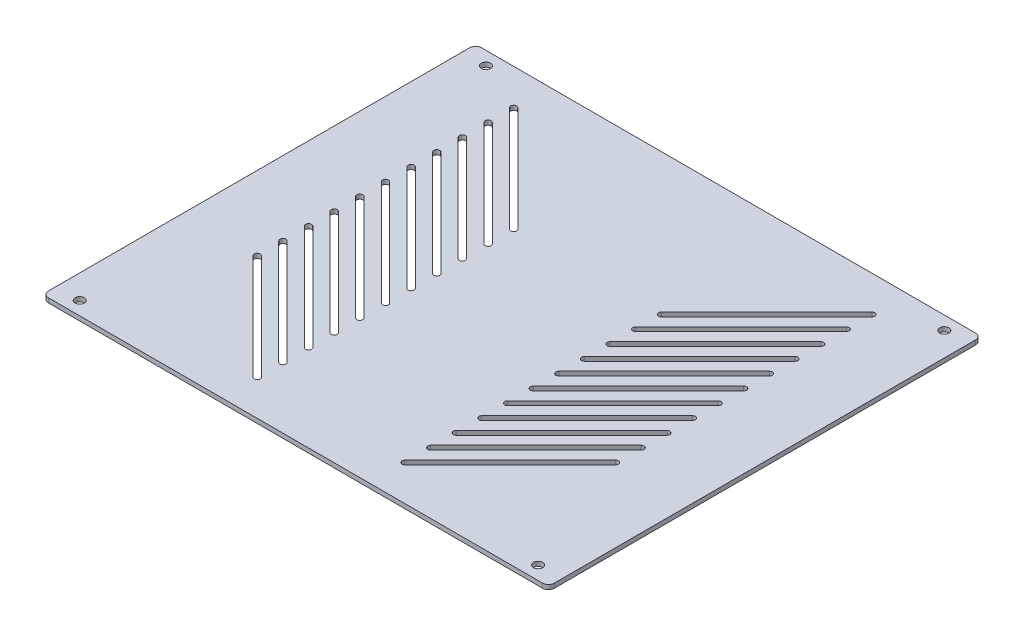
ISO-10303-21;
HEADER;
FILE_DESCRIPTION(('STEP AP214'),'2;1');
FILE_NAME('part.step','',(''),(''),'','','');
FILE_SCHEMA(('AUTOMOTIVE_DESIGN { 1 0 10303 214 1 1 1 1 }'));
ENDSEC;
DATA;
#1=APPLICATION_CONTEXT('core data for automotive mechanical design processes');
#2=APPLICATION_PROTOCOL_DEFINITION('international standard','automotive_design',2000,#1);
#3=PRODUCT_CONTEXT('',#1,'mechanical');
#4=PRODUCT('Part','Part','',(#3));
#5=PRODUCT_RELATED_PRODUCT_CATEGORY('part','',(#4));
#6=PRODUCT_DEFINITION_FORMATION('','',#4);
#7=PRODUCT_DEFINITION_CONTEXT('part definition',#1,'design');
#8=PRODUCT_DEFINITION('design','',#6,#7);
#9=PRODUCT_DEFINITION_SHAPE('','',#8);
#10=(LENGTH_UNIT() NAMED_UNIT(*) SI_UNIT(.MILLI.,.METRE.));
#11=(NAMED_UNIT(*) PLANE_ANGLE_UNIT() SI_UNIT($,.RADIAN.));
#12=(NAMED_UNIT(*) SI_UNIT($,.STERADIAN.) SOLID_ANGLE_UNIT());
#13=UNCERTAINTY_MEASURE_WITH_UNIT(LENGTH_MEASURE(1.E-05),#10,'distance_accuracy_value','');
#14=(GEOMETRIC_REPRESENTATION_CONTEXT(3) GLOBAL_UNCERTAINTY_ASSIGNED_CONTEXT((#13)) GLOBAL_UNIT_ASSIGNED_CONTEXT((#10,
#11,#12)) REPRESENTATION_CONTEXT('',''));
#15=CARTESIAN_POINT('',(0.,0.,0.));
#16=DIRECTION('',(0.,0.,1.));
#17=DIRECTION('',(1.,0.,0.));
#18=AXIS2_PLACEMENT_3D('',#15,#16,#17);
#19=CARTESIAN_POINT('',(-85.,-1.5,72.75));
#20=DIRECTION('',(-1.,0.,0.));
#21=DIRECTION('',(0.,0.,1.));
#22=AXIS2_PLACEMENT_3D('',#19,#20,#21);
#23=PLANE('',#22);
#24=DIRECTION('',(0.,0.,1.));
#25=VECTOR('',#24,1.);
#26=CARTESIAN_POINT('',(-85.,0.,72.75));
#27=LINE('',#26,#25);
#28=CARTESIAN_POINT('',(-85.,0.,-70.75));
#29=VERTEX_POINT('',#28);
#30=CARTESIAN_POINT('',(-85.,0.,70.75));
#31=VERTEX_POINT('',#30);
#32=EDGE_CURVE('E1635',#29,#31,#27,.T.);
#33=ORIENTED_EDGE('',*,*,#32,.F.);
#34=DIRECTION('',(0.,1.,0.));
#35=VECTOR('',#34,1.);
#36=CARTESIAN_POINT('',(-85.,-1.5,-70.75));
#37=LINE('',#36,#35);
#38=CARTESIAN_POINT('',(-85.,-1.5,-70.75));
#39=VERTEX_POINT('',#38);
#40=EDGE_CURVE('E1693',#29,#39,#37,.F.);
#41=ORIENTED_EDGE('',*,*,#40,.T.);
#42=DIRECTION('',(0.,0.,1.));
#43=VECTOR('',#42,1.);
#44=CARTESIAN_POINT('',(-85.,-1.5,72.75));
#45=LINE('',#44,#43);
#46=CARTESIAN_POINT('',(-85.,-1.5,70.75));
#47=VERTEX_POINT('',#46);
#48=EDGE_CURVE('E1639',#39,#47,#45,.T.);
#49=ORIENTED_EDGE('',*,*,#48,.T.);
#50=DIRECTION('',(0.,1.,0.));
#51=VECTOR('',#50,1.);
#52=CARTESIAN_POINT('',(-85.,-1.5,70.75));
#53=LINE('',#52,#51);
#54=EDGE_CURVE('E1689',#47,#31,#53,.T.);
#55=ORIENTED_EDGE('',*,*,#54,.T.);
#56=EDGE_LOOP('',(#33,#41,#49,#55));
#57=FACE_BOUND('',#56,.T.);
#58=ADVANCED_FACE('F46',(#57),#23,.T.);
#59=CARTESIAN_POINT('',(85.,-1.5,-72.7500000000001));
#60=DIRECTION('',(0.,0.,-1.));
#61=DIRECTION('',(-1.,0.,0.));
#62=AXIS2_PLACEMENT_3D('',#59,#60,#61);
#63=PLANE('',#62);
#64=DIRECTION('',(-1.,0.,0.));
#65=VECTOR('',#64,1.);
#66=CARTESIAN_POINT('',(85.,-1.5,-72.7500000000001));
#67=LINE('',#66,#65);
#68=CARTESIAN_POINT('',(83.,-1.5,-72.7500000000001));
#69=VERTEX_POINT('',#68);
#70=CARTESIAN_POINT('',(-83.,-1.5,-72.75));
#71=VERTEX_POINT('',#70);
#72=EDGE_CURVE('E1652',#69,#71,#67,.T.);
#73=ORIENTED_EDGE('',*,*,#72,.T.);
#74=DIRECTION('',(0.,1.,0.));
#75=VECTOR('',#74,1.);
#76=CARTESIAN_POINT('',(-83.,-1.5,-72.75));
#77=LINE('',#76,#75);
#78=CARTESIAN_POINT('',(-83.,0.,-72.75));
#79=VERTEX_POINT('',#78);
#80=EDGE_CURVE('E1673',#71,#79,#77,.T.);
#81=ORIENTED_EDGE('',*,*,#80,.T.);
#82=DIRECTION('',(-1.,0.,0.));
#83=VECTOR('',#82,1.);
#84=CARTESIAN_POINT('',(85.,0.,-72.7500000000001));
#85=LINE('',#84,#83);
#86=CARTESIAN_POINT('',(83.,0.,-72.7500000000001));
#87=VERTEX_POINT('',#86);
#88=EDGE_CURVE('E1644',#87,#79,#85,.T.);
#89=ORIENTED_EDGE('',*,*,#88,.F.);
#90=DIRECTION('',(0.,1.,0.));
#91=VECTOR('',#90,1.);
#92=CARTESIAN_POINT('',(83.,-1.5,-72.7500000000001));
#93=LINE('',#92,#91);
#94=EDGE_CURVE('E1656',#87,#69,#93,.F.);
#95=ORIENTED_EDGE('',*,*,#94,.T.);
#96=EDGE_LOOP('',(#73,#81,#89,#95));
#97=FACE_BOUND('',#96,.T.);
#98=ADVANCED_FACE('F1743',(#97),#63,.T.);
#99=CARTESIAN_POINT('',(85.,-1.5,72.7499999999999));
#100=DIRECTION('',(1.,0.,0.));
#101=DIRECTION('',(0.,0.,-1.));
#102=AXIS2_PLACEMENT_3D('',#99,#100,#101);
#103=PLANE('',#102);
#104=DIRECTION('',(0.,0.,-1.));
#105=VECTOR('',#104,1.);
#106=CARTESIAN_POINT('',(85.,-1.5,72.7499999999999));
#107=LINE('',#106,#105);
#108=CARTESIAN_POINT('',(85.,-1.5,70.7499999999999));
#109=VERTEX_POINT('',#108);
#110=CARTESIAN_POINT('',(85.,-1.5,-70.75));
#111=VERTEX_POINT('',#110);
#112=EDGE_CURVE('E1648',#109,#111,#107,.T.);
#113=ORIENTED_EDGE('',*,*,#112,.T.);
#114=DIRECTION('',(0.,1.,0.));
#115=VECTOR('',#114,1.);
#116=CARTESIAN_POINT('',(85.,-1.5,-70.75));
#117=LINE('',#116,#115);
#118=CARTESIAN_POINT('',(85.,0.,-70.75));
#119=VERTEX_POINT('',#118);
#120=EDGE_CURVE('E1711',#111,#119,#117,.T.);
#121=ORIENTED_EDGE('',*,*,#120,.T.);
#122=DIRECTION('',(0.,0.,-1.));
#123=VECTOR('',#122,1.);
#124=CARTESIAN_POINT('',(85.,0.,72.7499999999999));
#125=LINE('',#124,#123);
#126=CARTESIAN_POINT('',(85.,0.,70.7499999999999));
#127=VERTEX_POINT('',#126);
#128=EDGE_CURVE('E1664',#127,#119,#125,.T.);
#129=ORIENTED_EDGE('',*,*,#128,.F.);
#130=DIRECTION('',(0.,1.,0.));
#131=VECTOR('',#130,1.);
#132=CARTESIAN_POINT('',(85.,-1.5,70.7499999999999));
#133=LINE('',#132,#131);
#134=EDGE_CURVE('E1708',#127,#109,#133,.F.);
#135=ORIENTED_EDGE('',*,*,#134,.T.);
#136=EDGE_LOOP('',(#113,#121,#129,#135));
#137=FACE_BOUND('',#136,.T.);
#138=ADVANCED_FACE('F1750',(#137),#103,.T.);
#139=CARTESIAN_POINT('',(85.,-1.5,72.7499999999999));
#140=DIRECTION('',(0.,0.,1.));
#141=DIRECTION('',(1.,0.,0.));
#142=AXIS2_PLACEMENT_3D('',#139,#140,#141);
#143=PLANE('',#142);
#144=DIRECTION('',(1.,0.,0.));
#145=VECTOR('',#144,1.);
#146=CARTESIAN_POINT('',(85.,0.,72.7499999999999));
#147=LINE('',#146,#145);
#148=CARTESIAN_POINT('',(-83.,0.,72.75));
#149=VERTEX_POINT('',#148);
#150=CARTESIAN_POINT('',(83.,0.,72.7499999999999));
#151=VERTEX_POINT('',#150);
#152=EDGE_CURVE('E1660',#149,#151,#147,.T.);
#153=ORIENTED_EDGE('',*,*,#152,.F.);
#154=DIRECTION('',(0.,1.,0.));
#155=VECTOR('',#154,1.);
#156=CARTESIAN_POINT('',(-83.,-1.5,72.75));
#157=LINE('',#156,#155);
#158=CARTESIAN_POINT('',(-83.,-1.5,72.75));
#159=VERTEX_POINT('',#158);
#160=EDGE_CURVE('E11',#149,#159,#157,.F.);
#161=ORIENTED_EDGE('',*,*,#160,.T.);
#162=DIRECTION('',(1.,0.,0.));
#163=VECTOR('',#162,1.);
#164=CARTESIAN_POINT('',(85.,-1.5,72.7499999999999));
#165=LINE('',#164,#163);
#166=CARTESIAN_POINT('',(83.,-1.5,72.7499999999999));
#167=VERTEX_POINT('',#166);
#168=EDGE_CURVE('E1643',#159,#167,#165,.T.);
#169=ORIENTED_EDGE('',*,*,#168,.T.);
#170=DIRECTION('',(0.,1.,0.));
#171=VECTOR('',#170,1.);
#172=CARTESIAN_POINT('',(83.,-1.5,72.7499999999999));
#173=LINE('',#172,#171);
#174=EDGE_CURVE('E55',#167,#151,#173,.T.);
#175=ORIENTED_EDGE('',*,*,#174,.T.);
#176=EDGE_LOOP('',(#153,#161,#169,#175));
#177=FACE_BOUND('',#176,.T.);
#178=ADVANCED_FACE('F1719',(#177),#143,.T.);
#179=CARTESIAN_POINT('',(0.,-1.5,0.));
#180=DIRECTION('',(0.,1.,0.));
#181=DIRECTION('',(0.,0.,1.));
#182=AXIS2_PLACEMENT_3D('',#179,#180,#181);
#183=PLANE('',#182);
#184=DIRECTION('',(-0.707106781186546,0.,0.707106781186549));
#185=VECTOR('',#184,1.);
#186=CARTESIAN_POINT('',(24.1152236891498,-1.5,-26.1017677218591));
#187=LINE('',#186,#185);
#188=CARTESIAN_POINT('',(59.4705627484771,-1.5,-61.4571067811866));
#189=VERTEX_POINT('',#188);
#190=CARTESIAN_POINT('',(24.1152236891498,-1.5,-26.1017677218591));
#191=VERTEX_POINT('',#190);
#192=EDGE_CURVE('E1043',#189,#191,#187,.T.);
#193=ORIENTED_EDGE('',*,*,#192,.T.);
#194=CARTESIAN_POINT('',(24.8223304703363,-1.5,-25.3946609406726));
#195=DIRECTION('',(0.,1.,0.));
#196=DIRECTION('',(0.,0.,-1.));
#197=AXIS2_PLACEMENT_3D('',#194,#195,#196);
#198=CIRCLE('',#197,0.999999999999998);
#199=CARTESIAN_POINT('',(25.5294372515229,-1.5,-24.6875541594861));
#200=VERTEX_POINT('',#199);
#201=EDGE_CURVE('E1059',#191,#200,#198,.T.);
#202=ORIENTED_EDGE('',*,*,#201,.T.);
#203=DIRECTION('',(0.707106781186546,0.,-0.707106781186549));
#204=VECTOR('',#203,1.);
#205=CARTESIAN_POINT('',(25.5294372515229,-1.5,-24.6875541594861));
#206=LINE('',#205,#204);
#207=CARTESIAN_POINT('',(60.8847763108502,-1.5,-60.0428932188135));
#208=VERTEX_POINT('',#207);
#209=EDGE_CURVE('E1076',#200,#208,#206,.T.);
#210=ORIENTED_EDGE('',*,*,#209,.T.);
#211=CARTESIAN_POINT('',(60.1776695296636,-1.5,-60.75));
#212=DIRECTION('',(0.,1.,0.));
#213=DIRECTION('',(0.,0.,1.));
#214=AXIS2_PLACEMENT_3D('',#211,#212,#213);
#215=CIRCLE('',#214,0.999999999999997);
#216=EDGE_CURVE('E62',#208,#189,#215,.T.);
#217=ORIENTED_EDGE('',*,*,#216,.T.);
#218=EDGE_LOOP('',(#193,#202,#210,#217));
#219=FACE_BOUND('',#218,.T.);
#220=DIRECTION('',(-0.707106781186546,0.,0.707106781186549));
#221=VECTOR('',#220,1.);
#222=CARTESIAN_POINT('',(24.1152236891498,-1.5,-17.4873016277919));
#223=LINE('',#222,#221);
#224=CARTESIAN_POINT('',(59.4705627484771,-1.5,-52.8426406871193));
#225=VERTEX_POINT('',#224);
#226=CARTESIAN_POINT('',(24.1152236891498,-1.5,-17.4873016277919));
#227=VERTEX_POINT('',#226);
#228=EDGE_CURVE('E1087',#225,#227,#223,.T.);
#229=ORIENTED_EDGE('',*,*,#228,.T.);
#230=CARTESIAN_POINT('',(24.8223304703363,-1.5,-16.7801948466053));
#231=DIRECTION('',(0.,1.,0.));
#232=DIRECTION('',(0.,0.,-1.));
#233=AXIS2_PLACEMENT_3D('',#230,#231,#232);
#234=CIRCLE('',#233,0.999999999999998);
#235=CARTESIAN_POINT('',(25.5294372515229,-1.5,-16.0730880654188));
#236=VERTEX_POINT('',#235);
#237=EDGE_CURVE('E1101',#227,#236,#234,.T.);
#238=ORIENTED_EDGE('',*,*,#237,.T.);
#239=DIRECTION('',(0.707106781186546,0.,-0.707106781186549));
#240=VECTOR('',#239,1.);
#241=CARTESIAN_POINT('',(25.5294372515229,-1.5,-16.0730880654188));
#242=LINE('',#241,#240);
#243=CARTESIAN_POINT('',(60.8847763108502,-1.5,-51.4284271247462));
#244=VERTEX_POINT('',#243);
#245=EDGE_CURVE('E1118',#236,#244,#242,.T.);
#246=ORIENTED_EDGE('',*,*,#245,.T.);
#247=CARTESIAN_POINT('',(60.1776695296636,-1.5,-52.1355339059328));
#248=DIRECTION('',(0.,1.,0.));
#249=DIRECTION('',(0.,0.,1.));
#250=AXIS2_PLACEMENT_3D('',#247,#248,#249);
#251=CIRCLE('',#250,0.999999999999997);
#252=EDGE_CURVE('E70',#244,#225,#251,.T.);
#253=ORIENTED_EDGE('',*,*,#252,.T.);
#254=EDGE_LOOP('',(#229,#238,#246,#253));
#255=FACE_BOUND('',#254,.T.);
#256=DIRECTION('',(-0.707106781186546,0.,-0.707106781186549));
#257=VECTOR('',#256,1.);
#258=CARTESIAN_POINT('',(-24.1152236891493,-1.5,-17.4873016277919));
#259=LINE('',#258,#257);
#260=CARTESIAN_POINT('',(-24.1152236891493,-1.5,-17.4873016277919));
#261=VERTEX_POINT('',#260);
#262=CARTESIAN_POINT('',(-59.4705627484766,-1.5,-52.8426406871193));
#263=VERTEX_POINT('',#262);
#264=EDGE_CURVE('E1129',#261,#263,#259,.T.);
#265=ORIENTED_EDGE('',*,*,#264,.T.);
#266=CARTESIAN_POINT('',(-60.1776695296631,-1.5,-52.1355339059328));
#267=DIRECTION('',(0.,1.,0.));
#268=DIRECTION('',(0.,0.,-1.));
#269=AXIS2_PLACEMENT_3D('',#266,#267,#268);
#270=CIRCLE('',#269,0.999999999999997);
#271=CARTESIAN_POINT('',(-60.8847763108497,-1.5,-51.4284271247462));
#272=VERTEX_POINT('',#271);
#273=EDGE_CURVE('E1143',#263,#272,#270,.T.);
#274=ORIENTED_EDGE('',*,*,#273,.T.);
#275=DIRECTION('',(0.707106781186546,0.,0.707106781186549));
#276=VECTOR('',#275,1.);
#277=CARTESIAN_POINT('',(-25.5294372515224,-1.5,-16.0730880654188));
#278=LINE('',#277,#276);
#279=CARTESIAN_POINT('',(-25.5294372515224,-1.5,-16.0730880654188));
#280=VERTEX_POINT('',#279);
#281=EDGE_CURVE('E1162',#272,#280,#278,.T.);
#282=ORIENTED_EDGE('',*,*,#281,.T.);
#283=CARTESIAN_POINT('',(-24.8223304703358,-1.5,-16.7801948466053));
#284=DIRECTION('',(0.,1.,0.));
#285=DIRECTION('',(0.,0.,1.));
#286=AXIS2_PLACEMENT_3D('',#283,#284,#285);
#287=CIRCLE('',#286,0.999999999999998);
#288=EDGE_CURVE('E1158',#280,#261,#287,.T.);
#289=ORIENTED_EDGE('',*,*,#288,.T.);
#290=EDGE_LOOP('',(#265,#274,#282,#289));
#291=FACE_BOUND('',#290,.T.);
#292=DIRECTION('',(-0.707106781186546,0.,-0.707106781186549));
#293=VECTOR('',#292,1.);
#294=CARTESIAN_POINT('',(-24.1152236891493,-1.5,-26.1017677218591));
#295=LINE('',#294,#293);
#296=CARTESIAN_POINT('',(-24.1152236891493,-1.5,-26.1017677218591));
#297=VERTEX_POINT('',#296);
#298=CARTESIAN_POINT('',(-59.4705627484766,-1.5,-61.4571067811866));
#299=VERTEX_POINT('',#298);
#300=EDGE_CURVE('E1173',#297,#299,#295,.T.);
#301=ORIENTED_EDGE('',*,*,#300,.T.);
#302=CARTESIAN_POINT('',(-60.1776695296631,-1.5,-60.75));
#303=DIRECTION('',(0.,1.,0.));
#304=DIRECTION('',(0.,0.,-1.));
#305=AXIS2_PLACEMENT_3D('',#302,#303,#304);
#306=CIRCLE('',#305,0.999999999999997);
#307=CARTESIAN_POINT('',(-60.8847763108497,-1.5,-60.0428932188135));
#308=VERTEX_POINT('',#307);
#309=EDGE_CURVE('E1187',#299,#308,#306,.T.);
#310=ORIENTED_EDGE('',*,*,#309,.T.);
#311=DIRECTION('',(0.707106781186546,0.,0.707106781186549));
#312=VECTOR('',#311,1.);
#313=CARTESIAN_POINT('',(-25.5294372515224,-1.5,-24.6875541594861));
#314=LINE('',#313,#312);
#315=CARTESIAN_POINT('',(-25.5294372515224,-1.5,-24.6875541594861));
#316=VERTEX_POINT('',#315);
#317=EDGE_CURVE('E1204',#308,#316,#314,.T.);
#318=ORIENTED_EDGE('',*,*,#317,.T.);
#319=CARTESIAN_POINT('',(-24.8223304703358,-1.5,-25.3946609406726));
#320=DIRECTION('',(0.,1.,0.));
#321=DIRECTION('',(0.,0.,1.));
#322=AXIS2_PLACEMENT_3D('',#319,#320,#321);
#323=CIRCLE('',#322,0.999999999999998);
#324=EDGE_CURVE('E1200',#316,#297,#323,.T.);
#325=ORIENTED_EDGE('',*,*,#324,.T.);
#326=EDGE_LOOP('',(#301,#310,#318,#325));
#327=FACE_BOUND('',#326,.T.);
#328=DIRECTION('',(-0.707106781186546,0.,-0.707106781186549));
#329=VECTOR('',#328,1.);
#330=CARTESIAN_POINT('',(-24.1152236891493,-1.5,8.35609665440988));
#331=LINE('',#330,#329);
#332=CARTESIAN_POINT('',(-24.1152236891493,-1.5,8.35609665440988));
#333=VERTEX_POINT('',#332);
#334=CARTESIAN_POINT('',(-59.4705627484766,-1.5,-26.9992424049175));
#335=VERTEX_POINT('',#334);
#336=EDGE_CURVE('E911',#333,#335,#331,.T.);
#337=ORIENTED_EDGE('',*,*,#336,.T.);
#338=CARTESIAN_POINT('',(-60.1776695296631,-1.5,-26.292135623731));
#339=DIRECTION('',(0.,1.,0.));
#340=DIRECTION('',(0.,0.,-1.));
#341=AXIS2_PLACEMENT_3D('',#338,#339,#340);
#342=CIRCLE('',#341,0.999999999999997);
#343=CARTESIAN_POINT('',(-60.8847763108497,-1.5,-25.5850288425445));
#344=VERTEX_POINT('',#343);
#345=EDGE_CURVE('E925',#335,#344,#342,.T.);
#346=ORIENTED_EDGE('',*,*,#345,.T.);
#347=DIRECTION('',(0.707106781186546,0.,0.707106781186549));
#348=VECTOR('',#347,1.);
#349=CARTESIAN_POINT('',(-25.5294372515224,-1.5,9.77031021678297));
#350=LINE('',#349,#348);
#351=CARTESIAN_POINT('',(-25.5294372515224,-1.5,9.77031021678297));
#352=VERTEX_POINT('',#351);
#353=EDGE_CURVE('E944',#344,#352,#350,.T.);
#354=ORIENTED_EDGE('',*,*,#353,.T.);
#355=CARTESIAN_POINT('',(-24.8223304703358,-1.5,9.06320343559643));
#356=DIRECTION('',(0.,1.,0.));
#357=DIRECTION('',(0.,0.,1.));
#358=AXIS2_PLACEMENT_3D('',#355,#356,#357);
#359=CIRCLE('',#358,0.999999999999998);
#360=EDGE_CURVE('E940',#352,#333,#359,.T.);
#361=ORIENTED_EDGE('',*,*,#360,.T.);
#362=EDGE_LOOP('',(#337,#346,#354,#361));
#363=FACE_BOUND('',#362,.T.);
#364=DIRECTION('',(-0.707106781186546,0.,-0.707106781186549));
#365=VECTOR('',#364,1.);
#366=CARTESIAN_POINT('',(-24.1152236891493,-1.5,16.9705627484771));
#367=LINE('',#366,#365);
#368=CARTESIAN_POINT('',(-24.1152236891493,-1.5,16.9705627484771));
#369=VERTEX_POINT('',#368);
#370=CARTESIAN_POINT('',(-59.4705627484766,-1.5,-18.3847763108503));
#371=VERTEX_POINT('',#370);
#372=EDGE_CURVE('E867',#369,#371,#367,.T.);
#373=ORIENTED_EDGE('',*,*,#372,.T.);
#374=CARTESIAN_POINT('',(-60.1776695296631,-1.5,-17.6776695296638));
#375=DIRECTION('',(0.,1.,0.));
#376=DIRECTION('',(0.,0.,-1.));
#377=AXIS2_PLACEMENT_3D('',#374,#375,#376);
#378=CIRCLE('',#377,0.999999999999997);
#379=CARTESIAN_POINT('',(-60.8847763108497,-1.5,-16.9705627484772));
#380=VERTEX_POINT('',#379);
#381=EDGE_CURVE('E881',#371,#380,#378,.T.);
#382=ORIENTED_EDGE('',*,*,#381,.T.);
#383=DIRECTION('',(0.707106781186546,0.,0.707106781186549));
#384=VECTOR('',#383,1.);
#385=CARTESIAN_POINT('',(-25.5294372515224,-1.5,18.3847763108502));
#386=LINE('',#385,#384);
#387=CARTESIAN_POINT('',(-25.5294372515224,-1.5,18.3847763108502));
#388=VERTEX_POINT('',#387);
#389=EDGE_CURVE('E900',#380,#388,#386,.T.);
#390=ORIENTED_EDGE('',*,*,#389,.T.);
#391=CARTESIAN_POINT('',(-24.8223304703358,-1.5,17.6776695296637));
#392=DIRECTION('',(0.,1.,0.));
#393=DIRECTION('',(0.,0.,1.));
#394=AXIS2_PLACEMENT_3D('',#391,#392,#393);
#395=CIRCLE('',#394,0.999999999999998);
#396=EDGE_CURVE('E896',#388,#369,#395,.T.);
#397=ORIENTED_EDGE('',*,*,#396,.T.);
#398=EDGE_LOOP('',(#373,#382,#390,#397));
#399=FACE_BOUND('',#398,.T.);
#400=DIRECTION('',(-0.707106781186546,0.,-0.707106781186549));
#401=VECTOR('',#400,1.);
#402=CARTESIAN_POINT('',(-24.1152236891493,-1.5,-8.87283553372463));
#403=LINE('',#402,#401);
#404=CARTESIAN_POINT('',(-24.1152236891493,-1.5,-8.87283553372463));
#405=VERTEX_POINT('',#404);
#406=CARTESIAN_POINT('',(-59.4705627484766,-1.5,-44.2281745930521));
#407=VERTEX_POINT('',#406);
#408=EDGE_CURVE('E999',#405,#407,#403,.T.);
#409=ORIENTED_EDGE('',*,*,#408,.T.);
#410=CARTESIAN_POINT('',(-60.1776695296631,-1.5,-43.5210678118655));
#411=DIRECTION('',(0.,1.,0.));
#412=DIRECTION('',(0.,0.,-1.));
#413=AXIS2_PLACEMENT_3D('',#410,#411,#412);
#414=CIRCLE('',#413,0.999999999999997);
#415=CARTESIAN_POINT('',(-60.8847763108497,-1.5,-42.813961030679));
#416=VERTEX_POINT('',#415);
#417=EDGE_CURVE('E1013',#407,#416,#414,.T.);
#418=ORIENTED_EDGE('',*,*,#417,.T.);
#419=DIRECTION('',(0.707106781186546,0.,0.707106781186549));
#420=VECTOR('',#419,1.);
#421=CARTESIAN_POINT('',(-25.5294372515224,-1.5,-7.45862197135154));
#422=LINE('',#421,#420);
#423=CARTESIAN_POINT('',(-25.5294372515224,-1.5,-7.45862197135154));
#424=VERTEX_POINT('',#423);
#425=EDGE_CURVE('E1032',#416,#424,#422,.T.);
#426=ORIENTED_EDGE('',*,*,#425,.T.);
#427=CARTESIAN_POINT('',(-24.8223304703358,-1.5,-8.16572875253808));
#428=DIRECTION('',(0.,1.,0.));
#429=DIRECTION('',(0.,0.,1.));
#430=AXIS2_PLACEMENT_3D('',#427,#428,#429);
#431=CIRCLE('',#430,0.999999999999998);
#432=EDGE_CURVE('E1028',#424,#405,#431,.T.);
#433=ORIENTED_EDGE('',*,*,#432,.T.);
#434=EDGE_LOOP('',(#409,#418,#426,#433));
#435=FACE_BOUND('',#434,.T.);
#436=DIRECTION('',(-0.707106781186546,0.,-0.707106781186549));
#437=VECTOR('',#436,1.);
#438=CARTESIAN_POINT('',(-24.1152236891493,-1.5,-0.258369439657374));
#439=LINE('',#438,#437);
#440=CARTESIAN_POINT('',(-24.1152236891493,-1.5,-0.258369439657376));
#441=VERTEX_POINT('',#440);
#442=CARTESIAN_POINT('',(-59.4705627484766,-1.5,-35.6137084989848));
#443=VERTEX_POINT('',#442);
#444=EDGE_CURVE('E955',#441,#443,#439,.T.);
#445=ORIENTED_EDGE('',*,*,#444,.T.);
#446=CARTESIAN_POINT('',(-60.1776695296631,-1.5,-34.9066017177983));
#447=DIRECTION('',(0.,1.,0.));
#448=DIRECTION('',(0.,0.,-1.));
#449=AXIS2_PLACEMENT_3D('',#446,#447,#448);
#450=CIRCLE('',#449,0.999999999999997);
#451=CARTESIAN_POINT('',(-60.8847763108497,-1.5,-34.1994949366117));
#452=VERTEX_POINT('',#451);
#453=EDGE_CURVE('E969',#443,#452,#450,.T.);
#454=ORIENTED_EDGE('',*,*,#453,.T.);
#455=DIRECTION('',(0.707106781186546,0.,0.707106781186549));
#456=VECTOR('',#455,1.);
#457=CARTESIAN_POINT('',(-25.5294372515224,-1.5,1.15584412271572));
#458=LINE('',#457,#456);
#459=CARTESIAN_POINT('',(-25.5294372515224,-1.5,1.15584412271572));
#460=VERTEX_POINT('',#459);
#461=EDGE_CURVE('E988',#452,#460,#458,.T.);
#462=ORIENTED_EDGE('',*,*,#461,.T.);
#463=CARTESIAN_POINT('',(-24.8223304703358,-1.5,0.448737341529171));
#464=DIRECTION('',(0.,1.,0.));
#465=DIRECTION('',(0.,0.,1.));
#466=AXIS2_PLACEMENT_3D('',#463,#464,#465);
#467=CIRCLE('',#466,0.999999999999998);
#468=EDGE_CURVE('E984',#460,#441,#467,.T.);
#469=ORIENTED_EDGE('',*,*,#468,.T.);
#470=EDGE_LOOP('',(#445,#454,#462,#469));
#471=FACE_BOUND('',#470,.T.);
#472=DIRECTION('',(-0.707106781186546,0.,0.707106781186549));
#473=VECTOR('',#472,1.);
#474=CARTESIAN_POINT('',(24.1152236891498,-1.5,34.1994949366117));
#475=LINE('',#474,#473);
#476=CARTESIAN_POINT('',(59.4705627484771,-1.5,-1.15584412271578));
#477=VERTEX_POINT('',#476);
#478=CARTESIAN_POINT('',(24.1152236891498,-1.5,34.1994949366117));
#479=VERTEX_POINT('',#478);
#480=EDGE_CURVE('E1435',#477,#479,#475,.T.);
#481=ORIENTED_EDGE('',*,*,#480,.T.);
#482=CARTESIAN_POINT('',(24.8223304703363,-1.5,34.9066017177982));
#483=DIRECTION('',(0.,1.,0.));
#484=DIRECTION('',(0.,0.,-1.));
#485=AXIS2_PLACEMENT_3D('',#482,#483,#484);
#486=CIRCLE('',#485,0.999999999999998);
#487=CARTESIAN_POINT('',(25.5294372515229,-1.5,35.6137084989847));
#488=VERTEX_POINT('',#487);
#489=EDGE_CURVE('E1449',#479,#488,#486,.T.);
#490=ORIENTED_EDGE('',*,*,#489,.T.);
#491=DIRECTION('',(0.707106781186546,0.,-0.707106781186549));
#492=VECTOR('',#491,1.);
#493=CARTESIAN_POINT('',(25.5294372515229,-1.5,35.6137084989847));
#494=LINE('',#493,#492);
#495=CARTESIAN_POINT('',(60.8847763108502,-1.5,0.258369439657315));
#496=VERTEX_POINT('',#495);
#497=EDGE_CURVE('E1468',#488,#496,#494,.T.);
#498=ORIENTED_EDGE('',*,*,#497,.T.);
#499=CARTESIAN_POINT('',(60.1776695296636,-1.5,-0.448737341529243));
#500=DIRECTION('',(0.,1.,0.));
#501=DIRECTION('',(0.,0.,1.));
#502=AXIS2_PLACEMENT_3D('',#499,#500,#501);
#503=CIRCLE('',#502,0.999999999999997);
#504=EDGE_CURVE('E1464',#496,#477,#503,.T.);
#505=ORIENTED_EDGE('',*,*,#504,.T.);
#506=EDGE_LOOP('',(#481,#490,#498,#505));
#507=FACE_BOUND('',#506,.T.);
#508=DIRECTION('',(-0.707106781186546,0.,0.707106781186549));
#509=VECTOR('',#508,1.);
#510=CARTESIAN_POINT('',(24.1152236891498,-1.5,25.5850288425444));
#511=LINE('',#510,#509);
#512=CARTESIAN_POINT('',(59.4705627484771,-1.5,-9.77031021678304));
#513=VERTEX_POINT('',#512);
#514=CARTESIAN_POINT('',(24.1152236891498,-1.5,25.5850288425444));
#515=VERTEX_POINT('',#514);
#516=EDGE_CURVE('E1391',#513,#515,#511,.T.);
#517=ORIENTED_EDGE('',*,*,#516,.T.);
#518=CARTESIAN_POINT('',(24.8223304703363,-1.5,26.2921356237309));
#519=DIRECTION('',(0.,1.,0.));
#520=DIRECTION('',(0.,0.,-1.));
#521=AXIS2_PLACEMENT_3D('',#518,#519,#520);
#522=CIRCLE('',#521,0.999999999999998);
#523=CARTESIAN_POINT('',(25.5294372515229,-1.5,26.9992424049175));
#524=VERTEX_POINT('',#523);
#525=EDGE_CURVE('E1405',#515,#524,#522,.T.);
#526=ORIENTED_EDGE('',*,*,#525,.T.);
#527=DIRECTION('',(0.707106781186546,0.,-0.707106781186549));
#528=VECTOR('',#527,1.);
#529=CARTESIAN_POINT('',(25.5294372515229,-1.5,26.9992424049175));
#530=LINE('',#529,#528);
#531=CARTESIAN_POINT('',(60.8847763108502,-1.5,-8.35609665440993));
#532=VERTEX_POINT('',#531);
#533=EDGE_CURVE('E1424',#524,#532,#530,.T.);
#534=ORIENTED_EDGE('',*,*,#533,.T.);
#535=CARTESIAN_POINT('',(60.1776695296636,-1.5,-9.0632034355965));
#536=DIRECTION('',(0.,1.,0.));
#537=DIRECTION('',(0.,0.,1.));
#538=AXIS2_PLACEMENT_3D('',#535,#536,#537);
#539=CIRCLE('',#538,0.999999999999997);
#540=EDGE_CURVE('E1420',#532,#513,#539,.T.);
#541=ORIENTED_EDGE('',*,*,#540,.T.);
#542=EDGE_LOOP('',(#517,#526,#534,#541));
#543=FACE_BOUND('',#542,.T.);
#544=DIRECTION('',(-0.707106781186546,0.,0.707106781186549));
#545=VECTOR('',#544,1.);
#546=CARTESIAN_POINT('',(24.1152236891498,-1.5,51.4284271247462));
#547=LINE('',#546,#545);
#548=CARTESIAN_POINT('',(59.4705627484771,-1.5,16.0730880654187));
#549=VERTEX_POINT('',#548);
#550=CARTESIAN_POINT('',(24.1152236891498,-1.5,51.4284271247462));
#551=VERTEX_POINT('',#550);
#552=EDGE_CURVE('E1523',#549,#551,#547,.T.);
#553=ORIENTED_EDGE('',*,*,#552,.T.);
#554=CARTESIAN_POINT('',(24.8223304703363,-1.5,52.1355339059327));
#555=DIRECTION('',(0.,1.,0.));
#556=DIRECTION('',(0.,0.,-1.));
#557=AXIS2_PLACEMENT_3D('',#554,#555,#556);
#558=CIRCLE('',#557,0.999999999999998);
#559=CARTESIAN_POINT('',(25.5294372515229,-1.5,52.8426406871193));
#560=VERTEX_POINT('',#559);
#561=EDGE_CURVE('E1537',#551,#560,#558,.T.);
#562=ORIENTED_EDGE('',*,*,#561,.T.);
#563=DIRECTION('',(0.707106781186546,0.,-0.707106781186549));
#564=VECTOR('',#563,1.);
#565=CARTESIAN_POINT('',(25.5294372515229,-1.5,52.8426406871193));
#566=LINE('',#565,#564);
#567=CARTESIAN_POINT('',(60.8847763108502,-1.5,17.4873016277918));
#568=VERTEX_POINT('',#567);
#569=EDGE_CURVE('E1556',#560,#568,#566,.T.);
#570=ORIENTED_EDGE('',*,*,#569,.T.);
#571=CARTESIAN_POINT('',(60.1776695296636,-1.5,16.7801948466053));
#572=DIRECTION('',(0.,1.,0.));
#573=DIRECTION('',(0.,0.,1.));
#574=AXIS2_PLACEMENT_3D('',#571,#572,#573);
#575=CIRCLE('',#574,0.999999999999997);
#576=EDGE_CURVE('E1552',#568,#549,#575,.T.);
#577=ORIENTED_EDGE('',*,*,#576,.T.);
#578=EDGE_LOOP('',(#553,#562,#570,#577));
#579=FACE_BOUND('',#578,.T.);
#580=DIRECTION('',(-0.707106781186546,0.,0.707106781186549));
#581=VECTOR('',#580,1.);
#582=CARTESIAN_POINT('',(24.1152236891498,-1.5,42.8139610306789));
#583=LINE('',#582,#581);
#584=CARTESIAN_POINT('',(59.4705627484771,-1.5,7.45862197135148));
#585=VERTEX_POINT('',#584);
#586=CARTESIAN_POINT('',(24.1152236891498,-1.5,42.8139610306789));
#587=VERTEX_POINT('',#586);
#588=EDGE_CURVE('E1479',#585,#587,#583,.T.);
#589=ORIENTED_EDGE('',*,*,#588,.T.);
#590=CARTESIAN_POINT('',(24.8223304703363,-1.5,43.5210678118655));
#591=DIRECTION('',(0.,1.,0.));
#592=DIRECTION('',(0.,0.,-1.));
#593=AXIS2_PLACEMENT_3D('',#590,#591,#592);
#594=CIRCLE('',#593,0.999999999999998);
#595=CARTESIAN_POINT('',(25.5294372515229,-1.5,44.228174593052));
#596=VERTEX_POINT('',#595);
#597=EDGE_CURVE('E1493',#587,#596,#594,.T.);
#598=ORIENTED_EDGE('',*,*,#597,.T.);
#599=DIRECTION('',(0.707106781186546,0.,-0.707106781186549));
#600=VECTOR('',#599,1.);
#601=CARTESIAN_POINT('',(25.5294372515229,-1.5,44.228174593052));
#602=LINE('',#601,#600);
#603=CARTESIAN_POINT('',(60.8847763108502,-1.5,8.87283553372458));
#604=VERTEX_POINT('',#603);
#605=EDGE_CURVE('E1512',#596,#604,#602,.T.);
#606=ORIENTED_EDGE('',*,*,#605,.T.);
#607=CARTESIAN_POINT('',(60.1776695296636,-1.5,8.16572875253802));
#608=DIRECTION('',(0.,1.,0.));
#609=DIRECTION('',(0.,0.,1.));
#610=AXIS2_PLACEMENT_3D('',#607,#608,#609);
#611=CIRCLE('',#610,0.999999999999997);
#612=EDGE_CURVE('E1508',#604,#585,#611,.T.);
#613=ORIENTED_EDGE('',*,*,#612,.T.);
#614=EDGE_LOOP('',(#589,#598,#606,#613));
#615=FACE_BOUND('',#614,.T.);
#616=DIRECTION('',(-0.707106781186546,0.,0.707106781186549));
#617=VECTOR('',#616,1.);
#618=CARTESIAN_POINT('',(24.1152236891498,-1.5,-0.258369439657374));
#619=LINE('',#618,#617);
#620=CARTESIAN_POINT('',(59.4705627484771,-1.5,-35.6137084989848));
#621=VERTEX_POINT('',#620);
#622=CARTESIAN_POINT('',(24.1152236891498,-1.5,-0.258369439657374));
#623=VERTEX_POINT('',#622);
#624=EDGE_CURVE('E1259',#621,#623,#619,.T.);
#625=ORIENTED_EDGE('',*,*,#624,.T.);
#626=CARTESIAN_POINT('',(24.8223304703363,-1.5,0.448737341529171));
#627=DIRECTION('',(0.,1.,0.));
#628=DIRECTION('',(0.,0.,-1.));
#629=AXIS2_PLACEMENT_3D('',#626,#627,#628);
#630=CIRCLE('',#629,0.999999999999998);
#631=CARTESIAN_POINT('',(25.5294372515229,-1.5,1.15584412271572));
#632=VERTEX_POINT('',#631);
#633=EDGE_CURVE('E1273',#623,#632,#630,.T.);
#634=ORIENTED_EDGE('',*,*,#633,.T.);
#635=DIRECTION('',(0.707106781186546,0.,-0.707106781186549));
#636=VECTOR('',#635,1.);
#637=CARTESIAN_POINT('',(25.5294372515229,-1.5,1.15584412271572));
#638=LINE('',#637,#636);
#639=CARTESIAN_POINT('',(60.8847763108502,-1.5,-34.1994949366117));
#640=VERTEX_POINT('',#639);
#641=EDGE_CURVE('E1292',#632,#640,#638,.T.);
#642=ORIENTED_EDGE('',*,*,#641,.T.);
#643=CARTESIAN_POINT('',(60.1776695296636,-1.5,-34.9066017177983));
#644=DIRECTION('',(0.,1.,0.));
#645=DIRECTION('',(0.,0.,1.));
#646=AXIS2_PLACEMENT_3D('',#643,#644,#645);
#647=CIRCLE('',#646,0.999999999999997);
#648=EDGE_CURVE('E1288',#640,#621,#647,.T.);
#649=ORIENTED_EDGE('',*,*,#648,.T.);
#650=EDGE_LOOP('',(#625,#634,#642,#649));
#651=FACE_BOUND('',#650,.T.);
#652=DIRECTION('',(-0.707106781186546,0.,0.707106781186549));
#653=VECTOR('',#652,1.);
#654=CARTESIAN_POINT('',(24.1152236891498,-1.5,-8.87283553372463));
#655=LINE('',#654,#653);
#656=CARTESIAN_POINT('',(59.4705627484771,-1.5,-44.2281745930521));
#657=VERTEX_POINT('',#656);
#658=CARTESIAN_POINT('',(24.1152236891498,-1.5,-8.87283553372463));
#659=VERTEX_POINT('',#658);
#660=EDGE_CURVE('E1215',#657,#659,#655,.T.);
#661=ORIENTED_EDGE('',*,*,#660,.T.);
#662=CARTESIAN_POINT('',(24.8223304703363,-1.5,-8.16572875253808));
#663=DIRECTION('',(0.,1.,0.));
#664=DIRECTION('',(0.,0.,-1.));
#665=AXIS2_PLACEMENT_3D('',#662,#663,#664);
#666=CIRCLE('',#665,0.999999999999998);
#667=CARTESIAN_POINT('',(25.5294372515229,-1.5,-7.45862197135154));
#668=VERTEX_POINT('',#667);
#669=EDGE_CURVE('E1229',#659,#668,#666,.T.);
#670=ORIENTED_EDGE('',*,*,#669,.T.);
#671=DIRECTION('',(0.707106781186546,0.,-0.707106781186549));
#672=VECTOR('',#671,1.);
#673=CARTESIAN_POINT('',(25.5294372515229,-1.5,-7.45862197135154));
#674=LINE('',#673,#672);
#675=CARTESIAN_POINT('',(60.8847763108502,-1.5,-42.813961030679));
#676=VERTEX_POINT('',#675);
#677=EDGE_CURVE('E1248',#668,#676,#674,.T.);
#678=ORIENTED_EDGE('',*,*,#677,.T.);
#679=CARTESIAN_POINT('',(60.1776695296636,-1.5,-43.5210678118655));
#680=DIRECTION('',(0.,1.,0.));
#681=DIRECTION('',(0.,0.,1.));
#682=AXIS2_PLACEMENT_3D('',#679,#680,#681);
#683=CIRCLE('',#682,0.999999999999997);
#684=EDGE_CURVE('E1244',#676,#657,#683,.T.);
#685=ORIENTED_EDGE('',*,*,#684,.T.);
#686=EDGE_LOOP('',(#661,#670,#678,#685));
#687=FACE_BOUND('',#686,.T.);
#688=DIRECTION('',(-0.707106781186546,0.,0.707106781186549));
#689=VECTOR('',#688,1.);
#690=CARTESIAN_POINT('',(24.1152236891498,-1.5,16.9705627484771));
#691=LINE('',#690,#689);
#692=CARTESIAN_POINT('',(59.4705627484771,-1.5,-18.3847763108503));
#693=VERTEX_POINT('',#692);
#694=CARTESIAN_POINT('',(24.1152236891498,-1.5,16.9705627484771));
#695=VERTEX_POINT('',#694);
#696=EDGE_CURVE('E1347',#693,#695,#691,.T.);
#697=ORIENTED_EDGE('',*,*,#696,.T.);
#698=CARTESIAN_POINT('',(24.8223304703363,-1.5,17.6776695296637));
#699=DIRECTION('',(0.,1.,0.));
#700=DIRECTION('',(0.,0.,-1.));
#701=AXIS2_PLACEMENT_3D('',#698,#699,#700);
#702=CIRCLE('',#701,0.999999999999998);
#703=CARTESIAN_POINT('',(25.5294372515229,-1.5,18.3847763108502));
#704=VERTEX_POINT('',#703);
#705=EDGE_CURVE('E1361',#695,#704,#702,.T.);
#706=ORIENTED_EDGE('',*,*,#705,.T.);
#707=DIRECTION('',(0.707106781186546,0.,-0.707106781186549));
#708=VECTOR('',#707,1.);
#709=CARTESIAN_POINT('',(25.5294372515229,-1.5,18.3847763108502));
#710=LINE('',#709,#708);
#711=CARTESIAN_POINT('',(60.8847763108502,-1.5,-16.9705627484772));
#712=VERTEX_POINT('',#711);
#713=EDGE_CURVE('E1380',#704,#712,#710,.T.);
#714=ORIENTED_EDGE('',*,*,#713,.T.);
#715=CARTESIAN_POINT('',(60.1776695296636,-1.5,-17.6776695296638));
#716=DIRECTION('',(0.,1.,0.));
#717=DIRECTION('',(0.,0.,1.));
#718=AXIS2_PLACEMENT_3D('',#715,#716,#717);
#719=CIRCLE('',#718,0.999999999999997);
#720=EDGE_CURVE('E1376',#712,#693,#719,.T.);
#721=ORIENTED_EDGE('',*,*,#720,.T.);
#722=EDGE_LOOP('',(#697,#706,#714,#721));
#723=FACE_BOUND('',#722,.T.);
#724=DIRECTION('',(-0.707106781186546,0.,0.707106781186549));
#725=VECTOR('',#724,1.);
#726=CARTESIAN_POINT('',(24.1152236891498,-1.5,8.35609665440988));
#727=LINE('',#726,#725);
#728=CARTESIAN_POINT('',(59.4705627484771,-1.5,-26.9992424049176));
#729=VERTEX_POINT('',#728);
#730=CARTESIAN_POINT('',(24.1152236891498,-1.5,8.35609665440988));
#731=VERTEX_POINT('',#730);
#732=EDGE_CURVE('E1303',#729,#731,#727,.T.);
#733=ORIENTED_EDGE('',*,*,#732,.T.);
#734=CARTESIAN_POINT('',(24.8223304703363,-1.5,9.06320343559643));
#735=DIRECTION('',(0.,1.,0.));
#736=DIRECTION('',(0.,0.,-1.));
#737=AXIS2_PLACEMENT_3D('',#734,#735,#736);
#738=CIRCLE('',#737,0.999999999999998);
#739=CARTESIAN_POINT('',(25.5294372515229,-1.5,9.77031021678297));
#740=VERTEX_POINT('',#739);
#741=EDGE_CURVE('E1317',#731,#740,#738,.T.);
#742=ORIENTED_EDGE('',*,*,#741,.T.);
#743=DIRECTION('',(0.707106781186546,0.,-0.707106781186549));
#744=VECTOR('',#743,1.);
#745=CARTESIAN_POINT('',(25.5294372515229,-1.5,9.77031021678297));
#746=LINE('',#745,#744);
#747=CARTESIAN_POINT('',(60.8847763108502,-1.5,-25.5850288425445));
#748=VERTEX_POINT('',#747);
#749=EDGE_CURVE('E1336',#740,#748,#746,.T.);
#750=ORIENTED_EDGE('',*,*,#749,.T.);
#751=CARTESIAN_POINT('',(60.1776695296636,-1.5,-26.292135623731));
#752=DIRECTION('',(0.,1.,0.));
#753=DIRECTION('',(0.,0.,1.));
#754=AXIS2_PLACEMENT_3D('',#751,#752,#753);
#755=CIRCLE('',#754,0.999999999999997);
#756=EDGE_CURVE('E1332',#748,#729,#755,.T.);
#757=ORIENTED_EDGE('',*,*,#756,.T.);
#758=EDGE_LOOP('',(#733,#742,#750,#757));
#759=FACE_BOUND('',#758,.T.);
#760=DIRECTION('',(0.707106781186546,0.,0.707106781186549));
#761=VECTOR('',#760,1.);
#762=CARTESIAN_POINT('',(-25.5294372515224,-1.5,61.4571067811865));
#763=LINE('',#762,#761);
#764=CARTESIAN_POINT('',(-60.8847763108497,-1.5,26.1017677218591));
#765=VERTEX_POINT('',#764);
#766=CARTESIAN_POINT('',(-25.5294372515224,-1.5,61.4571067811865));
#767=VERTEX_POINT('',#766);
#768=EDGE_CURVE('E676',#765,#767,#763,.T.);
#769=ORIENTED_EDGE('',*,*,#768,.T.);
#770=CARTESIAN_POINT('',(-24.8223304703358,-1.5,60.75));
#771=DIRECTION('',(0.,1.,0.));
#772=DIRECTION('',(0.,0.,1.));
#773=AXIS2_PLACEMENT_3D('',#770,#771,#772);
#774=CIRCLE('',#773,0.999999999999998);
#775=CARTESIAN_POINT('',(-24.1152236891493,-1.5,60.0428932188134));
#776=VERTEX_POINT('',#775);
#777=EDGE_CURVE('E645',#767,#776,#774,.T.);
#778=ORIENTED_EDGE('',*,*,#777,.T.);
#779=DIRECTION('',(-0.707106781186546,0.,-0.707106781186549));
#780=VECTOR('',#779,1.);
#781=CARTESIAN_POINT('',(-24.1152236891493,-1.5,60.0428932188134));
#782=LINE('',#781,#780);
#783=CARTESIAN_POINT('',(-59.4705627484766,-1.5,24.687554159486));
#784=VERTEX_POINT('',#783);
#785=EDGE_CURVE('E684',#776,#784,#782,.T.);
#786=ORIENTED_EDGE('',*,*,#785,.T.);
#787=CARTESIAN_POINT('',(-60.1776695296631,-1.5,25.3946609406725));
#788=DIRECTION('',(0.,1.,0.));
#789=DIRECTION('',(0.,0.,-1.));
#790=AXIS2_PLACEMENT_3D('',#787,#788,#789);
#791=CIRCLE('',#790,0.999999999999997);
#792=EDGE_CURVE('E679',#784,#765,#791,.T.);
#793=ORIENTED_EDGE('',*,*,#792,.T.);
#794=EDGE_LOOP('',(#769,#778,#786,#793));
#795=FACE_BOUND('',#794,.T.);
#796=DIRECTION('',(-0.707106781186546,0.,-0.707106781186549));
#797=VECTOR('',#796,1.);
#798=CARTESIAN_POINT('',(-24.1152236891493,-1.5,34.1994949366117));
#799=LINE('',#798,#797);
#800=CARTESIAN_POINT('',(-24.1152236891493,-1.5,34.1994949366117));
#801=VERTEX_POINT('',#800);
#802=CARTESIAN_POINT('',(-59.4705627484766,-1.5,-1.15584412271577));
#803=VERTEX_POINT('',#802);
#804=EDGE_CURVE('E779',#801,#803,#799,.T.);
#805=ORIENTED_EDGE('',*,*,#804,.T.);
#806=CARTESIAN_POINT('',(-60.1776695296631,-1.5,-0.448737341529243));
#807=DIRECTION('',(0.,1.,0.));
#808=DIRECTION('',(0.,0.,-1.));
#809=AXIS2_PLACEMENT_3D('',#806,#807,#808);
#810=CIRCLE('',#809,0.999999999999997);
#811=CARTESIAN_POINT('',(-60.8847763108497,-1.5,0.258369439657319));
#812=VERTEX_POINT('',#811);
#813=EDGE_CURVE('E793',#803,#812,#810,.T.);
#814=ORIENTED_EDGE('',*,*,#813,.T.);
#815=DIRECTION('',(0.707106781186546,0.,0.707106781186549));
#816=VECTOR('',#815,1.);
#817=CARTESIAN_POINT('',(-25.5294372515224,-1.5,35.6137084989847));
#818=LINE('',#817,#816);
#819=CARTESIAN_POINT('',(-25.5294372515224,-1.5,35.6137084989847));
#820=VERTEX_POINT('',#819);
#821=EDGE_CURVE('E812',#812,#820,#818,.T.);
#822=ORIENTED_EDGE('',*,*,#821,.T.);
#823=CARTESIAN_POINT('',(-24.8223304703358,-1.5,34.9066017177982));
#824=DIRECTION('',(0.,1.,0.));
#825=DIRECTION('',(0.,0.,1.));
#826=AXIS2_PLACEMENT_3D('',#823,#824,#825);
#827=CIRCLE('',#826,0.999999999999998);
#828=EDGE_CURVE('E808',#820,#801,#827,.T.);
#829=ORIENTED_EDGE('',*,*,#828,.T.);
#830=EDGE_LOOP('',(#805,#814,#822,#829));
#831=FACE_BOUND('',#830,.T.);
#832=DIRECTION('',(-0.707106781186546,0.,-0.707106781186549));
#833=VECTOR('',#832,1.);
#834=CARTESIAN_POINT('',(-24.1152236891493,-1.5,25.5850288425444));
#835=LINE('',#834,#833);
#836=CARTESIAN_POINT('',(-24.1152236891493,-1.5,25.5850288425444));
#837=VERTEX_POINT('',#836);
#838=CARTESIAN_POINT('',(-59.4705627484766,-1.5,-9.77031021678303));
#839=VERTEX_POINT('',#838);
#840=EDGE_CURVE('E823',#837,#839,#835,.T.);
#841=ORIENTED_EDGE('',*,*,#840,.T.);
#842=CARTESIAN_POINT('',(-60.1776695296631,-1.5,-9.0632034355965));
#843=DIRECTION('',(0.,1.,0.));
#844=DIRECTION('',(0.,0.,-1.));
#845=AXIS2_PLACEMENT_3D('',#842,#843,#844);
#846=CIRCLE('',#845,0.999999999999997);
#847=CARTESIAN_POINT('',(-60.8847763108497,-1.5,-8.35609665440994));
#848=VERTEX_POINT('',#847);
#849=EDGE_CURVE('E837',#839,#848,#846,.T.);
#850=ORIENTED_EDGE('',*,*,#849,.T.);
#851=DIRECTION('',(0.707106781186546,0.,0.707106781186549));
#852=VECTOR('',#851,1.);
#853=CARTESIAN_POINT('',(-25.5294372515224,-1.5,26.9992424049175));
#854=LINE('',#853,#852);
#855=CARTESIAN_POINT('',(-25.5294372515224,-1.5,26.9992424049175));
#856=VERTEX_POINT('',#855);
#857=EDGE_CURVE('E856',#848,#856,#854,.T.);
#858=ORIENTED_EDGE('',*,*,#857,.T.);
#859=CARTESIAN_POINT('',(-24.8223304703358,-1.5,26.2921356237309));
#860=DIRECTION('',(0.,1.,0.));
#861=DIRECTION('',(0.,0.,1.));
#862=AXIS2_PLACEMENT_3D('',#859,#860,#861);
#863=CIRCLE('',#862,0.999999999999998);
#864=EDGE_CURVE('E852',#856,#837,#863,.T.);
#865=ORIENTED_EDGE('',*,*,#864,.T.);
#866=EDGE_LOOP('',(#841,#850,#858,#865));
#867=FACE_BOUND('',#866,.T.);
#868=DIRECTION('',(-0.707106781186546,0.,-0.707106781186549));
#869=VECTOR('',#868,1.);
#870=CARTESIAN_POINT('',(-24.1152236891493,-1.5,51.4284271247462));
#871=LINE('',#870,#869);
#872=CARTESIAN_POINT('',(-24.1152236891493,-1.5,51.4284271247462));
#873=VERTEX_POINT('',#872);
#874=CARTESIAN_POINT('',(-59.4705627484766,-1.5,16.0730880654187));
#875=VERTEX_POINT('',#874);
#876=EDGE_CURVE('E694',#873,#875,#871,.T.);
#877=ORIENTED_EDGE('',*,*,#876,.T.);
#878=CARTESIAN_POINT('',(-60.1776695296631,-1.5,16.7801948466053));
#879=DIRECTION('',(0.,1.,0.));
#880=DIRECTION('',(0.,0.,-1.));
#881=AXIS2_PLACEMENT_3D('',#878,#879,#880);
#882=CIRCLE('',#881,0.999999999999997);
#883=CARTESIAN_POINT('',(-60.8847763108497,-1.5,17.4873016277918));
#884=VERTEX_POINT('',#883);
#885=EDGE_CURVE('E705',#875,#884,#882,.T.);
#886=ORIENTED_EDGE('',*,*,#885,.T.);
#887=DIRECTION('',(0.707106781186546,0.,0.707106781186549));
#888=VECTOR('',#887,1.);
#889=CARTESIAN_POINT('',(-25.5294372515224,-1.5,52.8426406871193));
#890=LINE('',#889,#888);
#891=CARTESIAN_POINT('',(-25.5294372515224,-1.5,52.8426406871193));
#892=VERTEX_POINT('',#891);
#893=EDGE_CURVE('E724',#884,#892,#890,.T.);
#894=ORIENTED_EDGE('',*,*,#893,.T.);
#895=CARTESIAN_POINT('',(-24.8223304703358,-1.5,52.1355339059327));
#896=DIRECTION('',(0.,1.,0.));
#897=DIRECTION('',(0.,0.,1.));
#898=AXIS2_PLACEMENT_3D('',#895,#896,#897);
#899=CIRCLE('',#898,0.999999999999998);
#900=EDGE_CURVE('E720',#892,#873,#899,.T.);
#901=ORIENTED_EDGE('',*,*,#900,.T.);
#902=EDGE_LOOP('',(#877,#886,#894,#901));
#903=FACE_BOUND('',#902,.T.);
#904=DIRECTION('',(-0.707106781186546,0.,-0.707106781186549));
#905=VECTOR('',#904,1.);
#906=CARTESIAN_POINT('',(-24.1152236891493,-1.5,42.8139610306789));
#907=LINE('',#906,#905);
#908=CARTESIAN_POINT('',(-24.1152236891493,-1.5,42.8139610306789));
#909=VERTEX_POINT('',#908);
#910=CARTESIAN_POINT('',(-59.4705627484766,-1.5,7.45862197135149));
#911=VERTEX_POINT('',#910);
#912=EDGE_CURVE('E735',#909,#911,#907,.T.);
#913=ORIENTED_EDGE('',*,*,#912,.T.);
#914=CARTESIAN_POINT('',(-60.1776695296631,-1.5,8.16572875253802));
#915=DIRECTION('',(0.,1.,0.));
#916=DIRECTION('',(0.,0.,-1.));
#917=AXIS2_PLACEMENT_3D('',#914,#915,#916);
#918=CIRCLE('',#917,0.999999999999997);
#919=CARTESIAN_POINT('',(-60.8847763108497,-1.5,8.87283553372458));
#920=VERTEX_POINT('',#919);
#921=EDGE_CURVE('E749',#911,#920,#918,.T.);
#922=ORIENTED_EDGE('',*,*,#921,.T.);
#923=DIRECTION('',(0.707106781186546,0.,0.707106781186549));
#924=VECTOR('',#923,1.);
#925=CARTESIAN_POINT('',(-25.5294372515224,-1.5,44.228174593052));
#926=LINE('',#925,#924);
#927=CARTESIAN_POINT('',(-25.5294372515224,-1.5,44.228174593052));
#928=VERTEX_POINT('',#927);
#929=EDGE_CURVE('E768',#920,#928,#926,.T.);
#930=ORIENTED_EDGE('',*,*,#929,.T.);
#931=CARTESIAN_POINT('',(-24.8223304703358,-1.5,43.5210678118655));
#932=DIRECTION('',(0.,1.,0.));
#933=DIRECTION('',(0.,0.,1.));
#934=AXIS2_PLACEMENT_3D('',#931,#932,#933);
#935=CIRCLE('',#934,0.999999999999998);
#936=EDGE_CURVE('E764',#928,#909,#935,.T.);
#937=ORIENTED_EDGE('',*,*,#936,.T.);
#938=EDGE_LOOP('',(#913,#922,#930,#937));
#939=FACE_BOUND('',#938,.T.);
#940=DIRECTION('',(-0.707106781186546,0.,0.707106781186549));
#941=VECTOR('',#940,1.);
#942=CARTESIAN_POINT('',(24.1152236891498,-1.5,60.0428932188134));
#943=LINE('',#942,#941);
#944=CARTESIAN_POINT('',(59.4705627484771,-1.5,24.687554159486));
#945=VERTEX_POINT('',#944);
#946=CARTESIAN_POINT('',(24.1152236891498,-1.5,60.0428932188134));
#947=VERTEX_POINT('',#946);
#948=EDGE_CURVE('E1576',#945,#947,#943,.T.);
#949=ORIENTED_EDGE('',*,*,#948,.T.);
#950=CARTESIAN_POINT('',(24.8223304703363,-1.5,60.75));
#951=DIRECTION('',(0.,1.,0.));
#952=DIRECTION('',(0.,0.,-1.));
#953=AXIS2_PLACEMENT_3D('',#950,#951,#952);
#954=CIRCLE('',#953,0.999999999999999);
#955=CARTESIAN_POINT('',(25.5294372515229,-1.5,61.4571067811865));
#956=VERTEX_POINT('',#955);
#957=EDGE_CURVE('E1563',#947,#956,#954,.T.);
#958=ORIENTED_EDGE('',*,*,#957,.T.);
#959=DIRECTION('',(0.707106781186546,0.,-0.707106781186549));
#960=VECTOR('',#959,1.);
#961=CARTESIAN_POINT('',(25.5294372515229,-1.5,61.4571067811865));
#962=LINE('',#961,#960);
#963=CARTESIAN_POINT('',(60.8847763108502,-1.5,26.1017677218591));
#964=VERTEX_POINT('',#963);
#965=EDGE_CURVE('E1567',#956,#964,#962,.T.);
#966=ORIENTED_EDGE('',*,*,#965,.T.);
#967=CARTESIAN_POINT('',(60.1776695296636,-1.5,25.3946609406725));
#968=DIRECTION('',(0.,1.,0.));
#969=DIRECTION('',(0.,0.,1.));
#970=AXIS2_PLACEMENT_3D('',#967,#968,#969);
#971=CIRCLE('',#970,1.);
#972=EDGE_CURVE('E1572',#964,#945,#971,.T.);
#973=ORIENTED_EDGE('',*,*,#972,.T.);
#974=EDGE_LOOP('',(#949,#958,#966,#973));
#975=FACE_BOUND('',#974,.T.);
#976=CARTESIAN_POINT('',(-77.,-1.5,68.25));
#977=DIRECTION('',(0.,1.,0.));
#978=DIRECTION('',(0.,0.,1.));
#979=AXIS2_PLACEMENT_3D('',#976,#977,#978);
#980=CIRCLE('',#979,1.54999999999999);
#981=CARTESIAN_POINT('',(-77.,-1.5,69.8));
#982=VERTEX_POINT('',#981);
#983=EDGE_CURVE('E1607',#982,#982,#980,.T.);
#984=ORIENTED_EDGE('',*,*,#983,.T.);
#985=EDGE_LOOP('',(#984));
#986=FACE_BOUND('',#985,.T.);
#987=CARTESIAN_POINT('',(77.,-1.5,68.25));
#988=DIRECTION('',(0.,1.,0.));
#989=DIRECTION('',(0.,0.,1.));
#990=AXIS2_PLACEMENT_3D('',#987,#988,#989);
#991=CIRCLE('',#990,1.54999999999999);
#992=CARTESIAN_POINT('',(77.,-1.5,69.8));
#993=VERTEX_POINT('',#992);
#994=EDGE_CURVE('E1615',#993,#993,#991,.T.);
#995=ORIENTED_EDGE('',*,*,#994,.T.);
#996=EDGE_LOOP('',(#995));
#997=FACE_BOUND('',#996,.T.);
#998=CARTESIAN_POINT('',(77.,-1.5,-68.25));
#999=DIRECTION('',(0.,1.,0.));
#1000=DIRECTION('',(0.,0.,1.));
#1001=AXIS2_PLACEMENT_3D('',#998,#999,#1000);
#1002=CIRCLE('',#1001,1.54999999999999);
#1003=CARTESIAN_POINT('',(77.,-1.5,-66.7));
#1004=VERTEX_POINT('',#1003);
#1005=EDGE_CURVE('E1623',#1004,#1004,#1002,.T.);
#1006=ORIENTED_EDGE('',*,*,#1005,.T.);
#1007=EDGE_LOOP('',(#1006));
#1008=FACE_BOUND('',#1007,.T.);
#1009=CARTESIAN_POINT('',(-77.,-1.5,-68.25));
#1010=DIRECTION('',(0.,1.,0.));
#1011=DIRECTION('',(0.,0.,1.));
#1012=AXIS2_PLACEMENT_3D('',#1009,#1010,#1011);
#1013=CIRCLE('',#1012,1.54999999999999);
#1014=CARTESIAN_POINT('',(-77.,-1.5,-66.7));
#1015=VERTEX_POINT('',#1014);
#1016=EDGE_CURVE('E1631',#1015,#1015,#1013,.T.);
#1017=ORIENTED_EDGE('',*,*,#1016,.T.);
#1018=EDGE_LOOP('',(#1017));
#1019=FACE_BOUND('',#1018,.T.);
#1020=ORIENTED_EDGE('',*,*,#48,.F.);
#1021=CARTESIAN_POINT('',(-83.,-1.5,-70.75));
#1022=DIRECTION('',(0.,1.,0.));
#1023=DIRECTION('',(0.,0.,1.));
#1024=AXIS2_PLACEMENT_3D('',#1021,#1022,#1023);
#1025=CIRCLE('',#1024,2.);
#1026=EDGE_CURVE('E1705',#39,#71,#1025,.F.);
#1027=ORIENTED_EDGE('',*,*,#1026,.T.);
#1028=ORIENTED_EDGE('',*,*,#72,.F.);
#1029=CARTESIAN_POINT('',(83.,-1.5,-70.75));
#1030=DIRECTION('',(0.,1.,0.));
#1031=DIRECTION('',(0.,0.,1.));
#1032=AXIS2_PLACEMENT_3D('',#1029,#1030,#1031);
#1033=CIRCLE('',#1032,2.);
#1034=EDGE_CURVE('E1702',#69,#111,#1033,.F.);
#1035=ORIENTED_EDGE('',*,*,#1034,.T.);
#1036=ORIENTED_EDGE('',*,*,#112,.F.);
#1037=CARTESIAN_POINT('',(83.,-1.5,70.7499999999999));
#1038=DIRECTION('',(0.,1.,0.));
#1039=DIRECTION('',(0.,0.,1.));
#1040=AXIS2_PLACEMENT_3D('',#1037,#1038,#1039);
#1041=CIRCLE('',#1040,2.);
#1042=EDGE_CURVE('E1696',#109,#167,#1041,.F.);
#1043=ORIENTED_EDGE('',*,*,#1042,.T.);
#1044=ORIENTED_EDGE('',*,*,#168,.F.);
#1045=CARTESIAN_POINT('',(-83.,-1.5,70.75));
#1046=DIRECTION('',(0.,1.,0.));
#1047=DIRECTION('',(0.,0.,1.));
#1048=AXIS2_PLACEMENT_3D('',#1045,#1046,#1047);
#1049=CIRCLE('',#1048,2.);
#1050=EDGE_CURVE('E1699',#159,#47,#1049,.F.);
#1051=ORIENTED_EDGE('',*,*,#1050,.T.);
#1052=EDGE_LOOP('',(#1020,#1027,#1028,#1035,#1036,#1043,#1044,#1051));
#1053=FACE_BOUND('',#1052,.T.);
#1054=ADVANCED_FACE('F1736',(#219,#255,#291,#327,#363,#399,#435,#471,#507,#543,#579,#615,#651,
#687,#723,#759,#795,#831,#867,#903,#939,#975,#986,#997,#1008,#1019,#1053),#183,.F.);
#1055=CARTESIAN_POINT('',(0.,0.,0.));
#1056=DIRECTION('',(0.,1.,0.));
#1057=DIRECTION('',(0.,0.,1.));
#1058=AXIS2_PLACEMENT_3D('',#1055,#1056,#1057);
#1059=PLANE('',#1058);
#1060=CARTESIAN_POINT('',(24.8223304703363,0.,-25.3946609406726));
#1061=DIRECTION('',(0.,1.,0.));
#1062=DIRECTION('',(0.,0.,-1.));
#1063=AXIS2_PLACEMENT_3D('',#1060,#1061,#1062);
#1064=CIRCLE('',#1063,0.999999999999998);
#1065=CARTESIAN_POINT('',(24.1152236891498,0.,-26.1017677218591));
#1066=VERTEX_POINT('',#1065);
#1067=CARTESIAN_POINT('',(25.5294372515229,0.,-24.687554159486));
#1068=VERTEX_POINT('',#1067);
#1069=EDGE_CURVE('E1067',#1066,#1068,#1064,.T.);
#1070=ORIENTED_EDGE('',*,*,#1069,.F.);
#1071=DIRECTION('',(-0.707106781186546,0.,0.707106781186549));
#1072=VECTOR('',#1071,1.);
#1073=CARTESIAN_POINT('',(24.1152236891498,0.,-26.1017677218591));
#1074=LINE('',#1073,#1072);
#1075=CARTESIAN_POINT('',(59.4705627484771,0.,-61.4571067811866));
#1076=VERTEX_POINT('',#1075);
#1077=EDGE_CURVE('E1054',#1076,#1066,#1074,.T.);
#1078=ORIENTED_EDGE('',*,*,#1077,.F.);
#1079=CARTESIAN_POINT('',(60.1776695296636,0.,-60.75));
#1080=DIRECTION('',(0.,1.,0.));
#1081=DIRECTION('',(0.,0.,1.));
#1082=AXIS2_PLACEMENT_3D('',#1079,#1080,#1081);
#1083=CIRCLE('',#1082,0.999999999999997);
#1084=CARTESIAN_POINT('',(60.8847763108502,0.,-60.0428932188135));
#1085=VERTEX_POINT('',#1084);
#1086=EDGE_CURVE('E1058',#1085,#1076,#1083,.T.);
#1087=ORIENTED_EDGE('',*,*,#1086,.F.);
#1088=DIRECTION('',(0.707106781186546,0.,-0.707106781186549));
#1089=VECTOR('',#1088,1.);
#1090=CARTESIAN_POINT('',(25.5294372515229,0.,-24.6875541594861));
#1091=LINE('',#1090,#1089);
#1092=EDGE_CURVE('E1063',#1068,#1085,#1091,.T.);
#1093=ORIENTED_EDGE('',*,*,#1092,.F.);
#1094=EDGE_LOOP('',(#1070,#1078,#1087,#1093));
#1095=FACE_BOUND('',#1094,.T.);
#1096=CARTESIAN_POINT('',(24.8223304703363,0.,-16.7801948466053));
#1097=DIRECTION('',(0.,1.,0.));
#1098=DIRECTION('',(0.,0.,-1.));
#1099=AXIS2_PLACEMENT_3D('',#1096,#1097,#1098);
#1100=CIRCLE('',#1099,0.999999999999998);
#1101=CARTESIAN_POINT('',(24.1152236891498,0.,-17.4873016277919));
#1102=VERTEX_POINT('',#1101);
#1103=CARTESIAN_POINT('',(25.5294372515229,0.,-16.0730880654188));
#1104=VERTEX_POINT('',#1103);
#1105=EDGE_CURVE('E1109',#1102,#1104,#1100,.T.);
#1106=ORIENTED_EDGE('',*,*,#1105,.F.);
#1107=DIRECTION('',(-0.707106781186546,0.,0.707106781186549));
#1108=VECTOR('',#1107,1.);
#1109=CARTESIAN_POINT('',(24.1152236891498,0.,-17.4873016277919));
#1110=LINE('',#1109,#1108);
#1111=CARTESIAN_POINT('',(59.4705627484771,0.,-52.8426406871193));
#1112=VERTEX_POINT('',#1111);
#1113=EDGE_CURVE('E1096',#1112,#1102,#1110,.T.);
#1114=ORIENTED_EDGE('',*,*,#1113,.F.);
#1115=CARTESIAN_POINT('',(60.1776695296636,0.,-52.1355339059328));
#1116=DIRECTION('',(0.,1.,0.));
#1117=DIRECTION('',(0.,0.,1.));
#1118=AXIS2_PLACEMENT_3D('',#1115,#1116,#1117);
#1119=CIRCLE('',#1118,0.999999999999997);
#1120=CARTESIAN_POINT('',(60.8847763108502,0.,-51.4284271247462));
#1121=VERTEX_POINT('',#1120);
#1122=EDGE_CURVE('E1100',#1121,#1112,#1119,.T.);
#1123=ORIENTED_EDGE('',*,*,#1122,.F.);
#1124=DIRECTION('',(0.707106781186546,0.,-0.707106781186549));
#1125=VECTOR('',#1124,1.);
#1126=CARTESIAN_POINT('',(25.5294372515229,0.,-16.0730880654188));
#1127=LINE('',#1126,#1125);
#1128=EDGE_CURVE('E1105',#1104,#1121,#1127,.T.);
#1129=ORIENTED_EDGE('',*,*,#1128,.F.);
#1130=EDGE_LOOP('',(#1106,#1114,#1123,#1129));
#1131=FACE_BOUND('',#1130,.T.);
#1132=CARTESIAN_POINT('',(-60.1776695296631,0.,-52.1355339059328));
#1133=DIRECTION('',(0.,1.,0.));
#1134=DIRECTION('',(0.,0.,-1.));
#1135=AXIS2_PLACEMENT_3D('',#1132,#1133,#1134);
#1136=CIRCLE('',#1135,0.999999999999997);
#1137=CARTESIAN_POINT('',(-59.4705627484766,0.,-52.8426406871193));
#1138=VERTEX_POINT('',#1137);
#1139=CARTESIAN_POINT('',(-60.8847763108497,0.,-51.4284271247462));
#1140=VERTEX_POINT('',#1139);
#1141=EDGE_CURVE('E1151',#1138,#1140,#1136,.T.);
#1142=ORIENTED_EDGE('',*,*,#1141,.F.);
#1143=DIRECTION('',(-0.707106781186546,0.,-0.707106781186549));
#1144=VECTOR('',#1143,1.);
#1145=CARTESIAN_POINT('',(-24.1152236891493,0.,-17.4873016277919));
#1146=LINE('',#1145,#1144);
#1147=CARTESIAN_POINT('',(-24.1152236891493,0.,-17.4873016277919));
#1148=VERTEX_POINT('',#1147);
#1149=EDGE_CURVE('E1138',#1148,#1138,#1146,.T.);
#1150=ORIENTED_EDGE('',*,*,#1149,.F.);
#1151=CARTESIAN_POINT('',(-24.8223304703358,0.,-16.7801948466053));
#1152=DIRECTION('',(0.,1.,0.));
#1153=DIRECTION('',(0.,0.,1.));
#1154=AXIS2_PLACEMENT_3D('',#1151,#1152,#1153);
#1155=CIRCLE('',#1154,0.999999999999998);
#1156=CARTESIAN_POINT('',(-25.5294372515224,0.,-16.0730880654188));
#1157=VERTEX_POINT('',#1156);
#1158=EDGE_CURVE('E1142',#1157,#1148,#1155,.T.);
#1159=ORIENTED_EDGE('',*,*,#1158,.F.);
#1160=DIRECTION('',(0.707106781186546,0.,0.707106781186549));
#1161=VECTOR('',#1160,1.);
#1162=CARTESIAN_POINT('',(-25.5294372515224,0.,-16.0730880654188));
#1163=LINE('',#1162,#1161);
#1164=EDGE_CURVE('E1147',#1140,#1157,#1163,.T.);
#1165=ORIENTED_EDGE('',*,*,#1164,.F.);
#1166=EDGE_LOOP('',(#1142,#1150,#1159,#1165));
#1167=FACE_BOUND('',#1166,.T.);
#1168=CARTESIAN_POINT('',(-60.1776695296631,0.,-60.75));
#1169=DIRECTION('',(0.,1.,0.));
#1170=DIRECTION('',(0.,0.,-1.));
#1171=AXIS2_PLACEMENT_3D('',#1168,#1169,#1170);
#1172=CIRCLE('',#1171,0.999999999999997);
#1173=CARTESIAN_POINT('',(-59.4705627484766,0.,-61.4571067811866));
#1174=VERTEX_POINT('',#1173);
#1175=CARTESIAN_POINT('',(-60.8847763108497,0.,-60.0428932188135));
#1176=VERTEX_POINT('',#1175);
#1177=EDGE_CURVE('E1053',#1174,#1176,#1172,.T.);
#1178=ORIENTED_EDGE('',*,*,#1177,.F.);
#1179=DIRECTION('',(-0.707106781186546,0.,-0.707106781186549));
#1180=VECTOR('',#1179,1.);
#1181=CARTESIAN_POINT('',(-24.1152236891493,0.,-26.1017677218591));
#1182=LINE('',#1181,#1180);
#1183=CARTESIAN_POINT('',(-24.1152236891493,0.,-26.1017677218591));
#1184=VERTEX_POINT('',#1183);
#1185=EDGE_CURVE('E1182',#1184,#1174,#1182,.T.);
#1186=ORIENTED_EDGE('',*,*,#1185,.F.);
#1187=CARTESIAN_POINT('',(-24.8223304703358,0.,-25.3946609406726));
#1188=DIRECTION('',(0.,1.,0.));
#1189=DIRECTION('',(0.,0.,1.));
#1190=AXIS2_PLACEMENT_3D('',#1187,#1188,#1189);
#1191=CIRCLE('',#1190,0.999999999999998);
#1192=CARTESIAN_POINT('',(-25.5294372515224,0.,-24.6875541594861));
#1193=VERTEX_POINT('',#1192);
#1194=EDGE_CURVE('E1186',#1193,#1184,#1191,.T.);
#1195=ORIENTED_EDGE('',*,*,#1194,.F.);
#1196=DIRECTION('',(0.707106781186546,0.,0.707106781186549));
#1197=VECTOR('',#1196,1.);
#1198=CARTESIAN_POINT('',(-25.5294372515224,0.,-24.6875541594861));
#1199=LINE('',#1198,#1197);
#1200=EDGE_CURVE('E1191',#1176,#1193,#1199,.T.);
#1201=ORIENTED_EDGE('',*,*,#1200,.F.);
#1202=EDGE_LOOP('',(#1178,#1186,#1195,#1201));
#1203=FACE_BOUND('',#1202,.T.);
#1204=CARTESIAN_POINT('',(-60.1776695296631,0.,-26.292135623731));
#1205=DIRECTION('',(0.,1.,0.));
#1206=DIRECTION('',(0.,0.,-1.));
#1207=AXIS2_PLACEMENT_3D('',#1204,#1205,#1206);
#1208=CIRCLE('',#1207,0.999999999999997);
#1209=CARTESIAN_POINT('',(-59.4705627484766,0.,-26.9992424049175));
#1210=VERTEX_POINT('',#1209);
#1211=CARTESIAN_POINT('',(-60.8847763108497,0.,-25.5850288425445));
#1212=VERTEX_POINT('',#1211);
#1213=EDGE_CURVE('E933',#1210,#1212,#1208,.T.);
#1214=ORIENTED_EDGE('',*,*,#1213,.F.);
#1215=DIRECTION('',(-0.707106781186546,0.,-0.707106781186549));
#1216=VECTOR('',#1215,1.);
#1217=CARTESIAN_POINT('',(-24.1152236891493,0.,8.35609665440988));
#1218=LINE('',#1217,#1216);
#1219=CARTESIAN_POINT('',(-24.1152236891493,0.,8.35609665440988));
#1220=VERTEX_POINT('',#1219);
#1221=EDGE_CURVE('E920',#1220,#1210,#1218,.T.);
#1222=ORIENTED_EDGE('',*,*,#1221,.F.);
#1223=CARTESIAN_POINT('',(-24.8223304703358,0.,9.06320343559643));
#1224=DIRECTION('',(0.,1.,0.));
#1225=DIRECTION('',(0.,0.,1.));
#1226=AXIS2_PLACEMENT_3D('',#1223,#1224,#1225);
#1227=CIRCLE('',#1226,0.999999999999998);
#1228=CARTESIAN_POINT('',(-25.5294372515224,0.,9.77031021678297));
#1229=VERTEX_POINT('',#1228);
#1230=EDGE_CURVE('E924',#1229,#1220,#1227,.T.);
#1231=ORIENTED_EDGE('',*,*,#1230,.F.);
#1232=DIRECTION('',(0.707106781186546,0.,0.707106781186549));
#1233=VECTOR('',#1232,1.);
#1234=CARTESIAN_POINT('',(-25.5294372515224,0.,9.77031021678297));
#1235=LINE('',#1234,#1233);
#1236=EDGE_CURVE('E929',#1212,#1229,#1235,.T.);
#1237=ORIENTED_EDGE('',*,*,#1236,.F.);
#1238=EDGE_LOOP('',(#1214,#1222,#1231,#1237));
#1239=FACE_BOUND('',#1238,.T.);
#1240=CARTESIAN_POINT('',(-60.1776695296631,0.,-17.6776695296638));
#1241=DIRECTION('',(0.,1.,0.));
#1242=DIRECTION('',(0.,0.,-1.));
#1243=AXIS2_PLACEMENT_3D('',#1240,#1241,#1242);
#1244=CIRCLE('',#1243,0.999999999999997);
#1245=CARTESIAN_POINT('',(-59.4705627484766,0.,-18.3847763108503));
#1246=VERTEX_POINT('',#1245);
#1247=CARTESIAN_POINT('',(-60.8847763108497,0.,-16.9705627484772));
#1248=VERTEX_POINT('',#1247);
#1249=EDGE_CURVE('E889',#1246,#1248,#1244,.T.);
#1250=ORIENTED_EDGE('',*,*,#1249,.F.);
#1251=DIRECTION('',(-0.707106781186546,0.,-0.707106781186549));
#1252=VECTOR('',#1251,1.);
#1253=CARTESIAN_POINT('',(-24.1152236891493,0.,16.9705627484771));
#1254=LINE('',#1253,#1252);
#1255=CARTESIAN_POINT('',(-24.1152236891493,0.,16.9705627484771));
#1256=VERTEX_POINT('',#1255);
#1257=EDGE_CURVE('E876',#1256,#1246,#1254,.T.);
#1258=ORIENTED_EDGE('',*,*,#1257,.F.);
#1259=CARTESIAN_POINT('',(-24.8223304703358,0.,17.6776695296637));
#1260=DIRECTION('',(0.,1.,0.));
#1261=DIRECTION('',(0.,0.,1.));
#1262=AXIS2_PLACEMENT_3D('',#1259,#1260,#1261);
#1263=CIRCLE('',#1262,0.999999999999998);
#1264=CARTESIAN_POINT('',(-25.5294372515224,0.,18.3847763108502));
#1265=VERTEX_POINT('',#1264);
#1266=EDGE_CURVE('E880',#1265,#1256,#1263,.T.);
#1267=ORIENTED_EDGE('',*,*,#1266,.F.);
#1268=DIRECTION('',(0.707106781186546,0.,0.707106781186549));
#1269=VECTOR('',#1268,1.);
#1270=CARTESIAN_POINT('',(-25.5294372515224,0.,18.3847763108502));
#1271=LINE('',#1270,#1269);
#1272=EDGE_CURVE('E885',#1248,#1265,#1271,.T.);
#1273=ORIENTED_EDGE('',*,*,#1272,.F.);
#1274=EDGE_LOOP('',(#1250,#1258,#1267,#1273));
#1275=FACE_BOUND('',#1274,.T.);
#1276=CARTESIAN_POINT('',(-60.1776695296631,0.,-43.5210678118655));
#1277=DIRECTION('',(0.,1.,0.));
#1278=DIRECTION('',(0.,0.,-1.));
#1279=AXIS2_PLACEMENT_3D('',#1276,#1277,#1278);
#1280=CIRCLE('',#1279,0.999999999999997);
#1281=CARTESIAN_POINT('',(-59.4705627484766,0.,-44.2281745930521));
#1282=VERTEX_POINT('',#1281);
#1283=CARTESIAN_POINT('',(-60.8847763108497,0.,-42.813961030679));
#1284=VERTEX_POINT('',#1283);
#1285=EDGE_CURVE('E1021',#1282,#1284,#1280,.T.);
#1286=ORIENTED_EDGE('',*,*,#1285,.F.);
#1287=DIRECTION('',(-0.707106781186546,0.,-0.707106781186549));
#1288=VECTOR('',#1287,1.);
#1289=CARTESIAN_POINT('',(-24.1152236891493,0.,-8.87283553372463));
#1290=LINE('',#1289,#1288);
#1291=CARTESIAN_POINT('',(-24.1152236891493,0.,-8.87283553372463));
#1292=VERTEX_POINT('',#1291);
#1293=EDGE_CURVE('E1008',#1292,#1282,#1290,.T.);
#1294=ORIENTED_EDGE('',*,*,#1293,.F.);
#1295=CARTESIAN_POINT('',(-24.8223304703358,0.,-8.16572875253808));
#1296=DIRECTION('',(0.,1.,0.));
#1297=DIRECTION('',(0.,0.,1.));
#1298=AXIS2_PLACEMENT_3D('',#1295,#1296,#1297);
#1299=CIRCLE('',#1298,0.999999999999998);
#1300=CARTESIAN_POINT('',(-25.5294372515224,0.,-7.45862197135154));
#1301=VERTEX_POINT('',#1300);
#1302=EDGE_CURVE('E1012',#1301,#1292,#1299,.T.);
#1303=ORIENTED_EDGE('',*,*,#1302,.F.);
#1304=DIRECTION('',(0.707106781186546,0.,0.707106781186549));
#1305=VECTOR('',#1304,1.);
#1306=CARTESIAN_POINT('',(-25.5294372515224,0.,-7.45862197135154));
#1307=LINE('',#1306,#1305);
#1308=EDGE_CURVE('E1017',#1284,#1301,#1307,.T.);
#1309=ORIENTED_EDGE('',*,*,#1308,.F.);
#1310=EDGE_LOOP('',(#1286,#1294,#1303,#1309));
#1311=FACE_BOUND('',#1310,.T.);
#1312=CARTESIAN_POINT('',(-60.1776695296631,0.,-34.9066017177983));
#1313=DIRECTION('',(0.,1.,0.));
#1314=DIRECTION('',(0.,0.,-1.));
#1315=AXIS2_PLACEMENT_3D('',#1312,#1313,#1314);
#1316=CIRCLE('',#1315,0.999999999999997);
#1317=CARTESIAN_POINT('',(-59.4705627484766,0.,-35.6137084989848));
#1318=VERTEX_POINT('',#1317);
#1319=CARTESIAN_POINT('',(-60.8847763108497,0.,-34.1994949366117));
#1320=VERTEX_POINT('',#1319);
#1321=EDGE_CURVE('E977',#1318,#1320,#1316,.T.);
#1322=ORIENTED_EDGE('',*,*,#1321,.F.);
#1323=DIRECTION('',(-0.707106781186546,0.,-0.707106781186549));
#1324=VECTOR('',#1323,1.);
#1325=CARTESIAN_POINT('',(-24.1152236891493,0.,-0.258369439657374));
#1326=LINE('',#1325,#1324);
#1327=CARTESIAN_POINT('',(-24.1152236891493,0.,-0.258369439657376));
#1328=VERTEX_POINT('',#1327);
#1329=EDGE_CURVE('E964',#1328,#1318,#1326,.T.);
#1330=ORIENTED_EDGE('',*,*,#1329,.F.);
#1331=CARTESIAN_POINT('',(-24.8223304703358,0.,0.448737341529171));
#1332=DIRECTION('',(0.,1.,0.));
#1333=DIRECTION('',(0.,0.,1.));
#1334=AXIS2_PLACEMENT_3D('',#1331,#1332,#1333);
#1335=CIRCLE('',#1334,0.999999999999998);
#1336=CARTESIAN_POINT('',(-25.5294372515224,0.,1.15584412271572));
#1337=VERTEX_POINT('',#1336);
#1338=EDGE_CURVE('E968',#1337,#1328,#1335,.T.);
#1339=ORIENTED_EDGE('',*,*,#1338,.F.);
#1340=DIRECTION('',(0.707106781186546,0.,0.707106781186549));
#1341=VECTOR('',#1340,1.);
#1342=CARTESIAN_POINT('',(-25.5294372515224,0.,1.15584412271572));
#1343=LINE('',#1342,#1341);
#1344=EDGE_CURVE('E973',#1320,#1337,#1343,.T.);
#1345=ORIENTED_EDGE('',*,*,#1344,.F.);
#1346=EDGE_LOOP('',(#1322,#1330,#1339,#1345));
#1347=FACE_BOUND('',#1346,.T.);
#1348=CARTESIAN_POINT('',(24.8223304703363,0.,34.9066017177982));
#1349=DIRECTION('',(0.,1.,0.));
#1350=DIRECTION('',(0.,0.,-1.));
#1351=AXIS2_PLACEMENT_3D('',#1348,#1349,#1350);
#1352=CIRCLE('',#1351,0.999999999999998);
#1353=CARTESIAN_POINT('',(24.1152236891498,0.,34.1994949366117));
#1354=VERTEX_POINT('',#1353);
#1355=CARTESIAN_POINT('',(25.5294372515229,0.,35.6137084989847));
#1356=VERTEX_POINT('',#1355);
#1357=EDGE_CURVE('E1457',#1354,#1356,#1352,.T.);
#1358=ORIENTED_EDGE('',*,*,#1357,.F.);
#1359=DIRECTION('',(-0.707106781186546,0.,0.707106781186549));
#1360=VECTOR('',#1359,1.);
#1361=CARTESIAN_POINT('',(24.1152236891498,0.,34.1994949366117));
#1362=LINE('',#1361,#1360);
#1363=CARTESIAN_POINT('',(59.4705627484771,0.,-1.15584412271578));
#1364=VERTEX_POINT('',#1363);
#1365=EDGE_CURVE('E1444',#1364,#1354,#1362,.T.);
#1366=ORIENTED_EDGE('',*,*,#1365,.F.);
#1367=CARTESIAN_POINT('',(60.1776695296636,0.,-0.448737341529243));
#1368=DIRECTION('',(0.,1.,0.));
#1369=DIRECTION('',(0.,0.,1.));
#1370=AXIS2_PLACEMENT_3D('',#1367,#1368,#1369);
#1371=CIRCLE('',#1370,0.999999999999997);
#1372=CARTESIAN_POINT('',(60.8847763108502,0.,0.258369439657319));
#1373=VERTEX_POINT('',#1372);
#1374=EDGE_CURVE('E1448',#1373,#1364,#1371,.T.);
#1375=ORIENTED_EDGE('',*,*,#1374,.F.);
#1376=DIRECTION('',(0.707106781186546,0.,-0.707106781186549));
#1377=VECTOR('',#1376,1.);
#1378=CARTESIAN_POINT('',(25.5294372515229,0.,35.6137084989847));
#1379=LINE('',#1378,#1377);
#1380=EDGE_CURVE('E1453',#1356,#1373,#1379,.T.);
#1381=ORIENTED_EDGE('',*,*,#1380,.F.);
#1382=EDGE_LOOP('',(#1358,#1366,#1375,#1381));
#1383=FACE_BOUND('',#1382,.T.);
#1384=CARTESIAN_POINT('',(24.8223304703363,0.,26.2921356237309));
#1385=DIRECTION('',(0.,1.,0.));
#1386=DIRECTION('',(0.,0.,-1.));
#1387=AXIS2_PLACEMENT_3D('',#1384,#1385,#1386);
#1388=CIRCLE('',#1387,0.999999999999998);
#1389=CARTESIAN_POINT('',(24.1152236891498,0.,25.5850288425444));
#1390=VERTEX_POINT('',#1389);
#1391=CARTESIAN_POINT('',(25.5294372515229,0.,26.9992424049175));
#1392=VERTEX_POINT('',#1391);
#1393=EDGE_CURVE('E1413',#1390,#1392,#1388,.T.);
#1394=ORIENTED_EDGE('',*,*,#1393,.F.);
#1395=DIRECTION('',(-0.707106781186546,0.,0.707106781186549));
#1396=VECTOR('',#1395,1.);
#1397=CARTESIAN_POINT('',(24.1152236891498,0.,25.5850288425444));
#1398=LINE('',#1397,#1396);
#1399=CARTESIAN_POINT('',(59.4705627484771,0.,-9.77031021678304));
#1400=VERTEX_POINT('',#1399);
#1401=EDGE_CURVE('E1400',#1400,#1390,#1398,.T.);
#1402=ORIENTED_EDGE('',*,*,#1401,.F.);
#1403=CARTESIAN_POINT('',(60.1776695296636,0.,-9.0632034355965));
#1404=DIRECTION('',(0.,1.,0.));
#1405=DIRECTION('',(0.,0.,1.));
#1406=AXIS2_PLACEMENT_3D('',#1403,#1404,#1405);
#1407=CIRCLE('',#1406,0.999999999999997);
#1408=CARTESIAN_POINT('',(60.8847763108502,0.,-8.35609665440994));
#1409=VERTEX_POINT('',#1408);
#1410=EDGE_CURVE('E1404',#1409,#1400,#1407,.T.);
#1411=ORIENTED_EDGE('',*,*,#1410,.F.);
#1412=DIRECTION('',(0.707106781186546,0.,-0.707106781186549));
#1413=VECTOR('',#1412,1.);
#1414=CARTESIAN_POINT('',(25.5294372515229,0.,26.9992424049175));
#1415=LINE('',#1414,#1413);
#1416=EDGE_CURVE('E1409',#1392,#1409,#1415,.T.);
#1417=ORIENTED_EDGE('',*,*,#1416,.F.);
#1418=EDGE_LOOP('',(#1394,#1402,#1411,#1417));
#1419=FACE_BOUND('',#1418,.T.);
#1420=CARTESIAN_POINT('',(24.8223304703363,0.,52.1355339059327));
#1421=DIRECTION('',(0.,1.,0.));
#1422=DIRECTION('',(0.,0.,-1.));
#1423=AXIS2_PLACEMENT_3D('',#1420,#1421,#1422);
#1424=CIRCLE('',#1423,0.999999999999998);
#1425=CARTESIAN_POINT('',(24.1152236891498,0.,51.4284271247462));
#1426=VERTEX_POINT('',#1425);
#1427=CARTESIAN_POINT('',(25.5294372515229,0.,52.8426406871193));
#1428=VERTEX_POINT('',#1427);
#1429=EDGE_CURVE('E1545',#1426,#1428,#1424,.T.);
#1430=ORIENTED_EDGE('',*,*,#1429,.F.);
#1431=DIRECTION('',(-0.707106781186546,0.,0.707106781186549));
#1432=VECTOR('',#1431,1.);
#1433=CARTESIAN_POINT('',(24.1152236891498,0.,51.4284271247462));
#1434=LINE('',#1433,#1432);
#1435=CARTESIAN_POINT('',(59.4705627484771,0.,16.0730880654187));
#1436=VERTEX_POINT('',#1435);
#1437=EDGE_CURVE('E1532',#1436,#1426,#1434,.T.);
#1438=ORIENTED_EDGE('',*,*,#1437,.F.);
#1439=CARTESIAN_POINT('',(60.1776695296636,0.,16.7801948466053));
#1440=DIRECTION('',(0.,1.,0.));
#1441=DIRECTION('',(0.,0.,1.));
#1442=AXIS2_PLACEMENT_3D('',#1439,#1440,#1441);
#1443=CIRCLE('',#1442,0.999999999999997);
#1444=CARTESIAN_POINT('',(60.8847763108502,0.,17.4873016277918));
#1445=VERTEX_POINT('',#1444);
#1446=EDGE_CURVE('E1536',#1445,#1436,#1443,.T.);
#1447=ORIENTED_EDGE('',*,*,#1446,.F.);
#1448=DIRECTION('',(0.707106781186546,0.,-0.707106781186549));
#1449=VECTOR('',#1448,1.);
#1450=CARTESIAN_POINT('',(25.5294372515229,0.,52.8426406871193));
#1451=LINE('',#1450,#1449);
#1452=EDGE_CURVE('E1541',#1428,#1445,#1451,.T.);
#1453=ORIENTED_EDGE('',*,*,#1452,.F.);
#1454=EDGE_LOOP('',(#1430,#1438,#1447,#1453));
#1455=FACE_BOUND('',#1454,.T.);
#1456=CARTESIAN_POINT('',(24.8223304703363,0.,43.5210678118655));
#1457=DIRECTION('',(0.,1.,0.));
#1458=DIRECTION('',(0.,0.,-1.));
#1459=AXIS2_PLACEMENT_3D('',#1456,#1457,#1458);
#1460=CIRCLE('',#1459,0.999999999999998);
#1461=CARTESIAN_POINT('',(24.1152236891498,0.,42.8139610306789));
#1462=VERTEX_POINT('',#1461);
#1463=CARTESIAN_POINT('',(25.5294372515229,0.,44.228174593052));
#1464=VERTEX_POINT('',#1463);
#1465=EDGE_CURVE('E1501',#1462,#1464,#1460,.T.);
#1466=ORIENTED_EDGE('',*,*,#1465,.F.);
#1467=DIRECTION('',(-0.707106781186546,0.,0.707106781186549));
#1468=VECTOR('',#1467,1.);
#1469=CARTESIAN_POINT('',(24.1152236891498,0.,42.8139610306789));
#1470=LINE('',#1469,#1468);
#1471=CARTESIAN_POINT('',(59.4705627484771,0.,7.45862197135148));
#1472=VERTEX_POINT('',#1471);
#1473=EDGE_CURVE('E1488',#1472,#1462,#1470,.T.);
#1474=ORIENTED_EDGE('',*,*,#1473,.F.);
#1475=CARTESIAN_POINT('',(60.1776695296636,0.,8.16572875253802));
#1476=DIRECTION('',(0.,1.,0.));
#1477=DIRECTION('',(0.,0.,1.));
#1478=AXIS2_PLACEMENT_3D('',#1475,#1476,#1477);
#1479=CIRCLE('',#1478,0.999999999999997);
#1480=CARTESIAN_POINT('',(60.8847763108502,0.,8.87283553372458));
#1481=VERTEX_POINT('',#1480);
#1482=EDGE_CURVE('E1492',#1481,#1472,#1479,.T.);
#1483=ORIENTED_EDGE('',*,*,#1482,.F.);
#1484=DIRECTION('',(0.707106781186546,0.,-0.707106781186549));
#1485=VECTOR('',#1484,1.);
#1486=CARTESIAN_POINT('',(25.5294372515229,0.,44.228174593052));
#1487=LINE('',#1486,#1485);
#1488=EDGE_CURVE('E1497',#1464,#1481,#1487,.T.);
#1489=ORIENTED_EDGE('',*,*,#1488,.F.);
#1490=EDGE_LOOP('',(#1466,#1474,#1483,#1489));
#1491=FACE_BOUND('',#1490,.T.);
#1492=CARTESIAN_POINT('',(24.8223304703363,0.,0.448737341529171));
#1493=DIRECTION('',(0.,1.,0.));
#1494=DIRECTION('',(0.,0.,-1.));
#1495=AXIS2_PLACEMENT_3D('',#1492,#1493,#1494);
#1496=CIRCLE('',#1495,0.999999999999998);
#1497=CARTESIAN_POINT('',(24.1152236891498,0.,-0.258369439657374));
#1498=VERTEX_POINT('',#1497);
#1499=CARTESIAN_POINT('',(25.5294372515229,0.,1.15584412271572));
#1500=VERTEX_POINT('',#1499);
#1501=EDGE_CURVE('E1281',#1498,#1500,#1496,.T.);
#1502=ORIENTED_EDGE('',*,*,#1501,.F.);
#1503=DIRECTION('',(-0.707106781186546,0.,0.707106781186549));
#1504=VECTOR('',#1503,1.);
#1505=CARTESIAN_POINT('',(24.1152236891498,0.,-0.258369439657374));
#1506=LINE('',#1505,#1504);
#1507=CARTESIAN_POINT('',(59.4705627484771,0.,-35.6137084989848));
#1508=VERTEX_POINT('',#1507);
#1509=EDGE_CURVE('E1268',#1508,#1498,#1506,.T.);
#1510=ORIENTED_EDGE('',*,*,#1509,.F.);
#1511=CARTESIAN_POINT('',(60.1776695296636,0.,-34.9066017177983));
#1512=DIRECTION('',(0.,1.,0.));
#1513=DIRECTION('',(0.,0.,1.));
#1514=AXIS2_PLACEMENT_3D('',#1511,#1512,#1513);
#1515=CIRCLE('',#1514,0.999999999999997);
#1516=CARTESIAN_POINT('',(60.8847763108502,0.,-34.1994949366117));
#1517=VERTEX_POINT('',#1516);
#1518=EDGE_CURVE('E1272',#1517,#1508,#1515,.T.);
#1519=ORIENTED_EDGE('',*,*,#1518,.F.);
#1520=DIRECTION('',(0.707106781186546,0.,-0.707106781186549));
#1521=VECTOR('',#1520,1.);
#1522=CARTESIAN_POINT('',(25.5294372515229,0.,1.15584412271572));
#1523=LINE('',#1522,#1521);
#1524=EDGE_CURVE('E1277',#1500,#1517,#1523,.T.);
#1525=ORIENTED_EDGE('',*,*,#1524,.F.);
#1526=EDGE_LOOP('',(#1502,#1510,#1519,#1525));
#1527=FACE_BOUND('',#1526,.T.);
#1528=CARTESIAN_POINT('',(24.8223304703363,0.,-8.16572875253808));
#1529=DIRECTION('',(0.,1.,0.));
#1530=DIRECTION('',(0.,0.,-1.));
#1531=AXIS2_PLACEMENT_3D('',#1528,#1529,#1530);
#1532=CIRCLE('',#1531,0.999999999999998);
#1533=CARTESIAN_POINT('',(24.1152236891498,0.,-8.87283553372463));
#1534=VERTEX_POINT('',#1533);
#1535=CARTESIAN_POINT('',(25.5294372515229,0.,-7.45862197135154));
#1536=VERTEX_POINT('',#1535);
#1537=EDGE_CURVE('E1237',#1534,#1536,#1532,.T.);
#1538=ORIENTED_EDGE('',*,*,#1537,.F.);
#1539=DIRECTION('',(-0.707106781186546,0.,0.707106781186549));
#1540=VECTOR('',#1539,1.);
#1541=CARTESIAN_POINT('',(24.1152236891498,0.,-8.87283553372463));
#1542=LINE('',#1541,#1540);
#1543=CARTESIAN_POINT('',(59.4705627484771,0.,-44.2281745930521));
#1544=VERTEX_POINT('',#1543);
#1545=EDGE_CURVE('E1224',#1544,#1534,#1542,.T.);
#1546=ORIENTED_EDGE('',*,*,#1545,.F.);
#1547=CARTESIAN_POINT('',(60.1776695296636,0.,-43.5210678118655));
#1548=DIRECTION('',(0.,1.,0.));
#1549=DIRECTION('',(0.,0.,1.));
#1550=AXIS2_PLACEMENT_3D('',#1547,#1548,#1549);
#1551=CIRCLE('',#1550,0.999999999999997);
#1552=CARTESIAN_POINT('',(60.8847763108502,0.,-42.813961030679));
#1553=VERTEX_POINT('',#1552);
#1554=EDGE_CURVE('E1228',#1553,#1544,#1551,.T.);
#1555=ORIENTED_EDGE('',*,*,#1554,.F.);
#1556=DIRECTION('',(0.707106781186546,0.,-0.707106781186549));
#1557=VECTOR('',#1556,1.);
#1558=CARTESIAN_POINT('',(25.5294372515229,0.,-7.45862197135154));
#1559=LINE('',#1558,#1557);
#1560=EDGE_CURVE('E1233',#1536,#1553,#1559,.T.);
#1561=ORIENTED_EDGE('',*,*,#1560,.F.);
#1562=EDGE_LOOP('',(#1538,#1546,#1555,#1561));
#1563=FACE_BOUND('',#1562,.T.);
#1564=CARTESIAN_POINT('',(24.8223304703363,0.,17.6776695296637));
#1565=DIRECTION('',(0.,1.,0.));
#1566=DIRECTION('',(0.,0.,-1.));
#1567=AXIS2_PLACEMENT_3D('',#1564,#1565,#1566);
#1568=CIRCLE('',#1567,0.999999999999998);
#1569=CARTESIAN_POINT('',(24.1152236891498,0.,16.9705627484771));
#1570=VERTEX_POINT('',#1569);
#1571=CARTESIAN_POINT('',(25.5294372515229,0.,18.3847763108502));
#1572=VERTEX_POINT('',#1571);
#1573=EDGE_CURVE('E1369',#1570,#1572,#1568,.T.);
#1574=ORIENTED_EDGE('',*,*,#1573,.F.);
#1575=DIRECTION('',(-0.707106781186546,0.,0.707106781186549));
#1576=VECTOR('',#1575,1.);
#1577=CARTESIAN_POINT('',(24.1152236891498,0.,16.9705627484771));
#1578=LINE('',#1577,#1576);
#1579=CARTESIAN_POINT('',(59.4705627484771,0.,-18.3847763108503));
#1580=VERTEX_POINT('',#1579);
#1581=EDGE_CURVE('E1356',#1580,#1570,#1578,.T.);
#1582=ORIENTED_EDGE('',*,*,#1581,.F.);
#1583=CARTESIAN_POINT('',(60.1776695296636,0.,-17.6776695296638));
#1584=DIRECTION('',(0.,1.,0.));
#1585=DIRECTION('',(0.,0.,1.));
#1586=AXIS2_PLACEMENT_3D('',#1583,#1584,#1585);
#1587=CIRCLE('',#1586,0.999999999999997);
#1588=CARTESIAN_POINT('',(60.8847763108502,0.,-16.9705627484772));
#1589=VERTEX_POINT('',#1588);
#1590=EDGE_CURVE('E1360',#1589,#1580,#1587,.T.);
#1591=ORIENTED_EDGE('',*,*,#1590,.F.);
#1592=DIRECTION('',(0.707106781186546,0.,-0.707106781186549));
#1593=VECTOR('',#1592,1.);
#1594=CARTESIAN_POINT('',(25.5294372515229,0.,18.3847763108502));
#1595=LINE('',#1594,#1593);
#1596=EDGE_CURVE('E1365',#1572,#1589,#1595,.T.);
#1597=ORIENTED_EDGE('',*,*,#1596,.F.);
#1598=EDGE_LOOP('',(#1574,#1582,#1591,#1597));
#1599=FACE_BOUND('',#1598,.T.);
#1600=CARTESIAN_POINT('',(24.8223304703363,0.,9.06320343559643));
#1601=DIRECTION('',(0.,1.,0.));
#1602=DIRECTION('',(0.,0.,-1.));
#1603=AXIS2_PLACEMENT_3D('',#1600,#1601,#1602);
#1604=CIRCLE('',#1603,0.999999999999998);
#1605=CARTESIAN_POINT('',(24.1152236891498,0.,8.35609665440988));
#1606=VERTEX_POINT('',#1605);
#1607=CARTESIAN_POINT('',(25.5294372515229,0.,9.77031021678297));
#1608=VERTEX_POINT('',#1607);
#1609=EDGE_CURVE('E1325',#1606,#1608,#1604,.T.);
#1610=ORIENTED_EDGE('',*,*,#1609,.F.);
#1611=DIRECTION('',(-0.707106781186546,0.,0.707106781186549));
#1612=VECTOR('',#1611,1.);
#1613=CARTESIAN_POINT('',(24.1152236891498,0.,8.35609665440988));
#1614=LINE('',#1613,#1612);
#1615=CARTESIAN_POINT('',(59.4705627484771,0.,-26.9992424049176));
#1616=VERTEX_POINT('',#1615);
#1617=EDGE_CURVE('E1312',#1616,#1606,#1614,.T.);
#1618=ORIENTED_EDGE('',*,*,#1617,.F.);
#1619=CARTESIAN_POINT('',(60.1776695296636,0.,-26.292135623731));
#1620=DIRECTION('',(0.,1.,0.));
#1621=DIRECTION('',(0.,0.,1.));
#1622=AXIS2_PLACEMENT_3D('',#1619,#1620,#1621);
#1623=CIRCLE('',#1622,0.999999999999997);
#1624=CARTESIAN_POINT('',(60.8847763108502,0.,-25.5850288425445));
#1625=VERTEX_POINT('',#1624);
#1626=EDGE_CURVE('E1316',#1625,#1616,#1623,.T.);
#1627=ORIENTED_EDGE('',*,*,#1626,.F.);
#1628=DIRECTION('',(0.707106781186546,0.,-0.707106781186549));
#1629=VECTOR('',#1628,1.);
#1630=CARTESIAN_POINT('',(25.5294372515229,0.,9.77031021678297));
#1631=LINE('',#1630,#1629);
#1632=EDGE_CURVE('E1321',#1608,#1625,#1631,.T.);
#1633=ORIENTED_EDGE('',*,*,#1632,.F.);
#1634=EDGE_LOOP('',(#1610,#1618,#1627,#1633));
#1635=FACE_BOUND('',#1634,.T.);
#1636=CARTESIAN_POINT('',(-24.8223304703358,0.,60.75));
#1637=DIRECTION('',(0.,1.,0.));
#1638=DIRECTION('',(0.,0.,1.));
#1639=AXIS2_PLACEMENT_3D('',#1636,#1637,#1638);
#1640=CIRCLE('',#1639,0.999999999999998);
#1641=CARTESIAN_POINT('',(-25.5294372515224,0.,61.4571067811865));
#1642=VERTEX_POINT('',#1641);
#1643=CARTESIAN_POINT('',(-24.1152236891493,0.,60.0428932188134));
#1644=VERTEX_POINT('',#1643);
#1645=EDGE_CURVE('E642',#1642,#1644,#1640,.T.);
#1646=ORIENTED_EDGE('',*,*,#1645,.F.);
#1647=DIRECTION('',(0.707106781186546,0.,0.707106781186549));
#1648=VECTOR('',#1647,1.);
#1649=CARTESIAN_POINT('',(-25.5294372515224,0.,61.4571067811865));
#1650=LINE('',#1649,#1648);
#1651=CARTESIAN_POINT('',(-60.8847763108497,0.,26.1017677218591));
#1652=VERTEX_POINT('',#1651);
#1653=EDGE_CURVE('E653',#1652,#1642,#1650,.T.);
#1654=ORIENTED_EDGE('',*,*,#1653,.F.);
#1655=CARTESIAN_POINT('',(-60.1776695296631,0.,25.3946609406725));
#1656=DIRECTION('',(0.,1.,0.));
#1657=DIRECTION('',(0.,0.,-1.));
#1658=AXIS2_PLACEMENT_3D('',#1655,#1656,#1657);
#1659=CIRCLE('',#1658,0.999999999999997);
#1660=CARTESIAN_POINT('',(-59.4705627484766,0.,24.687554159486));
#1661=VERTEX_POINT('',#1660);
#1662=EDGE_CURVE('E659',#1661,#1652,#1659,.T.);
#1663=ORIENTED_EDGE('',*,*,#1662,.F.);
#1664=DIRECTION('',(-0.707106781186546,0.,-0.707106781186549));
#1665=VECTOR('',#1664,1.);
#1666=CARTESIAN_POINT('',(-24.1152236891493,0.,60.0428932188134));
#1667=LINE('',#1666,#1665);
#1668=EDGE_CURVE('E665',#1644,#1661,#1667,.T.);
#1669=ORIENTED_EDGE('',*,*,#1668,.F.);
#1670=EDGE_LOOP('',(#1646,#1654,#1663,#1669));
#1671=FACE_BOUND('',#1670,.T.);
#1672=CARTESIAN_POINT('',(-60.1776695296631,0.,-0.448737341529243));
#1673=DIRECTION('',(0.,1.,0.));
#1674=DIRECTION('',(0.,0.,-1.));
#1675=AXIS2_PLACEMENT_3D('',#1672,#1673,#1674);
#1676=CIRCLE('',#1675,0.999999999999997);
#1677=CARTESIAN_POINT('',(-59.4705627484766,0.,-1.15584412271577));
#1678=VERTEX_POINT('',#1677);
#1679=CARTESIAN_POINT('',(-60.8847763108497,0.,0.258369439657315));
#1680=VERTEX_POINT('',#1679);
#1681=EDGE_CURVE('E801',#1678,#1680,#1676,.T.);
#1682=ORIENTED_EDGE('',*,*,#1681,.F.);
#1683=DIRECTION('',(-0.707106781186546,0.,-0.707106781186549));
#1684=VECTOR('',#1683,1.);
#1685=CARTESIAN_POINT('',(-24.1152236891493,0.,34.1994949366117));
#1686=LINE('',#1685,#1684);
#1687=CARTESIAN_POINT('',(-24.1152236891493,0.,34.1994949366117));
#1688=VERTEX_POINT('',#1687);
#1689=EDGE_CURVE('E788',#1688,#1678,#1686,.T.);
#1690=ORIENTED_EDGE('',*,*,#1689,.F.);
#1691=CARTESIAN_POINT('',(-24.8223304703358,0.,34.9066017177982));
#1692=DIRECTION('',(0.,1.,0.));
#1693=DIRECTION('',(0.,0.,1.));
#1694=AXIS2_PLACEMENT_3D('',#1691,#1692,#1693);
#1695=CIRCLE('',#1694,0.999999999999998);
#1696=CARTESIAN_POINT('',(-25.5294372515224,0.,35.6137084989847));
#1697=VERTEX_POINT('',#1696);
#1698=EDGE_CURVE('E792',#1697,#1688,#1695,.T.);
#1699=ORIENTED_EDGE('',*,*,#1698,.F.);
#1700=DIRECTION('',(0.707106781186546,0.,0.707106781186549));
#1701=VECTOR('',#1700,1.);
#1702=CARTESIAN_POINT('',(-25.5294372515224,0.,35.6137084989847));
#1703=LINE('',#1702,#1701);
#1704=EDGE_CURVE('E797',#1680,#1697,#1703,.T.);
#1705=ORIENTED_EDGE('',*,*,#1704,.F.);
#1706=EDGE_LOOP('',(#1682,#1690,#1699,#1705));
#1707=FACE_BOUND('',#1706,.T.);
#1708=CARTESIAN_POINT('',(-60.1776695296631,0.,-9.0632034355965));
#1709=DIRECTION('',(0.,1.,0.));
#1710=DIRECTION('',(0.,0.,-1.));
#1711=AXIS2_PLACEMENT_3D('',#1708,#1709,#1710);
#1712=CIRCLE('',#1711,0.999999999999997);
#1713=CARTESIAN_POINT('',(-59.4705627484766,0.,-9.77031021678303));
#1714=VERTEX_POINT('',#1713);
#1715=CARTESIAN_POINT('',(-60.8847763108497,0.,-8.35609665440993));
#1716=VERTEX_POINT('',#1715);
#1717=EDGE_CURVE('E845',#1714,#1716,#1712,.T.);
#1718=ORIENTED_EDGE('',*,*,#1717,.F.);
#1719=DIRECTION('',(-0.707106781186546,0.,-0.707106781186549));
#1720=VECTOR('',#1719,1.);
#1721=CARTESIAN_POINT('',(-24.1152236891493,0.,25.5850288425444));
#1722=LINE('',#1721,#1720);
#1723=CARTESIAN_POINT('',(-24.1152236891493,0.,25.5850288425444));
#1724=VERTEX_POINT('',#1723);
#1725=EDGE_CURVE('E832',#1724,#1714,#1722,.T.);
#1726=ORIENTED_EDGE('',*,*,#1725,.F.);
#1727=CARTESIAN_POINT('',(-24.8223304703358,0.,26.2921356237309));
#1728=DIRECTION('',(0.,1.,0.));
#1729=DIRECTION('',(0.,0.,1.));
#1730=AXIS2_PLACEMENT_3D('',#1727,#1728,#1729);
#1731=CIRCLE('',#1730,0.999999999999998);
#1732=CARTESIAN_POINT('',(-25.5294372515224,0.,26.9992424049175));
#1733=VERTEX_POINT('',#1732);
#1734=EDGE_CURVE('E836',#1733,#1724,#1731,.T.);
#1735=ORIENTED_EDGE('',*,*,#1734,.F.);
#1736=DIRECTION('',(0.707106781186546,0.,0.707106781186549));
#1737=VECTOR('',#1736,1.);
#1738=CARTESIAN_POINT('',(-25.5294372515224,0.,26.9992424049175));
#1739=LINE('',#1738,#1737);
#1740=EDGE_CURVE('E841',#1716,#1733,#1739,.T.);
#1741=ORIENTED_EDGE('',*,*,#1740,.F.);
#1742=EDGE_LOOP('',(#1718,#1726,#1735,#1741));
#1743=FACE_BOUND('',#1742,.T.);
#1744=CARTESIAN_POINT('',(-60.1776695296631,0.,16.7801948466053));
#1745=DIRECTION('',(0.,1.,0.));
#1746=DIRECTION('',(0.,0.,-1.));
#1747=AXIS2_PLACEMENT_3D('',#1744,#1745,#1746);
#1748=CIRCLE('',#1747,0.999999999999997);
#1749=CARTESIAN_POINT('',(-59.4705627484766,0.,16.0730880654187));
#1750=VERTEX_POINT('',#1749);
#1751=CARTESIAN_POINT('',(-60.8847763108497,0.,17.4873016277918));
#1752=VERTEX_POINT('',#1751);
#1753=EDGE_CURVE('E713',#1750,#1752,#1748,.T.);
#1754=ORIENTED_EDGE('',*,*,#1753,.F.);
#1755=DIRECTION('',(-0.707106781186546,0.,-0.707106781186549));
#1756=VECTOR('',#1755,1.);
#1757=CARTESIAN_POINT('',(-24.1152236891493,0.,51.4284271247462));
#1758=LINE('',#1757,#1756);
#1759=CARTESIAN_POINT('',(-24.1152236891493,0.,51.4284271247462));
#1760=VERTEX_POINT('',#1759);
#1761=EDGE_CURVE('E700',#1760,#1750,#1758,.T.);
#1762=ORIENTED_EDGE('',*,*,#1761,.F.);
#1763=CARTESIAN_POINT('',(-24.8223304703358,0.,52.1355339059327));
#1764=DIRECTION('',(0.,1.,0.));
#1765=DIRECTION('',(0.,0.,1.));
#1766=AXIS2_PLACEMENT_3D('',#1763,#1764,#1765);
#1767=CIRCLE('',#1766,0.999999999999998);
#1768=CARTESIAN_POINT('',(-25.5294372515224,0.,52.8426406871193));
#1769=VERTEX_POINT('',#1768);
#1770=EDGE_CURVE('E704',#1769,#1760,#1767,.T.);
#1771=ORIENTED_EDGE('',*,*,#1770,.F.);
#1772=DIRECTION('',(0.707106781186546,0.,0.707106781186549));
#1773=VECTOR('',#1772,1.);
#1774=CARTESIAN_POINT('',(-25.5294372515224,0.,52.8426406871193));
#1775=LINE('',#1774,#1773);
#1776=EDGE_CURVE('E709',#1752,#1769,#1775,.T.);
#1777=ORIENTED_EDGE('',*,*,#1776,.F.);
#1778=EDGE_LOOP('',(#1754,#1762,#1771,#1777));
#1779=FACE_BOUND('',#1778,.T.);
#1780=CARTESIAN_POINT('',(-60.1776695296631,0.,8.16572875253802));
#1781=DIRECTION('',(0.,1.,0.));
#1782=DIRECTION('',(0.,0.,-1.));
#1783=AXIS2_PLACEMENT_3D('',#1780,#1781,#1782);
#1784=CIRCLE('',#1783,0.999999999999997);
#1785=CARTESIAN_POINT('',(-59.4705627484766,0.,7.45862197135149));
#1786=VERTEX_POINT('',#1785);
#1787=CARTESIAN_POINT('',(-60.8847763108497,0.,8.87283553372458));
#1788=VERTEX_POINT('',#1787);
#1789=EDGE_CURVE('E757',#1786,#1788,#1784,.T.);
#1790=ORIENTED_EDGE('',*,*,#1789,.F.);
#1791=DIRECTION('',(-0.707106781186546,0.,-0.707106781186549));
#1792=VECTOR('',#1791,1.);
#1793=CARTESIAN_POINT('',(-24.1152236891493,0.,42.8139610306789));
#1794=LINE('',#1793,#1792);
#1795=CARTESIAN_POINT('',(-24.1152236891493,0.,42.8139610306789));
#1796=VERTEX_POINT('',#1795);
#1797=EDGE_CURVE('E744',#1796,#1786,#1794,.T.);
#1798=ORIENTED_EDGE('',*,*,#1797,.F.);
#1799=CARTESIAN_POINT('',(-24.8223304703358,0.,43.5210678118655));
#1800=DIRECTION('',(0.,1.,0.));
#1801=DIRECTION('',(0.,0.,1.));
#1802=AXIS2_PLACEMENT_3D('',#1799,#1800,#1801);
#1803=CIRCLE('',#1802,0.999999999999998);
#1804=CARTESIAN_POINT('',(-25.5294372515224,0.,44.228174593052));
#1805=VERTEX_POINT('',#1804);
#1806=EDGE_CURVE('E748',#1805,#1796,#1803,.T.);
#1807=ORIENTED_EDGE('',*,*,#1806,.F.);
#1808=DIRECTION('',(0.707106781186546,0.,0.707106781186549));
#1809=VECTOR('',#1808,1.);
#1810=CARTESIAN_POINT('',(-25.5294372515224,0.,44.228174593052));
#1811=LINE('',#1810,#1809);
#1812=EDGE_CURVE('E753',#1788,#1805,#1811,.T.);
#1813=ORIENTED_EDGE('',*,*,#1812,.F.);
#1814=EDGE_LOOP('',(#1790,#1798,#1807,#1813));
#1815=FACE_BOUND('',#1814,.T.);
#1816=CARTESIAN_POINT('',(24.8223304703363,0.,60.75));
#1817=DIRECTION('',(0.,1.,0.));
#1818=DIRECTION('',(0.,0.,-1.));
#1819=AXIS2_PLACEMENT_3D('',#1816,#1817,#1818);
#1820=CIRCLE('',#1819,0.999999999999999);
#1821=CARTESIAN_POINT('',(24.1152236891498,0.,60.0428932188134));
#1822=VERTEX_POINT('',#1821);
#1823=CARTESIAN_POINT('',(25.5294372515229,0.,61.4571067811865));
#1824=VERTEX_POINT('',#1823);
#1825=EDGE_CURVE('E1548',#1822,#1824,#1820,.T.);
#1826=ORIENTED_EDGE('',*,*,#1825,.F.);
#1827=DIRECTION('',(-0.707106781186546,0.,0.707106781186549));
#1828=VECTOR('',#1827,1.);
#1829=CARTESIAN_POINT('',(24.1152236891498,0.,60.0428932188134));
#1830=LINE('',#1829,#1828);
#1831=CARTESIAN_POINT('',(59.4705627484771,0.,24.687554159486));
#1832=VERTEX_POINT('',#1831);
#1833=EDGE_CURVE('E1568',#1832,#1822,#1830,.T.);
#1834=ORIENTED_EDGE('',*,*,#1833,.F.);
#1835=CARTESIAN_POINT('',(60.1776695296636,0.,25.3946609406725));
#1836=DIRECTION('',(0.,1.,0.));
#1837=DIRECTION('',(0.,0.,1.));
#1838=AXIS2_PLACEMENT_3D('',#1835,#1836,#1837);
#1839=CIRCLE('',#1838,1.);
#1840=CARTESIAN_POINT('',(60.8847763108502,0.,26.1017677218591));
#1841=VERTEX_POINT('',#1840);
#1842=EDGE_CURVE('E1587',#1841,#1832,#1839,.T.);
#1843=ORIENTED_EDGE('',*,*,#1842,.F.);
#1844=DIRECTION('',(0.707106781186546,0.,-0.707106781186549));
#1845=VECTOR('',#1844,1.);
#1846=CARTESIAN_POINT('',(25.5294372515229,0.,61.4571067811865));
#1847=LINE('',#1846,#1845);
#1848=EDGE_CURVE('E1583',#1824,#1841,#1847,.T.);
#1849=ORIENTED_EDGE('',*,*,#1848,.F.);
#1850=EDGE_LOOP('',(#1826,#1834,#1843,#1849));
#1851=FACE_BOUND('',#1850,.T.);
#1852=CARTESIAN_POINT('',(-77.,0.,68.25));
#1853=DIRECTION('',(0.,1.,0.));
#1854=DIRECTION('',(0.,0.,1.));
#1855=AXIS2_PLACEMENT_3D('',#1852,#1853,#1854);
#1856=CIRCLE('',#1855,1.54999999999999);
#1857=CARTESIAN_POINT('',(-77.,0.,69.8));
#1858=VERTEX_POINT('',#1857);
#1859=EDGE_CURVE('E1597',#1858,#1858,#1856,.T.);
#1860=ORIENTED_EDGE('',*,*,#1859,.F.);
#1861=EDGE_LOOP('',(#1860));
#1862=FACE_BOUND('',#1861,.T.);
#1863=CARTESIAN_POINT('',(77.,0.,68.25));
#1864=DIRECTION('',(0.,1.,0.));
#1865=DIRECTION('',(0.,0.,1.));
#1866=AXIS2_PLACEMENT_3D('',#1863,#1864,#1865);
#1867=CIRCLE('',#1866,1.54999999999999);
#1868=CARTESIAN_POINT('',(77.,0.,69.8));
#1869=VERTEX_POINT('',#1868);
#1870=EDGE_CURVE('E1611',#1869,#1869,#1867,.T.);
#1871=ORIENTED_EDGE('',*,*,#1870,.F.);
#1872=EDGE_LOOP('',(#1871));
#1873=FACE_BOUND('',#1872,.T.);
#1874=CARTESIAN_POINT('',(77.,0.,-68.25));
#1875=DIRECTION('',(0.,1.,0.));
#1876=DIRECTION('',(0.,0.,1.));
#1877=AXIS2_PLACEMENT_3D('',#1874,#1875,#1876);
#1878=CIRCLE('',#1877,1.54999999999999);
#1879=CARTESIAN_POINT('',(77.,0.,-66.7));
#1880=VERTEX_POINT('',#1879);
#1881=EDGE_CURVE('E1619',#1880,#1880,#1878,.T.);
#1882=ORIENTED_EDGE('',*,*,#1881,.F.);
#1883=EDGE_LOOP('',(#1882));
#1884=FACE_BOUND('',#1883,.T.);
#1885=CARTESIAN_POINT('',(-77.,0.,-68.25));
#1886=DIRECTION('',(0.,1.,0.));
#1887=DIRECTION('',(0.,0.,1.));
#1888=AXIS2_PLACEMENT_3D('',#1885,#1886,#1887);
#1889=CIRCLE('',#1888,1.54999999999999);
#1890=CARTESIAN_POINT('',(-77.,0.,-66.7));
#1891=VERTEX_POINT('',#1890);
#1892=EDGE_CURVE('E1627',#1891,#1891,#1889,.T.);
#1893=ORIENTED_EDGE('',*,*,#1892,.F.);
#1894=EDGE_LOOP('',(#1893));
#1895=FACE_BOUND('',#1894,.T.);
#1896=ORIENTED_EDGE('',*,*,#88,.T.);
#1897=CARTESIAN_POINT('',(-83.,0.,-70.75));
#1898=DIRECTION('',(0.,1.,0.));
#1899=DIRECTION('',(0.,0.,1.));
#1900=AXIS2_PLACEMENT_3D('',#1897,#1898,#1899);
#1901=CIRCLE('',#1900,2.);
#1902=EDGE_CURVE('E1686',#79,#29,#1901,.T.);
#1903=ORIENTED_EDGE('',*,*,#1902,.T.);
#1904=ORIENTED_EDGE('',*,*,#32,.T.);
#1905=CARTESIAN_POINT('',(-83.,0.,70.75));
#1906=DIRECTION('',(0.,1.,0.));
#1907=DIRECTION('',(0.,0.,1.));
#1908=AXIS2_PLACEMENT_3D('',#1905,#1906,#1907);
#1909=CIRCLE('',#1908,2.);
#1910=EDGE_CURVE('E1680',#31,#149,#1909,.T.);
#1911=ORIENTED_EDGE('',*,*,#1910,.T.);
#1912=ORIENTED_EDGE('',*,*,#152,.T.);
#1913=CARTESIAN_POINT('',(83.,0.,70.7499999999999));
#1914=DIRECTION('',(0.,1.,0.));
#1915=DIRECTION('',(0.,0.,1.));
#1916=AXIS2_PLACEMENT_3D('',#1913,#1914,#1915);
#1917=CIRCLE('',#1916,2.);
#1918=EDGE_CURVE('E1677',#151,#127,#1917,.T.);
#1919=ORIENTED_EDGE('',*,*,#1918,.T.);
#1920=ORIENTED_EDGE('',*,*,#128,.T.);
#1921=CARTESIAN_POINT('',(83.,0.,-70.75));
#1922=DIRECTION('',(0.,1.,0.));
#1923=DIRECTION('',(0.,0.,1.));
#1924=AXIS2_PLACEMENT_3D('',#1921,#1922,#1923);
#1925=CIRCLE('',#1924,2.);
#1926=EDGE_CURVE('E1683',#119,#87,#1925,.T.);
#1927=ORIENTED_EDGE('',*,*,#1926,.T.);
#1928=EDGE_LOOP('',(#1896,#1903,#1904,#1911,#1912,#1919,#1920,#1927));
#1929=FACE_BOUND('',#1928,.T.);
#1930=ADVANCED_FACE('F662',(#1095,#1131,#1167,#1203,#1239,#1275,#1311,#1347,#1383,#1419,#1455,
#1491,#1527,#1563,#1599,#1635,#1671,#1707,#1743,#1779,#1815,#1851,#1862,#1873,#1884,#1895,
#1929),#1059,.T.);
#1931=CARTESIAN_POINT('',(-77.,-1.5,-68.25));
#1932=DIRECTION('',(0.,1.,0.));
#1933=DIRECTION('',(0.,0.,1.));
#1934=AXIS2_PLACEMENT_3D('',#1931,#1932,#1933);
#1935=CYLINDRICAL_SURFACE('',#1934,1.54999999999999);
#1936=ORIENTED_EDGE('',*,*,#1016,.F.);
#1937=EDGE_LOOP('',(#1936));
#1938=FACE_BOUND('',#1937,.T.);
#1939=ORIENTED_EDGE('',*,*,#1892,.T.);
#1940=EDGE_LOOP('',(#1939));
#1941=FACE_BOUND('',#1940,.T.);
#1942=ADVANCED_FACE('F1812',(#1938,#1941),#1935,.F.);
#1943=CARTESIAN_POINT('',(77.,-1.5,-68.25));
#1944=DIRECTION('',(0.,1.,0.));
#1945=DIRECTION('',(0.,0.,1.));
#1946=AXIS2_PLACEMENT_3D('',#1943,#1944,#1945);
#1947=CYLINDRICAL_SURFACE('',#1946,1.54999999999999);
#1948=ORIENTED_EDGE('',*,*,#1005,.F.);
#1949=EDGE_LOOP('',(#1948));
#1950=FACE_BOUND('',#1949,.T.);
#1951=ORIENTED_EDGE('',*,*,#1881,.T.);
#1952=EDGE_LOOP('',(#1951));
#1953=FACE_BOUND('',#1952,.T.);
#1954=ADVANCED_FACE('F3068',(#1950,#1953),#1947,.F.);
#1955=CARTESIAN_POINT('',(77.,-1.5,68.25));
#1956=DIRECTION('',(0.,1.,0.));
#1957=DIRECTION('',(0.,0.,1.));
#1958=AXIS2_PLACEMENT_3D('',#1955,#1956,#1957);
#1959=CYLINDRICAL_SURFACE('',#1958,1.54999999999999);
#1960=ORIENTED_EDGE('',*,*,#994,.F.);
#1961=EDGE_LOOP('',(#1960));
#1962=FACE_BOUND('',#1961,.T.);
#1963=ORIENTED_EDGE('',*,*,#1870,.T.);
#1964=EDGE_LOOP('',(#1963));
#1965=FACE_BOUND('',#1964,.T.);
#1966=ADVANCED_FACE('F3056',(#1962,#1965),#1959,.F.);
#1967=CARTESIAN_POINT('',(-77.,-1.5,68.25));
#1968=DIRECTION('',(0.,1.,0.));
#1969=DIRECTION('',(0.,0.,1.));
#1970=AXIS2_PLACEMENT_3D('',#1967,#1968,#1969);
#1971=CYLINDRICAL_SURFACE('',#1970,1.54999999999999);
#1972=ORIENTED_EDGE('',*,*,#983,.F.);
#1973=EDGE_LOOP('',(#1972));
#1974=FACE_BOUND('',#1973,.T.);
#1975=ORIENTED_EDGE('',*,*,#1859,.T.);
#1976=EDGE_LOOP('',(#1975));
#1977=FACE_BOUND('',#1976,.T.);
#1978=ADVANCED_FACE('F1773',(#1974,#1977),#1971,.F.);
#1979=CARTESIAN_POINT('',(-83.,-1.5,-70.75));
#1980=DIRECTION('',(0.,1.,0.));
#1981=DIRECTION('',(0.,0.,1.));
#1982=AXIS2_PLACEMENT_3D('',#1979,#1980,#1981);
#1983=CYLINDRICAL_SURFACE('',#1982,2.);
#1984=ORIENTED_EDGE('',*,*,#1026,.F.);
#1985=ORIENTED_EDGE('',*,*,#40,.F.);
#1986=ORIENTED_EDGE('',*,*,#1902,.F.);
#1987=ORIENTED_EDGE('',*,*,#80,.F.);
#1988=EDGE_LOOP('',(#1984,#1985,#1986,#1987));
#1989=FACE_BOUND('',#1988,.T.);
#1990=ADVANCED_FACE('F1740',(#1989),#1983,.T.);
#1991=CARTESIAN_POINT('',(83.,-1.5,-70.75));
#1992=DIRECTION('',(0.,1.,0.));
#1993=DIRECTION('',(0.,0.,1.));
#1994=AXIS2_PLACEMENT_3D('',#1991,#1992,#1993);
#1995=CYLINDRICAL_SURFACE('',#1994,2.);
#1996=ORIENTED_EDGE('',*,*,#1034,.F.);
#1997=ORIENTED_EDGE('',*,*,#94,.F.);
#1998=ORIENTED_EDGE('',*,*,#1926,.F.);
#1999=ORIENTED_EDGE('',*,*,#120,.F.);
#2000=EDGE_LOOP('',(#1996,#1997,#1998,#1999));
#2001=FACE_BOUND('',#2000,.T.);
#2002=ADVANCED_FACE('F1748',(#2001),#1995,.T.);
#2003=CARTESIAN_POINT('',(-83.,-1.5,70.75));
#2004=DIRECTION('',(0.,1.,0.));
#2005=DIRECTION('',(0.,0.,1.));
#2006=AXIS2_PLACEMENT_3D('',#2003,#2004,#2005);
#2007=CYLINDRICAL_SURFACE('',#2006,2.);
#2008=ORIENTED_EDGE('',*,*,#1050,.F.);
#2009=ORIENTED_EDGE('',*,*,#160,.F.);
#2010=ORIENTED_EDGE('',*,*,#1910,.F.);
#2011=ORIENTED_EDGE('',*,*,#54,.F.);
#2012=EDGE_LOOP('',(#2008,#2009,#2010,#2011));
#2013=FACE_BOUND('',#2012,.T.);
#2014=ADVANCED_FACE('F1730',(#2013),#2007,.T.);
#2015=CARTESIAN_POINT('',(83.,-1.5,70.7499999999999));
#2016=DIRECTION('',(0.,1.,0.));
#2017=DIRECTION('',(0.,0.,1.));
#2018=AXIS2_PLACEMENT_3D('',#2015,#2016,#2017);
#2019=CYLINDRICAL_SURFACE('',#2018,2.);
#2020=ORIENTED_EDGE('',*,*,#1042,.F.);
#2021=ORIENTED_EDGE('',*,*,#134,.F.);
#2022=ORIENTED_EDGE('',*,*,#1918,.F.);
#2023=ORIENTED_EDGE('',*,*,#174,.F.);
#2024=EDGE_LOOP('',(#2020,#2021,#2022,#2023));
#2025=FACE_BOUND('',#2024,.T.);
#2026=ADVANCED_FACE('F48',(#2025),#2019,.T.);
#2027=CARTESIAN_POINT('',(24.8223304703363,-1.5,60.75));
#2028=DIRECTION('',(0.,1.,0.));
#2029=DIRECTION('',(0.,0.,1.));
#2030=AXIS2_PLACEMENT_3D('',#2027,#2028,#2029);
#2031=CYLINDRICAL_SURFACE('',#2030,0.999999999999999);
#2032=ORIENTED_EDGE('',*,*,#1825,.T.);
#2033=DIRECTION('',(0.,1.,0.));
#2034=VECTOR('',#2033,1.);
#2035=CARTESIAN_POINT('',(25.5294372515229,-1.5,61.4571067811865));
#2036=LINE('',#2035,#2034);
#2037=EDGE_CURVE('E1580',#956,#1824,#2036,.T.);
#2038=ORIENTED_EDGE('',*,*,#2037,.F.);
#2039=ORIENTED_EDGE('',*,*,#957,.F.);
#2040=DIRECTION('',(0.,1.,0.));
#2041=VECTOR('',#2040,1.);
#2042=CARTESIAN_POINT('',(24.1152236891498,-1.5,60.0428932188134));
#2043=LINE('',#2042,#2041);
#2044=EDGE_CURVE('E1594',#947,#1822,#2043,.T.);
#2045=ORIENTED_EDGE('',*,*,#2044,.T.);
#2046=EDGE_LOOP('',(#2032,#2038,#2039,#2045));
#2047=FACE_BOUND('',#2046,.T.);
#2048=ADVANCED_FACE('F1754',(#2047),#2031,.F.);
#2049=CARTESIAN_POINT('',(24.1152236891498,-1.5,60.0428932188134));
#2050=DIRECTION('',(-0.707106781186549,0.,-0.707106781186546));
#2051=DIRECTION('',(-0.707106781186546,0.,0.707106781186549));
#2052=AXIS2_PLACEMENT_3D('',#2049,#2050,#2051);
#2053=PLANE('',#2052);
#2054=ORIENTED_EDGE('',*,*,#1833,.T.);
#2055=ORIENTED_EDGE('',*,*,#2044,.F.);
#2056=ORIENTED_EDGE('',*,*,#948,.F.);
#2057=DIRECTION('',(0.,1.,0.));
#2058=VECTOR('',#2057,1.);
#2059=CARTESIAN_POINT('',(59.4705627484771,-1.5,24.687554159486));
#2060=LINE('',#2059,#2058);
#2061=EDGE_CURVE('E1598',#945,#1832,#2060,.T.);
#2062=ORIENTED_EDGE('',*,*,#2061,.T.);
#2063=EDGE_LOOP('',(#2054,#2055,#2056,#2062));
#2064=FACE_BOUND('',#2063,.T.);
#2065=ADVANCED_FACE('F1759',(#2064),#2053,.F.);
#2066=CARTESIAN_POINT('',(60.1776695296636,-1.5,25.3946609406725));
#2067=DIRECTION('',(0.,1.,0.));
#2068=DIRECTION('',(0.,0.,1.));
#2069=AXIS2_PLACEMENT_3D('',#2066,#2067,#2068);
#2070=CYLINDRICAL_SURFACE('',#2069,1.);
#2071=ORIENTED_EDGE('',*,*,#1842,.T.);
#2072=ORIENTED_EDGE('',*,*,#2061,.F.);
#2073=ORIENTED_EDGE('',*,*,#972,.F.);
#2074=DIRECTION('',(0.,1.,0.));
#2075=VECTOR('',#2074,1.);
#2076=CARTESIAN_POINT('',(60.8847763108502,-1.5,26.1017677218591));
#2077=LINE('',#2076,#2075);
#2078=EDGE_CURVE('E1601',#964,#1841,#2077,.T.);
#2079=ORIENTED_EDGE('',*,*,#2078,.T.);
#2080=EDGE_LOOP('',(#2071,#2072,#2073,#2079));
#2081=FACE_BOUND('',#2080,.T.);
#2082=ADVANCED_FACE('F1831',(#2081),#2070,.F.);
#2083=CARTESIAN_POINT('',(25.5294372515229,-1.5,61.4571067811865));
#2084=DIRECTION('',(0.707106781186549,0.,0.707106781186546));
#2085=DIRECTION('',(0.707106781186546,0.,-0.707106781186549));
#2086=AXIS2_PLACEMENT_3D('',#2083,#2084,#2085);
#2087=PLANE('',#2086);
#2088=ORIENTED_EDGE('',*,*,#1848,.T.);
#2089=ORIENTED_EDGE('',*,*,#2078,.F.);
#2090=ORIENTED_EDGE('',*,*,#965,.F.);
#2091=ORIENTED_EDGE('',*,*,#2037,.T.);
#2092=EDGE_LOOP('',(#2088,#2089,#2090,#2091));
#2093=FACE_BOUND('',#2092,.T.);
#2094=ADVANCED_FACE('F1842',(#2093),#2087,.F.);
#2095=CARTESIAN_POINT('',(-60.1776695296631,-1.5,8.16572875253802));
#2096=DIRECTION('',(0.,1.,0.));
#2097=DIRECTION('',(0.,0.,1.));
#2098=AXIS2_PLACEMENT_3D('',#2095,#2096,#2097);
#2099=CYLINDRICAL_SURFACE('',#2098,0.999999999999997);
#2100=ORIENTED_EDGE('',*,*,#1789,.T.);
#2101=DIRECTION('',(0.,1.,0.));
#2102=VECTOR('',#2101,1.);
#2103=CARTESIAN_POINT('',(-60.8847763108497,-1.5,8.87283553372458));
#2104=LINE('',#2103,#2102);
#2105=EDGE_CURVE('E731',#920,#1788,#2104,.T.);
#2106=ORIENTED_EDGE('',*,*,#2105,.F.);
#2107=ORIENTED_EDGE('',*,*,#921,.F.);
#2108=DIRECTION('',(0.,1.,0.));
#2109=VECTOR('',#2108,1.);
#2110=CARTESIAN_POINT('',(-59.4705627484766,-1.5,7.45862197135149));
#2111=LINE('',#2110,#2109);
#2112=EDGE_CURVE('E716',#911,#1786,#2111,.T.);
#2113=ORIENTED_EDGE('',*,*,#2112,.T.);
#2114=EDGE_LOOP('',(#2100,#2106,#2107,#2113));
#2115=FACE_BOUND('',#2114,.T.);
#2116=ADVANCED_FACE('F1853',(#2115),#2099,.F.);
#2117=CARTESIAN_POINT('',(-24.1152236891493,-1.5,42.8139610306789));
#2118=DIRECTION('',(0.707106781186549,0.,-0.707106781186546));
#2119=DIRECTION('',(-0.707106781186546,0.,-0.707106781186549));
#2120=AXIS2_PLACEMENT_3D('',#2117,#2118,#2119);
#2121=PLANE('',#2120);
#2122=ORIENTED_EDGE('',*,*,#1797,.T.);
#2123=ORIENTED_EDGE('',*,*,#2112,.F.);
#2124=ORIENTED_EDGE('',*,*,#912,.F.);
#2125=DIRECTION('',(0.,1.,0.));
#2126=VECTOR('',#2125,1.);
#2127=CARTESIAN_POINT('',(-24.1152236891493,-1.5,42.8139610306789));
#2128=LINE('',#2127,#2126);
#2129=EDGE_CURVE('E739',#909,#1796,#2128,.T.);
#2130=ORIENTED_EDGE('',*,*,#2129,.T.);
#2131=EDGE_LOOP('',(#2122,#2123,#2124,#2130));
#2132=FACE_BOUND('',#2131,.T.);
#2133=ADVANCED_FACE('F1864',(#2132),#2121,.F.);
#2134=CARTESIAN_POINT('',(-24.8223304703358,-1.5,43.5210678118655));
#2135=DIRECTION('',(0.,1.,0.));
#2136=DIRECTION('',(0.,0.,1.));
#2137=AXIS2_PLACEMENT_3D('',#2134,#2135,#2136);
#2138=CYLINDRICAL_SURFACE('',#2137,0.999999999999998);
#2139=ORIENTED_EDGE('',*,*,#1806,.T.);
#2140=ORIENTED_EDGE('',*,*,#2129,.F.);
#2141=ORIENTED_EDGE('',*,*,#936,.F.);
#2142=DIRECTION('',(0.,1.,0.));
#2143=VECTOR('',#2142,1.);
#2144=CARTESIAN_POINT('',(-25.5294372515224,-1.5,44.228174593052));
#2145=LINE('',#2144,#2143);
#2146=EDGE_CURVE('E736',#928,#1805,#2145,.T.);
#2147=ORIENTED_EDGE('',*,*,#2146,.T.);
#2148=EDGE_LOOP('',(#2139,#2140,#2141,#2147));
#2149=FACE_BOUND('',#2148,.T.);
#2150=ADVANCED_FACE('F1875',(#2149),#2138,.F.);
#2151=CARTESIAN_POINT('',(-25.5294372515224,-1.5,44.228174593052));
#2152=DIRECTION('',(-0.707106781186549,0.,0.707106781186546));
#2153=DIRECTION('',(0.707106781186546,0.,0.707106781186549));
#2154=AXIS2_PLACEMENT_3D('',#2151,#2152,#2153);
#2155=PLANE('',#2154);
#2156=ORIENTED_EDGE('',*,*,#1812,.T.);
#2157=ORIENTED_EDGE('',*,*,#2146,.F.);
#2158=ORIENTED_EDGE('',*,*,#929,.F.);
#2159=ORIENTED_EDGE('',*,*,#2105,.T.);
#2160=EDGE_LOOP('',(#2156,#2157,#2158,#2159));
#2161=FACE_BOUND('',#2160,.T.);
#2162=ADVANCED_FACE('F1886',(#2161),#2155,.F.);
#2163=CARTESIAN_POINT('',(-60.1776695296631,-1.5,16.7801948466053));
#2164=DIRECTION('',(0.,1.,0.));
#2165=DIRECTION('',(0.,0.,1.));
#2166=AXIS2_PLACEMENT_3D('',#2163,#2164,#2165);
#2167=CYLINDRICAL_SURFACE('',#2166,0.999999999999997);
#2168=ORIENTED_EDGE('',*,*,#1753,.T.);
#2169=DIRECTION('',(0.,1.,0.));
#2170=VECTOR('',#2169,1.);
#2171=CARTESIAN_POINT('',(-60.8847763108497,-1.5,17.4873016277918));
#2172=LINE('',#2171,#2170);
#2173=EDGE_CURVE('E690',#884,#1752,#2172,.T.);
#2174=ORIENTED_EDGE('',*,*,#2173,.F.);
#2175=ORIENTED_EDGE('',*,*,#885,.F.);
#2176=DIRECTION('',(0.,1.,0.));
#2177=VECTOR('',#2176,1.);
#2178=CARTESIAN_POINT('',(-59.4705627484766,-1.5,16.0730880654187));
#2179=LINE('',#2178,#2177);
#2180=EDGE_CURVE('E667',#875,#1750,#2179,.T.);
#2181=ORIENTED_EDGE('',*,*,#2180,.T.);
#2182=EDGE_LOOP('',(#2168,#2174,#2175,#2181));
#2183=FACE_BOUND('',#2182,.T.);
#2184=ADVANCED_FACE('F1897',(#2183),#2167,.F.);
#2185=CARTESIAN_POINT('',(-24.1152236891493,-1.5,51.4284271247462));
#2186=DIRECTION('',(0.707106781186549,0.,-0.707106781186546));
#2187=DIRECTION('',(-0.707106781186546,0.,-0.707106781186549));
#2188=AXIS2_PLACEMENT_3D('',#2185,#2186,#2187);
#2189=PLANE('',#2188);
#2190=ORIENTED_EDGE('',*,*,#1761,.T.);
#2191=ORIENTED_EDGE('',*,*,#2180,.F.);
#2192=ORIENTED_EDGE('',*,*,#876,.F.);
#2193=DIRECTION('',(0.,1.,0.));
#2194=VECTOR('',#2193,1.);
#2195=CARTESIAN_POINT('',(-24.1152236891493,-1.5,51.4284271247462));
#2196=LINE('',#2195,#2194);
#2197=EDGE_CURVE('E671',#873,#1760,#2196,.T.);
#2198=ORIENTED_EDGE('',*,*,#2197,.T.);
#2199=EDGE_LOOP('',(#2190,#2191,#2192,#2198));
#2200=FACE_BOUND('',#2199,.T.);
#2201=ADVANCED_FACE('F1908',(#2200),#2189,.F.);
#2202=CARTESIAN_POINT('',(-24.8223304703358,-1.5,52.1355339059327));
#2203=DIRECTION('',(0.,1.,0.));
#2204=DIRECTION('',(0.,0.,1.));
#2205=AXIS2_PLACEMENT_3D('',#2202,#2203,#2204);
#2206=CYLINDRICAL_SURFACE('',#2205,0.999999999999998);
#2207=ORIENTED_EDGE('',*,*,#1770,.T.);
#2208=ORIENTED_EDGE('',*,*,#2197,.F.);
#2209=ORIENTED_EDGE('',*,*,#900,.F.);
#2210=DIRECTION('',(0.,1.,0.));
#2211=VECTOR('',#2210,1.);
#2212=CARTESIAN_POINT('',(-25.5294372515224,-1.5,52.8426406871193));
#2213=LINE('',#2212,#2211);
#2214=EDGE_CURVE('E695',#892,#1769,#2213,.T.);
#2215=ORIENTED_EDGE('',*,*,#2214,.T.);
#2216=EDGE_LOOP('',(#2207,#2208,#2209,#2215));
#2217=FACE_BOUND('',#2216,.T.);
#2218=ADVANCED_FACE('F1919',(#2217),#2206,.F.);
#2219=CARTESIAN_POINT('',(-25.5294372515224,-1.5,52.8426406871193));
#2220=DIRECTION('',(-0.707106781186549,0.,0.707106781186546));
#2221=DIRECTION('',(0.707106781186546,0.,0.707106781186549));
#2222=AXIS2_PLACEMENT_3D('',#2219,#2220,#2221);
#2223=PLANE('',#2222);
#2224=ORIENTED_EDGE('',*,*,#1776,.T.);
#2225=ORIENTED_EDGE('',*,*,#2214,.F.);
#2226=ORIENTED_EDGE('',*,*,#893,.F.);
#2227=ORIENTED_EDGE('',*,*,#2173,.T.);
#2228=EDGE_LOOP('',(#2224,#2225,#2226,#2227));
#2229=FACE_BOUND('',#2228,.T.);
#2230=ADVANCED_FACE('F1930',(#2229),#2223,.F.);
#2231=CARTESIAN_POINT('',(-60.1776695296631,-1.5,-9.0632034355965));
#2232=DIRECTION('',(0.,1.,0.));
#2233=DIRECTION('',(0.,0.,1.));
#2234=AXIS2_PLACEMENT_3D('',#2231,#2232,#2233);
#2235=CYLINDRICAL_SURFACE('',#2234,0.999999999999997);
#2236=ORIENTED_EDGE('',*,*,#1717,.T.);
#2237=DIRECTION('',(0.,1.,0.));
#2238=VECTOR('',#2237,1.);
#2239=CARTESIAN_POINT('',(-60.8847763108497,-1.5,-8.35609665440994));
#2240=LINE('',#2239,#2238);
#2241=EDGE_CURVE('E819',#848,#1716,#2240,.T.);
#2242=ORIENTED_EDGE('',*,*,#2241,.F.);
#2243=ORIENTED_EDGE('',*,*,#849,.F.);
#2244=DIRECTION('',(0.,1.,0.));
#2245=VECTOR('',#2244,1.);
#2246=CARTESIAN_POINT('',(-59.4705627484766,-1.5,-9.77031021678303));
#2247=LINE('',#2246,#2245);
#2248=EDGE_CURVE('E804',#839,#1714,#2247,.T.);
#2249=ORIENTED_EDGE('',*,*,#2248,.T.);
#2250=EDGE_LOOP('',(#2236,#2242,#2243,#2249));
#2251=FACE_BOUND('',#2250,.T.);
#2252=ADVANCED_FACE('F1941',(#2251),#2235,.F.);
#2253=CARTESIAN_POINT('',(-24.1152236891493,-1.5,25.5850288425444));
#2254=DIRECTION('',(0.707106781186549,0.,-0.707106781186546));
#2255=DIRECTION('',(-0.707106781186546,0.,-0.707106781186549));
#2256=AXIS2_PLACEMENT_3D('',#2253,#2254,#2255);
#2257=PLANE('',#2256);
#2258=ORIENTED_EDGE('',*,*,#1725,.T.);
#2259=ORIENTED_EDGE('',*,*,#2248,.F.);
#2260=ORIENTED_EDGE('',*,*,#840,.F.);
#2261=DIRECTION('',(0.,1.,0.));
#2262=VECTOR('',#2261,1.);
#2263=CARTESIAN_POINT('',(-24.1152236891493,-1.5,25.5850288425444));
#2264=LINE('',#2263,#2262);
#2265=EDGE_CURVE('E827',#837,#1724,#2264,.T.);
#2266=ORIENTED_EDGE('',*,*,#2265,.T.);
#2267=EDGE_LOOP('',(#2258,#2259,#2260,#2266));
#2268=FACE_BOUND('',#2267,.T.);
#2269=ADVANCED_FACE('F1952',(#2268),#2257,.F.);
#2270=CARTESIAN_POINT('',(-24.8223304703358,-1.5,26.2921356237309));
#2271=DIRECTION('',(0.,1.,0.));
#2272=DIRECTION('',(0.,0.,1.));
#2273=AXIS2_PLACEMENT_3D('',#2270,#2271,#2272);
#2274=CYLINDRICAL_SURFACE('',#2273,0.999999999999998);
#2275=ORIENTED_EDGE('',*,*,#1734,.T.);
#2276=ORIENTED_EDGE('',*,*,#2265,.F.);
#2277=ORIENTED_EDGE('',*,*,#864,.F.);
#2278=DIRECTION('',(0.,1.,0.));
#2279=VECTOR('',#2278,1.);
#2280=CARTESIAN_POINT('',(-25.5294372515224,-1.5,26.9992424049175));
#2281=LINE('',#2280,#2279);
#2282=EDGE_CURVE('E824',#856,#1733,#2281,.T.);
#2283=ORIENTED_EDGE('',*,*,#2282,.T.);
#2284=EDGE_LOOP('',(#2275,#2276,#2277,#2283));
#2285=FACE_BOUND('',#2284,.T.);
#2286=ADVANCED_FACE('F1963',(#2285),#2274,.F.);
#2287=CARTESIAN_POINT('',(-25.5294372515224,-1.5,26.9992424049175));
#2288=DIRECTION('',(-0.707106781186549,0.,0.707106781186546));
#2289=DIRECTION('',(0.707106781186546,0.,0.707106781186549));
#2290=AXIS2_PLACEMENT_3D('',#2287,#2288,#2289);
#2291=PLANE('',#2290);
#2292=ORIENTED_EDGE('',*,*,#1740,.T.);
#2293=ORIENTED_EDGE('',*,*,#2282,.F.);
#2294=ORIENTED_EDGE('',*,*,#857,.F.);
#2295=ORIENTED_EDGE('',*,*,#2241,.T.);
#2296=EDGE_LOOP('',(#2292,#2293,#2294,#2295));
#2297=FACE_BOUND('',#2296,.T.);
#2298=ADVANCED_FACE('F1974',(#2297),#2291,.F.);
#2299=CARTESIAN_POINT('',(-60.1776695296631,-1.5,-0.448737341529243));
#2300=DIRECTION('',(0.,1.,0.));
#2301=DIRECTION('',(0.,0.,1.));
#2302=AXIS2_PLACEMENT_3D('',#2299,#2300,#2301);
#2303=CYLINDRICAL_SURFACE('',#2302,0.999999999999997);
#2304=ORIENTED_EDGE('',*,*,#1681,.T.);
#2305=DIRECTION('',(0.,1.,0.));
#2306=VECTOR('',#2305,1.);
#2307=CARTESIAN_POINT('',(-60.8847763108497,-1.5,0.258369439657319));
#2308=LINE('',#2307,#2306);
#2309=EDGE_CURVE('E775',#812,#1680,#2308,.T.);
#2310=ORIENTED_EDGE('',*,*,#2309,.F.);
#2311=ORIENTED_EDGE('',*,*,#813,.F.);
#2312=DIRECTION('',(0.,1.,0.));
#2313=VECTOR('',#2312,1.);
#2314=CARTESIAN_POINT('',(-59.4705627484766,-1.5,-1.15584412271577));
#2315=LINE('',#2314,#2313);
#2316=EDGE_CURVE('E760',#803,#1678,#2315,.T.);
#2317=ORIENTED_EDGE('',*,*,#2316,.T.);
#2318=EDGE_LOOP('',(#2304,#2310,#2311,#2317));
#2319=FACE_BOUND('',#2318,.T.);
#2320=ADVANCED_FACE('F1985',(#2319),#2303,.F.);
#2321=CARTESIAN_POINT('',(-24.1152236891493,-1.5,34.1994949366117));
#2322=DIRECTION('',(0.707106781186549,0.,-0.707106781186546));
#2323=DIRECTION('',(-0.707106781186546,0.,-0.707106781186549));
#2324=AXIS2_PLACEMENT_3D('',#2321,#2322,#2323);
#2325=PLANE('',#2324);
#2326=ORIENTED_EDGE('',*,*,#1689,.T.);
#2327=ORIENTED_EDGE('',*,*,#2316,.F.);
#2328=ORIENTED_EDGE('',*,*,#804,.F.);
#2329=DIRECTION('',(0.,1.,0.));
#2330=VECTOR('',#2329,1.);
#2331=CARTESIAN_POINT('',(-24.1152236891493,-1.5,34.1994949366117));
#2332=LINE('',#2331,#2330);
#2333=EDGE_CURVE('E783',#801,#1688,#2332,.T.);
#2334=ORIENTED_EDGE('',*,*,#2333,.T.);
#2335=EDGE_LOOP('',(#2326,#2327,#2328,#2334));
#2336=FACE_BOUND('',#2335,.T.);
#2337=ADVANCED_FACE('F1996',(#2336),#2325,.F.);
#2338=CARTESIAN_POINT('',(-24.8223304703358,-1.5,34.9066017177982));
#2339=DIRECTION('',(0.,1.,0.));
#2340=DIRECTION('',(0.,0.,1.));
#2341=AXIS2_PLACEMENT_3D('',#2338,#2339,#2340);
#2342=CYLINDRICAL_SURFACE('',#2341,0.999999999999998);
#2343=ORIENTED_EDGE('',*,*,#1698,.T.);
#2344=ORIENTED_EDGE('',*,*,#2333,.F.);
#2345=ORIENTED_EDGE('',*,*,#828,.F.);
#2346=DIRECTION('',(0.,1.,0.));
#2347=VECTOR('',#2346,1.);
#2348=CARTESIAN_POINT('',(-25.5294372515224,-1.5,35.6137084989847));
#2349=LINE('',#2348,#2347);
#2350=EDGE_CURVE('E780',#820,#1697,#2349,.T.);
#2351=ORIENTED_EDGE('',*,*,#2350,.T.);
#2352=EDGE_LOOP('',(#2343,#2344,#2345,#2351));
#2353=FACE_BOUND('',#2352,.T.);
#2354=ADVANCED_FACE('F2007',(#2353),#2342,.F.);
#2355=CARTESIAN_POINT('',(-25.5294372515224,-1.5,35.6137084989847));
#2356=DIRECTION('',(-0.707106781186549,0.,0.707106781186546));
#2357=DIRECTION('',(0.707106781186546,0.,0.707106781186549));
#2358=AXIS2_PLACEMENT_3D('',#2355,#2356,#2357);
#2359=PLANE('',#2358);
#2360=ORIENTED_EDGE('',*,*,#1704,.T.);
#2361=ORIENTED_EDGE('',*,*,#2350,.F.);
#2362=ORIENTED_EDGE('',*,*,#821,.F.);
#2363=ORIENTED_EDGE('',*,*,#2309,.T.);
#2364=EDGE_LOOP('',(#2360,#2361,#2362,#2363));
#2365=FACE_BOUND('',#2364,.T.);
#2366=ADVANCED_FACE('F2018',(#2365),#2359,.F.);
#2367=CARTESIAN_POINT('',(-24.8223304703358,-1.5,60.75));
#2368=DIRECTION('',(0.,1.,0.));
#2369=DIRECTION('',(0.,0.,1.));
#2370=AXIS2_PLACEMENT_3D('',#2367,#2368,#2369);
#2371=CYLINDRICAL_SURFACE('',#2370,0.999999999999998);
#2372=ORIENTED_EDGE('',*,*,#1645,.T.);
#2373=DIRECTION('',(0.,1.,0.));
#2374=VECTOR('',#2373,1.);
#2375=CARTESIAN_POINT('',(-24.1152236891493,-1.5,60.0428932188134));
#2376=LINE('',#2375,#2374);
#2377=EDGE_CURVE('E680',#776,#1644,#2376,.T.);
#2378=ORIENTED_EDGE('',*,*,#2377,.F.);
#2379=ORIENTED_EDGE('',*,*,#777,.F.);
#2380=DIRECTION('',(0.,1.,0.));
#2381=VECTOR('',#2380,1.);
#2382=CARTESIAN_POINT('',(-25.5294372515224,-1.5,61.4571067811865));
#2383=LINE('',#2382,#2381);
#2384=EDGE_CURVE('E638',#767,#1642,#2383,.T.);
#2385=ORIENTED_EDGE('',*,*,#2384,.T.);
#2386=EDGE_LOOP('',(#2372,#2378,#2379,#2385));
#2387=FACE_BOUND('',#2386,.T.);
#2388=ADVANCED_FACE('F640',(#2387),#2371,.F.);
#2389=CARTESIAN_POINT('',(-25.5294372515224,-1.5,61.4571067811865));
#2390=DIRECTION('',(-0.707106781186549,0.,0.707106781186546));
#2391=DIRECTION('',(0.707106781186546,0.,0.707106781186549));
#2392=AXIS2_PLACEMENT_3D('',#2389,#2390,#2391);
#2393=PLANE('',#2392);
#2394=ORIENTED_EDGE('',*,*,#1653,.T.);
#2395=ORIENTED_EDGE('',*,*,#2384,.F.);
#2396=ORIENTED_EDGE('',*,*,#768,.F.);
#2397=DIRECTION('',(0.,1.,0.));
#2398=VECTOR('',#2397,1.);
#2399=CARTESIAN_POINT('',(-60.8847763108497,-1.5,26.1017677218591));
#2400=LINE('',#2399,#2398);
#2401=EDGE_CURVE('E650',#765,#1652,#2400,.T.);
#2402=ORIENTED_EDGE('',*,*,#2401,.T.);
#2403=EDGE_LOOP('',(#2394,#2395,#2396,#2402));
#2404=FACE_BOUND('',#2403,.T.);
#2405=ADVANCED_FACE('F654',(#2404),#2393,.F.);
#2406=CARTESIAN_POINT('',(-60.1776695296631,-1.5,25.3946609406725));
#2407=DIRECTION('',(0.,1.,0.));
#2408=DIRECTION('',(0.,0.,1.));
#2409=AXIS2_PLACEMENT_3D('',#2406,#2407,#2408);
#2410=CYLINDRICAL_SURFACE('',#2409,0.999999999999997);
#2411=ORIENTED_EDGE('',*,*,#1662,.T.);
#2412=ORIENTED_EDGE('',*,*,#2401,.F.);
#2413=ORIENTED_EDGE('',*,*,#792,.F.);
#2414=DIRECTION('',(0.,1.,0.));
#2415=VECTOR('',#2414,1.);
#2416=CARTESIAN_POINT('',(-59.4705627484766,-1.5,24.687554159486));
#2417=LINE('',#2416,#2415);
#2418=EDGE_CURVE('E3257',#784,#1661,#2417,.T.);
#2419=ORIENTED_EDGE('',*,*,#2418,.T.);
#2420=EDGE_LOOP('',(#2411,#2412,#2413,#2419));
#2421=FACE_BOUND('',#2420,.T.);
#2422=ADVANCED_FACE('F2048',(#2421),#2410,.F.);
#2423=CARTESIAN_POINT('',(-24.1152236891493,-1.5,60.0428932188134));
#2424=DIRECTION('',(0.707106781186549,0.,-0.707106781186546));
#2425=DIRECTION('',(-0.707106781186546,0.,-0.707106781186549));
#2426=AXIS2_PLACEMENT_3D('',#2423,#2424,#2425);
#2427=PLANE('',#2426);
#2428=ORIENTED_EDGE('',*,*,#1668,.T.);
#2429=ORIENTED_EDGE('',*,*,#2418,.F.);
#2430=ORIENTED_EDGE('',*,*,#785,.F.);
#2431=ORIENTED_EDGE('',*,*,#2377,.T.);
#2432=EDGE_LOOP('',(#2428,#2429,#2430,#2431));
#2433=FACE_BOUND('',#2432,.T.);
#2434=ADVANCED_FACE('F2058',(#2433),#2427,.F.);
#2435=CARTESIAN_POINT('',(24.8223304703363,-1.5,9.06320343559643));
#2436=DIRECTION('',(0.,1.,0.));
#2437=DIRECTION('',(0.,0.,1.));
#2438=AXIS2_PLACEMENT_3D('',#2435,#2436,#2437);
#2439=CYLINDRICAL_SURFACE('',#2438,0.999999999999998);
#2440=ORIENTED_EDGE('',*,*,#1609,.T.);
#2441=DIRECTION('',(0.,1.,0.));
#2442=VECTOR('',#2441,1.);
#2443=CARTESIAN_POINT('',(25.5294372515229,-1.5,9.77031021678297));
#2444=LINE('',#2443,#2442);
#2445=EDGE_CURVE('E1299',#740,#1608,#2444,.T.);
#2446=ORIENTED_EDGE('',*,*,#2445,.F.);
#2447=ORIENTED_EDGE('',*,*,#741,.F.);
#2448=DIRECTION('',(0.,1.,0.));
#2449=VECTOR('',#2448,1.);
#2450=CARTESIAN_POINT('',(24.1152236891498,-1.5,8.35609665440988));
#2451=LINE('',#2450,#2449);
#2452=EDGE_CURVE('E1284',#731,#1606,#2451,.T.);
#2453=ORIENTED_EDGE('',*,*,#2452,.T.);
#2454=EDGE_LOOP('',(#2440,#2446,#2447,#2453));
#2455=FACE_BOUND('',#2454,.T.);
#2456=ADVANCED_FACE('F2069',(#2455),#2439,.F.);
#2457=CARTESIAN_POINT('',(24.1152236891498,-1.5,8.35609665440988));
#2458=DIRECTION('',(-0.707106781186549,0.,-0.707106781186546));
#2459=DIRECTION('',(-0.707106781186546,0.,0.707106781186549));
#2460=AXIS2_PLACEMENT_3D('',#2457,#2458,#2459);
#2461=PLANE('',#2460);
#2462=ORIENTED_EDGE('',*,*,#1617,.T.);
#2463=ORIENTED_EDGE('',*,*,#2452,.F.);
#2464=ORIENTED_EDGE('',*,*,#732,.F.);
#2465=DIRECTION('',(0.,1.,0.));
#2466=VECTOR('',#2465,1.);
#2467=CARTESIAN_POINT('',(59.4705627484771,-1.5,-26.9992424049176));
#2468=LINE('',#2467,#2466);
#2469=EDGE_CURVE('E1307',#729,#1616,#2468,.T.);
#2470=ORIENTED_EDGE('',*,*,#2469,.T.);
#2471=EDGE_LOOP('',(#2462,#2463,#2464,#2470));
#2472=FACE_BOUND('',#2471,.T.);
#2473=ADVANCED_FACE('F2080',(#2472),#2461,.F.);
#2474=CARTESIAN_POINT('',(60.1776695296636,-1.5,-26.292135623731));
#2475=DIRECTION('',(0.,1.,0.));
#2476=DIRECTION('',(0.,0.,1.));
#2477=AXIS2_PLACEMENT_3D('',#2474,#2475,#2476);
#2478=CYLINDRICAL_SURFACE('',#2477,0.999999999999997);
#2479=ORIENTED_EDGE('',*,*,#1626,.T.);
#2480=ORIENTED_EDGE('',*,*,#2469,.F.);
#2481=ORIENTED_EDGE('',*,*,#756,.F.);
#2482=DIRECTION('',(0.,1.,0.));
#2483=VECTOR('',#2482,1.);
#2484=CARTESIAN_POINT('',(60.8847763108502,-1.5,-25.5850288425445));
#2485=LINE('',#2484,#2483);
#2486=EDGE_CURVE('E1304',#748,#1625,#2485,.T.);
#2487=ORIENTED_EDGE('',*,*,#2486,.T.);
#2488=EDGE_LOOP('',(#2479,#2480,#2481,#2487));
#2489=FACE_BOUND('',#2488,.T.);
#2490=ADVANCED_FACE('F2091',(#2489),#2478,.F.);
#2491=CARTESIAN_POINT('',(25.5294372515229,-1.5,9.77031021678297));
#2492=DIRECTION('',(0.707106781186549,0.,0.707106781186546));
#2493=DIRECTION('',(0.707106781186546,0.,-0.707106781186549));
#2494=AXIS2_PLACEMENT_3D('',#2491,#2492,#2493);
#2495=PLANE('',#2494);
#2496=ORIENTED_EDGE('',*,*,#1632,.T.);
#2497=ORIENTED_EDGE('',*,*,#2486,.F.);
#2498=ORIENTED_EDGE('',*,*,#749,.F.);
#2499=ORIENTED_EDGE('',*,*,#2445,.T.);
#2500=EDGE_LOOP('',(#2496,#2497,#2498,#2499));
#2501=FACE_BOUND('',#2500,.T.);
#2502=ADVANCED_FACE('F2102',(#2501),#2495,.F.);
#2503=CARTESIAN_POINT('',(24.8223304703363,-1.5,17.6776695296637));
#2504=DIRECTION('',(0.,1.,0.));
#2505=DIRECTION('',(0.,0.,1.));
#2506=AXIS2_PLACEMENT_3D('',#2503,#2504,#2505);
#2507=CYLINDRICAL_SURFACE('',#2506,0.999999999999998);
#2508=ORIENTED_EDGE('',*,*,#1573,.T.);
#2509=DIRECTION('',(0.,1.,0.));
#2510=VECTOR('',#2509,1.);
#2511=CARTESIAN_POINT('',(25.5294372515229,-1.5,18.3847763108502));
#2512=LINE('',#2511,#2510);
#2513=EDGE_CURVE('E1343',#704,#1572,#2512,.T.);
#2514=ORIENTED_EDGE('',*,*,#2513,.F.);
#2515=ORIENTED_EDGE('',*,*,#705,.F.);
#2516=DIRECTION('',(0.,1.,0.));
#2517=VECTOR('',#2516,1.);
#2518=CARTESIAN_POINT('',(24.1152236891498,-1.5,16.9705627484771));
#2519=LINE('',#2518,#2517);
#2520=EDGE_CURVE('E1328',#695,#1570,#2519,.T.);
#2521=ORIENTED_EDGE('',*,*,#2520,.T.);
#2522=EDGE_LOOP('',(#2508,#2514,#2515,#2521));
#2523=FACE_BOUND('',#2522,.T.);
#2524=ADVANCED_FACE('F2113',(#2523),#2507,.F.);
#2525=CARTESIAN_POINT('',(24.1152236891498,-1.5,16.9705627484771));
#2526=DIRECTION('',(-0.707106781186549,0.,-0.707106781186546));
#2527=DIRECTION('',(-0.707106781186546,0.,0.707106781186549));
#2528=AXIS2_PLACEMENT_3D('',#2525,#2526,#2527);
#2529=PLANE('',#2528);
#2530=ORIENTED_EDGE('',*,*,#1581,.T.);
#2531=ORIENTED_EDGE('',*,*,#2520,.F.);
#2532=ORIENTED_EDGE('',*,*,#696,.F.);
#2533=DIRECTION('',(0.,1.,0.));
#2534=VECTOR('',#2533,1.);
#2535=CARTESIAN_POINT('',(59.4705627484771,-1.5,-18.3847763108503));
#2536=LINE('',#2535,#2534);
#2537=EDGE_CURVE('E1351',#693,#1580,#2536,.T.);
#2538=ORIENTED_EDGE('',*,*,#2537,.T.);
#2539=EDGE_LOOP('',(#2530,#2531,#2532,#2538));
#2540=FACE_BOUND('',#2539,.T.);
#2541=ADVANCED_FACE('F2124',(#2540),#2529,.F.);
#2542=CARTESIAN_POINT('',(60.1776695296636,-1.5,-17.6776695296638));
#2543=DIRECTION('',(0.,1.,0.));
#2544=DIRECTION('',(0.,0.,1.));
#2545=AXIS2_PLACEMENT_3D('',#2542,#2543,#2544);
#2546=CYLINDRICAL_SURFACE('',#2545,0.999999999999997);
#2547=ORIENTED_EDGE('',*,*,#1590,.T.);
#2548=ORIENTED_EDGE('',*,*,#2537,.F.);
#2549=ORIENTED_EDGE('',*,*,#720,.F.);
#2550=DIRECTION('',(0.,1.,0.));
#2551=VECTOR('',#2550,1.);
#2552=CARTESIAN_POINT('',(60.8847763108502,-1.5,-16.9705627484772));
#2553=LINE('',#2552,#2551);
#2554=EDGE_CURVE('E1348',#712,#1589,#2553,.T.);
#2555=ORIENTED_EDGE('',*,*,#2554,.T.);
#2556=EDGE_LOOP('',(#2547,#2548,#2549,#2555));
#2557=FACE_BOUND('',#2556,.T.);
#2558=ADVANCED_FACE('F2135',(#2557),#2546,.F.);
#2559=CARTESIAN_POINT('',(25.5294372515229,-1.5,18.3847763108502));
#2560=DIRECTION('',(0.707106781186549,0.,0.707106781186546));
#2561=DIRECTION('',(0.707106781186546,0.,-0.707106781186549));
#2562=AXIS2_PLACEMENT_3D('',#2559,#2560,#2561);
#2563=PLANE('',#2562);
#2564=ORIENTED_EDGE('',*,*,#1596,.T.);
#2565=ORIENTED_EDGE('',*,*,#2554,.F.);
#2566=ORIENTED_EDGE('',*,*,#713,.F.);
#2567=ORIENTED_EDGE('',*,*,#2513,.T.);
#2568=EDGE_LOOP('',(#2564,#2565,#2566,#2567));
#2569=FACE_BOUND('',#2568,.T.);
#2570=ADVANCED_FACE('F2146',(#2569),#2563,.F.);
#2571=CARTESIAN_POINT('',(24.8223304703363,-1.5,-8.16572875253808));
#2572=DIRECTION('',(0.,1.,0.));
#2573=DIRECTION('',(0.,0.,1.));
#2574=AXIS2_PLACEMENT_3D('',#2571,#2572,#2573);
#2575=CYLINDRICAL_SURFACE('',#2574,0.999999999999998);
#2576=ORIENTED_EDGE('',*,*,#1537,.T.);
#2577=DIRECTION('',(0.,1.,0.));
#2578=VECTOR('',#2577,1.);
#2579=CARTESIAN_POINT('',(25.5294372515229,-1.5,-7.45862197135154));
#2580=LINE('',#2579,#2578);
#2581=EDGE_CURVE('E1211',#668,#1536,#2580,.T.);
#2582=ORIENTED_EDGE('',*,*,#2581,.F.);
#2583=ORIENTED_EDGE('',*,*,#669,.F.);
#2584=DIRECTION('',(0.,1.,0.));
#2585=VECTOR('',#2584,1.);
#2586=CARTESIAN_POINT('',(24.1152236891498,-1.5,-8.87283553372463));
#2587=LINE('',#2586,#2585);
#2588=EDGE_CURVE('E1112',#659,#1534,#2587,.T.);
#2589=ORIENTED_EDGE('',*,*,#2588,.T.);
#2590=EDGE_LOOP('',(#2576,#2582,#2583,#2589));
#2591=FACE_BOUND('',#2590,.T.);
#2592=ADVANCED_FACE('F2157',(#2591),#2575,.F.);
#2593=CARTESIAN_POINT('',(24.1152236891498,-1.5,-8.87283553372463));
#2594=DIRECTION('',(-0.707106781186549,0.,-0.707106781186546));
#2595=DIRECTION('',(-0.707106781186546,0.,0.707106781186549));
#2596=AXIS2_PLACEMENT_3D('',#2593,#2594,#2595);
#2597=PLANE('',#2596);
#2598=ORIENTED_EDGE('',*,*,#1545,.T.);
#2599=ORIENTED_EDGE('',*,*,#2588,.F.);
#2600=ORIENTED_EDGE('',*,*,#660,.F.);
#2601=DIRECTION('',(0.,1.,0.));
#2602=VECTOR('',#2601,1.);
#2603=CARTESIAN_POINT('',(59.4705627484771,-1.5,-44.2281745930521));
#2604=LINE('',#2603,#2602);
#2605=EDGE_CURVE('E1219',#657,#1544,#2604,.T.);
#2606=ORIENTED_EDGE('',*,*,#2605,.T.);
#2607=EDGE_LOOP('',(#2598,#2599,#2600,#2606));
#2608=FACE_BOUND('',#2607,.T.);
#2609=ADVANCED_FACE('F2168',(#2608),#2597,.F.);
#2610=CARTESIAN_POINT('',(60.1776695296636,-1.5,-43.5210678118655));
#2611=DIRECTION('',(0.,1.,0.));
#2612=DIRECTION('',(0.,0.,1.));
#2613=AXIS2_PLACEMENT_3D('',#2610,#2611,#2612);
#2614=CYLINDRICAL_SURFACE('',#2613,0.999999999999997);
#2615=ORIENTED_EDGE('',*,*,#1554,.T.);
#2616=ORIENTED_EDGE('',*,*,#2605,.F.);
#2617=ORIENTED_EDGE('',*,*,#684,.F.);
#2618=DIRECTION('',(0.,1.,0.));
#2619=VECTOR('',#2618,1.);
#2620=CARTESIAN_POINT('',(60.8847763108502,-1.5,-42.813961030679));
#2621=LINE('',#2620,#2619);
#2622=EDGE_CURVE('E1216',#676,#1553,#2621,.T.);
#2623=ORIENTED_EDGE('',*,*,#2622,.T.);
#2624=EDGE_LOOP('',(#2615,#2616,#2617,#2623));
#2625=FACE_BOUND('',#2624,.T.);
#2626=ADVANCED_FACE('F2179',(#2625),#2614,.F.);
#2627=CARTESIAN_POINT('',(25.5294372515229,-1.5,-7.45862197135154));
#2628=DIRECTION('',(0.707106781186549,0.,0.707106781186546));
#2629=DIRECTION('',(0.707106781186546,0.,-0.707106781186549));
#2630=AXIS2_PLACEMENT_3D('',#2627,#2628,#2629);
#2631=PLANE('',#2630);
#2632=ORIENTED_EDGE('',*,*,#1560,.T.);
#2633=ORIENTED_EDGE('',*,*,#2622,.F.);
#2634=ORIENTED_EDGE('',*,*,#677,.F.);
#2635=ORIENTED_EDGE('',*,*,#2581,.T.);
#2636=EDGE_LOOP('',(#2632,#2633,#2634,#2635));
#2637=FACE_BOUND('',#2636,.T.);
#2638=ADVANCED_FACE('F2190',(#2637),#2631,.F.);
#2639=CARTESIAN_POINT('',(24.8223304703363,-1.5,0.448737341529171));
#2640=DIRECTION('',(0.,1.,0.));
#2641=DIRECTION('',(0.,0.,1.));
#2642=AXIS2_PLACEMENT_3D('',#2639,#2640,#2641);
#2643=CYLINDRICAL_SURFACE('',#2642,0.999999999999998);
#2644=ORIENTED_EDGE('',*,*,#1501,.T.);
#2645=DIRECTION('',(0.,1.,0.));
#2646=VECTOR('',#2645,1.);
#2647=CARTESIAN_POINT('',(25.5294372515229,-1.5,1.15584412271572));
#2648=LINE('',#2647,#2646);
#2649=EDGE_CURVE('E1255',#632,#1500,#2648,.T.);
#2650=ORIENTED_EDGE('',*,*,#2649,.F.);
#2651=ORIENTED_EDGE('',*,*,#633,.F.);
#2652=DIRECTION('',(0.,1.,0.));
#2653=VECTOR('',#2652,1.);
#2654=CARTESIAN_POINT('',(24.1152236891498,-1.5,-0.258369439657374));
#2655=LINE('',#2654,#2653);
#2656=EDGE_CURVE('E1240',#623,#1498,#2655,.T.);
#2657=ORIENTED_EDGE('',*,*,#2656,.T.);
#2658=EDGE_LOOP('',(#2644,#2650,#2651,#2657));
#2659=FACE_BOUND('',#2658,.T.);
#2660=ADVANCED_FACE('F2201',(#2659),#2643,.F.);
#2661=CARTESIAN_POINT('',(24.1152236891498,-1.5,-0.258369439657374));
#2662=DIRECTION('',(-0.707106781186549,0.,-0.707106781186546));
#2663=DIRECTION('',(-0.707106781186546,0.,0.707106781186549));
#2664=AXIS2_PLACEMENT_3D('',#2661,#2662,#2663);
#2665=PLANE('',#2664);
#2666=ORIENTED_EDGE('',*,*,#1509,.T.);
#2667=ORIENTED_EDGE('',*,*,#2656,.F.);
#2668=ORIENTED_EDGE('',*,*,#624,.F.);
#2669=DIRECTION('',(0.,1.,0.));
#2670=VECTOR('',#2669,1.);
#2671=CARTESIAN_POINT('',(59.4705627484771,-1.5,-35.6137084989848));
#2672=LINE('',#2671,#2670);
#2673=EDGE_CURVE('E1263',#621,#1508,#2672,.T.);
#2674=ORIENTED_EDGE('',*,*,#2673,.T.);
#2675=EDGE_LOOP('',(#2666,#2667,#2668,#2674));
#2676=FACE_BOUND('',#2675,.T.);
#2677=ADVANCED_FACE('F2212',(#2676),#2665,.F.);
#2678=CARTESIAN_POINT('',(60.1776695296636,-1.5,-34.9066017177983));
#2679=DIRECTION('',(0.,1.,0.));
#2680=DIRECTION('',(0.,0.,1.));
#2681=AXIS2_PLACEMENT_3D('',#2678,#2679,#2680);
#2682=CYLINDRICAL_SURFACE('',#2681,0.999999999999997);
#2683=ORIENTED_EDGE('',*,*,#1518,.T.);
#2684=ORIENTED_EDGE('',*,*,#2673,.F.);
#2685=ORIENTED_EDGE('',*,*,#648,.F.);
#2686=DIRECTION('',(0.,1.,0.));
#2687=VECTOR('',#2686,1.);
#2688=CARTESIAN_POINT('',(60.8847763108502,-1.5,-34.1994949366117));
#2689=LINE('',#2688,#2687);
#2690=EDGE_CURVE('E1260',#640,#1517,#2689,.T.);
#2691=ORIENTED_EDGE('',*,*,#2690,.T.);
#2692=EDGE_LOOP('',(#2683,#2684,#2685,#2691));
#2693=FACE_BOUND('',#2692,.T.);
#2694=ADVANCED_FACE('F2223',(#2693),#2682,.F.);
#2695=CARTESIAN_POINT('',(25.5294372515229,-1.5,1.15584412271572));
#2696=DIRECTION('',(0.707106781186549,0.,0.707106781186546));
#2697=DIRECTION('',(0.707106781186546,0.,-0.707106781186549));
#2698=AXIS2_PLACEMENT_3D('',#2695,#2696,#2697);
#2699=PLANE('',#2698);
#2700=ORIENTED_EDGE('',*,*,#1524,.T.);
#2701=ORIENTED_EDGE('',*,*,#2690,.F.);
#2702=ORIENTED_EDGE('',*,*,#641,.F.);
#2703=ORIENTED_EDGE('',*,*,#2649,.T.);
#2704=EDGE_LOOP('',(#2700,#2701,#2702,#2703));
#2705=FACE_BOUND('',#2704,.T.);
#2706=ADVANCED_FACE('F2234',(#2705),#2699,.F.);
#2707=CARTESIAN_POINT('',(24.8223304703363,-1.5,43.5210678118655));
#2708=DIRECTION('',(0.,1.,0.));
#2709=DIRECTION('',(0.,0.,1.));
#2710=AXIS2_PLACEMENT_3D('',#2707,#2708,#2709);
#2711=CYLINDRICAL_SURFACE('',#2710,0.999999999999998);
#2712=ORIENTED_EDGE('',*,*,#1465,.T.);
#2713=DIRECTION('',(0.,1.,0.));
#2714=VECTOR('',#2713,1.);
#2715=CARTESIAN_POINT('',(25.5294372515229,-1.5,44.228174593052));
#2716=LINE('',#2715,#2714);
#2717=EDGE_CURVE('E1475',#596,#1464,#2716,.T.);
#2718=ORIENTED_EDGE('',*,*,#2717,.F.);
#2719=ORIENTED_EDGE('',*,*,#597,.F.);
#2720=DIRECTION('',(0.,1.,0.));
#2721=VECTOR('',#2720,1.);
#2722=CARTESIAN_POINT('',(24.1152236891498,-1.5,42.8139610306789));
#2723=LINE('',#2722,#2721);
#2724=EDGE_CURVE('E1460',#587,#1462,#2723,.T.);
#2725=ORIENTED_EDGE('',*,*,#2724,.T.);
#2726=EDGE_LOOP('',(#2712,#2718,#2719,#2725));
#2727=FACE_BOUND('',#2726,.T.);
#2728=ADVANCED_FACE('F2245',(#2727),#2711,.F.);
#2729=CARTESIAN_POINT('',(24.1152236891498,-1.5,42.8139610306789));
#2730=DIRECTION('',(-0.707106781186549,0.,-0.707106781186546));
#2731=DIRECTION('',(-0.707106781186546,0.,0.707106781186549));
#2732=AXIS2_PLACEMENT_3D('',#2729,#2730,#2731);
#2733=PLANE('',#2732);
#2734=ORIENTED_EDGE('',*,*,#1473,.T.);
#2735=ORIENTED_EDGE('',*,*,#2724,.F.);
#2736=ORIENTED_EDGE('',*,*,#588,.F.);
#2737=DIRECTION('',(0.,1.,0.));
#2738=VECTOR('',#2737,1.);
#2739=CARTESIAN_POINT('',(59.4705627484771,-1.5,7.45862197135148));
#2740=LINE('',#2739,#2738);
#2741=EDGE_CURVE('E1483',#585,#1472,#2740,.T.);
#2742=ORIENTED_EDGE('',*,*,#2741,.T.);
#2743=EDGE_LOOP('',(#2734,#2735,#2736,#2742));
#2744=FACE_BOUND('',#2743,.T.);
#2745=ADVANCED_FACE('F2256',(#2744),#2733,.F.);
#2746=CARTESIAN_POINT('',(60.1776695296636,-1.5,8.16572875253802));
#2747=DIRECTION('',(0.,1.,0.));
#2748=DIRECTION('',(0.,0.,1.));
#2749=AXIS2_PLACEMENT_3D('',#2746,#2747,#2748);
#2750=CYLINDRICAL_SURFACE('',#2749,0.999999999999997);
#2751=ORIENTED_EDGE('',*,*,#1482,.T.);
#2752=ORIENTED_EDGE('',*,*,#2741,.F.);
#2753=ORIENTED_EDGE('',*,*,#612,.F.);
#2754=DIRECTION('',(0.,1.,0.));
#2755=VECTOR('',#2754,1.);
#2756=CARTESIAN_POINT('',(60.8847763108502,-1.5,8.87283553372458));
#2757=LINE('',#2756,#2755);
#2758=EDGE_CURVE('E1480',#604,#1481,#2757,.T.);
#2759=ORIENTED_EDGE('',*,*,#2758,.T.);
#2760=EDGE_LOOP('',(#2751,#2752,#2753,#2759));
#2761=FACE_BOUND('',#2760,.T.);
#2762=ADVANCED_FACE('F2267',(#2761),#2750,.F.);
#2763=CARTESIAN_POINT('',(25.5294372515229,-1.5,44.228174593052));
#2764=DIRECTION('',(0.707106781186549,0.,0.707106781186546));
#2765=DIRECTION('',(0.707106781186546,0.,-0.707106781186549));
#2766=AXIS2_PLACEMENT_3D('',#2763,#2764,#2765);
#2767=PLANE('',#2766);
#2768=ORIENTED_EDGE('',*,*,#1488,.T.);
#2769=ORIENTED_EDGE('',*,*,#2758,.F.);
#2770=ORIENTED_EDGE('',*,*,#605,.F.);
#2771=ORIENTED_EDGE('',*,*,#2717,.T.);
#2772=EDGE_LOOP('',(#2768,#2769,#2770,#2771));
#2773=FACE_BOUND('',#2772,.T.);
#2774=ADVANCED_FACE('F2278',(#2773),#2767,.F.);
#2775=CARTESIAN_POINT('',(24.8223304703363,-1.5,52.1355339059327));
#2776=DIRECTION('',(0.,1.,0.));
#2777=DIRECTION('',(0.,0.,1.));
#2778=AXIS2_PLACEMENT_3D('',#2775,#2776,#2777);
#2779=CYLINDRICAL_SURFACE('',#2778,0.999999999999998);
#2780=ORIENTED_EDGE('',*,*,#1429,.T.);
#2781=DIRECTION('',(0.,1.,0.));
#2782=VECTOR('',#2781,1.);
#2783=CARTESIAN_POINT('',(25.5294372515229,-1.5,52.8426406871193));
#2784=LINE('',#2783,#2782);
#2785=EDGE_CURVE('E1519',#560,#1428,#2784,.T.);
#2786=ORIENTED_EDGE('',*,*,#2785,.F.);
#2787=ORIENTED_EDGE('',*,*,#561,.F.);
#2788=DIRECTION('',(0.,1.,0.));
#2789=VECTOR('',#2788,1.);
#2790=CARTESIAN_POINT('',(24.1152236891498,-1.5,51.4284271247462));
#2791=LINE('',#2790,#2789);
#2792=EDGE_CURVE('E1504',#551,#1426,#2791,.T.);
#2793=ORIENTED_EDGE('',*,*,#2792,.T.);
#2794=EDGE_LOOP('',(#2780,#2786,#2787,#2793));
#2795=FACE_BOUND('',#2794,.T.);
#2796=ADVANCED_FACE('F2289',(#2795),#2779,.F.);
#2797=CARTESIAN_POINT('',(24.1152236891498,-1.5,51.4284271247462));
#2798=DIRECTION('',(-0.707106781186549,0.,-0.707106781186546));
#2799=DIRECTION('',(-0.707106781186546,0.,0.707106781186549));
#2800=AXIS2_PLACEMENT_3D('',#2797,#2798,#2799);
#2801=PLANE('',#2800);
#2802=ORIENTED_EDGE('',*,*,#1437,.T.);
#2803=ORIENTED_EDGE('',*,*,#2792,.F.);
#2804=ORIENTED_EDGE('',*,*,#552,.F.);
#2805=DIRECTION('',(0.,1.,0.));
#2806=VECTOR('',#2805,1.);
#2807=CARTESIAN_POINT('',(59.4705627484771,-1.5,16.0730880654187));
#2808=LINE('',#2807,#2806);
#2809=EDGE_CURVE('E1527',#549,#1436,#2808,.T.);
#2810=ORIENTED_EDGE('',*,*,#2809,.T.);
#2811=EDGE_LOOP('',(#2802,#2803,#2804,#2810));
#2812=FACE_BOUND('',#2811,.T.);
#2813=ADVANCED_FACE('F2300',(#2812),#2801,.F.);
#2814=CARTESIAN_POINT('',(60.1776695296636,-1.5,16.7801948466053));
#2815=DIRECTION('',(0.,1.,0.));
#2816=DIRECTION('',(0.,0.,1.));
#2817=AXIS2_PLACEMENT_3D('',#2814,#2815,#2816);
#2818=CYLINDRICAL_SURFACE('',#2817,0.999999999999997);
#2819=ORIENTED_EDGE('',*,*,#1446,.T.);
#2820=ORIENTED_EDGE('',*,*,#2809,.F.);
#2821=ORIENTED_EDGE('',*,*,#576,.F.);
#2822=DIRECTION('',(0.,1.,0.));
#2823=VECTOR('',#2822,1.);
#2824=CARTESIAN_POINT('',(60.8847763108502,-1.5,17.4873016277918));
#2825=LINE('',#2824,#2823);
#2826=EDGE_CURVE('E1524',#568,#1445,#2825,.T.);
#2827=ORIENTED_EDGE('',*,*,#2826,.T.);
#2828=EDGE_LOOP('',(#2819,#2820,#2821,#2827));
#2829=FACE_BOUND('',#2828,.T.);
#2830=ADVANCED_FACE('F2311',(#2829),#2818,.F.);
#2831=CARTESIAN_POINT('',(25.5294372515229,-1.5,52.8426406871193));
#2832=DIRECTION('',(0.707106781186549,0.,0.707106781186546));
#2833=DIRECTION('',(0.707106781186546,0.,-0.707106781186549));
#2834=AXIS2_PLACEMENT_3D('',#2831,#2832,#2833);
#2835=PLANE('',#2834);
#2836=ORIENTED_EDGE('',*,*,#1452,.T.);
#2837=ORIENTED_EDGE('',*,*,#2826,.F.);
#2838=ORIENTED_EDGE('',*,*,#569,.F.);
#2839=ORIENTED_EDGE('',*,*,#2785,.T.);
#2840=EDGE_LOOP('',(#2836,#2837,#2838,#2839));
#2841=FACE_BOUND('',#2840,.T.);
#2842=ADVANCED_FACE('F2322',(#2841),#2835,.F.);
#2843=CARTESIAN_POINT('',(24.8223304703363,-1.5,26.2921356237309));
#2844=DIRECTION('',(0.,1.,0.));
#2845=DIRECTION('',(0.,0.,1.));
#2846=AXIS2_PLACEMENT_3D('',#2843,#2844,#2845);
#2847=CYLINDRICAL_SURFACE('',#2846,0.999999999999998);
#2848=ORIENTED_EDGE('',*,*,#1393,.T.);
#2849=DIRECTION('',(0.,1.,0.));
#2850=VECTOR('',#2849,1.);
#2851=CARTESIAN_POINT('',(25.5294372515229,-1.5,26.9992424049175));
#2852=LINE('',#2851,#2850);
#2853=EDGE_CURVE('E1387',#524,#1392,#2852,.T.);
#2854=ORIENTED_EDGE('',*,*,#2853,.F.);
#2855=ORIENTED_EDGE('',*,*,#525,.F.);
#2856=DIRECTION('',(0.,1.,0.));
#2857=VECTOR('',#2856,1.);
#2858=CARTESIAN_POINT('',(24.1152236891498,-1.5,25.5850288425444));
#2859=LINE('',#2858,#2857);
#2860=EDGE_CURVE('E1372',#515,#1390,#2859,.T.);
#2861=ORIENTED_EDGE('',*,*,#2860,.T.);
#2862=EDGE_LOOP('',(#2848,#2854,#2855,#2861));
#2863=FACE_BOUND('',#2862,.T.);
#2864=ADVANCED_FACE('F2333',(#2863),#2847,.F.);
#2865=CARTESIAN_POINT('',(24.1152236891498,-1.5,25.5850288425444));
#2866=DIRECTION('',(-0.707106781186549,0.,-0.707106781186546));
#2867=DIRECTION('',(-0.707106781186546,0.,0.707106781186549));
#2868=AXIS2_PLACEMENT_3D('',#2865,#2866,#2867);
#2869=PLANE('',#2868);
#2870=ORIENTED_EDGE('',*,*,#1401,.T.);
#2871=ORIENTED_EDGE('',*,*,#2860,.F.);
#2872=ORIENTED_EDGE('',*,*,#516,.F.);
#2873=DIRECTION('',(0.,1.,0.));
#2874=VECTOR('',#2873,1.);
#2875=CARTESIAN_POINT('',(59.4705627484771,-1.5,-9.77031021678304));
#2876=LINE('',#2875,#2874);
#2877=EDGE_CURVE('E1395',#513,#1400,#2876,.T.);
#2878=ORIENTED_EDGE('',*,*,#2877,.T.);
#2879=EDGE_LOOP('',(#2870,#2871,#2872,#2878));
#2880=FACE_BOUND('',#2879,.T.);
#2881=ADVANCED_FACE('F2344',(#2880),#2869,.F.);
#2882=CARTESIAN_POINT('',(60.1776695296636,-1.5,-9.0632034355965));
#2883=DIRECTION('',(0.,1.,0.));
#2884=DIRECTION('',(0.,0.,1.));
#2885=AXIS2_PLACEMENT_3D('',#2882,#2883,#2884);
#2886=CYLINDRICAL_SURFACE('',#2885,0.999999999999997);
#2887=ORIENTED_EDGE('',*,*,#1410,.T.);
#2888=ORIENTED_EDGE('',*,*,#2877,.F.);
#2889=ORIENTED_EDGE('',*,*,#540,.F.);
#2890=DIRECTION('',(0.,1.,0.));
#2891=VECTOR('',#2890,1.);
#2892=CARTESIAN_POINT('',(60.8847763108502,-1.5,-8.35609665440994));
#2893=LINE('',#2892,#2891);
#2894=EDGE_CURVE('E1392',#532,#1409,#2893,.T.);
#2895=ORIENTED_EDGE('',*,*,#2894,.T.);
#2896=EDGE_LOOP('',(#2887,#2888,#2889,#2895));
#2897=FACE_BOUND('',#2896,.T.);
#2898=ADVANCED_FACE('F2355',(#2897),#2886,.F.);
#2899=CARTESIAN_POINT('',(25.5294372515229,-1.5,26.9992424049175));
#2900=DIRECTION('',(0.707106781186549,0.,0.707106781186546));
#2901=DIRECTION('',(0.707106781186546,0.,-0.707106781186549));
#2902=AXIS2_PLACEMENT_3D('',#2899,#2900,#2901);
#2903=PLANE('',#2902);
#2904=ORIENTED_EDGE('',*,*,#1416,.T.);
#2905=ORIENTED_EDGE('',*,*,#2894,.F.);
#2906=ORIENTED_EDGE('',*,*,#533,.F.);
#2907=ORIENTED_EDGE('',*,*,#2853,.T.);
#2908=EDGE_LOOP('',(#2904,#2905,#2906,#2907));
#2909=FACE_BOUND('',#2908,.T.);
#2910=ADVANCED_FACE('F2366',(#2909),#2903,.F.);
#2911=CARTESIAN_POINT('',(24.8223304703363,-1.5,34.9066017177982));
#2912=DIRECTION('',(0.,1.,0.));
#2913=DIRECTION('',(0.,0.,1.));
#2914=AXIS2_PLACEMENT_3D('',#2911,#2912,#2913);
#2915=CYLINDRICAL_SURFACE('',#2914,0.999999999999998);
#2916=ORIENTED_EDGE('',*,*,#1357,.T.);
#2917=DIRECTION('',(0.,1.,0.));
#2918=VECTOR('',#2917,1.);
#2919=CARTESIAN_POINT('',(25.5294372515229,-1.5,35.6137084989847));
#2920=LINE('',#2919,#2918);
#2921=EDGE_CURVE('E1431',#488,#1356,#2920,.T.);
#2922=ORIENTED_EDGE('',*,*,#2921,.F.);
#2923=ORIENTED_EDGE('',*,*,#489,.F.);
#2924=DIRECTION('',(0.,1.,0.));
#2925=VECTOR('',#2924,1.);
#2926=CARTESIAN_POINT('',(24.1152236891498,-1.5,34.1994949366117));
#2927=LINE('',#2926,#2925);
#2928=EDGE_CURVE('E1416',#479,#1354,#2927,.T.);
#2929=ORIENTED_EDGE('',*,*,#2928,.T.);
#2930=EDGE_LOOP('',(#2916,#2922,#2923,#2929));
#2931=FACE_BOUND('',#2930,.T.);
#2932=ADVANCED_FACE('F2377',(#2931),#2915,.F.);
#2933=CARTESIAN_POINT('',(24.1152236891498,-1.5,34.1994949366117));
#2934=DIRECTION('',(-0.707106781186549,0.,-0.707106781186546));
#2935=DIRECTION('',(-0.707106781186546,0.,0.707106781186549));
#2936=AXIS2_PLACEMENT_3D('',#2933,#2934,#2935);
#2937=PLANE('',#2936);
#2938=ORIENTED_EDGE('',*,*,#1365,.T.);
#2939=ORIENTED_EDGE('',*,*,#2928,.F.);
#2940=ORIENTED_EDGE('',*,*,#480,.F.);
#2941=DIRECTION('',(0.,1.,0.));
#2942=VECTOR('',#2941,1.);
#2943=CARTESIAN_POINT('',(59.4705627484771,-1.5,-1.15584412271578));
#2944=LINE('',#2943,#2942);
#2945=EDGE_CURVE('E1439',#477,#1364,#2944,.T.);
#2946=ORIENTED_EDGE('',*,*,#2945,.T.);
#2947=EDGE_LOOP('',(#2938,#2939,#2940,#2946));
#2948=FACE_BOUND('',#2947,.T.);
#2949=ADVANCED_FACE('F2388',(#2948),#2937,.F.);
#2950=CARTESIAN_POINT('',(60.1776695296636,-1.5,-0.448737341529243));
#2951=DIRECTION('',(0.,1.,0.));
#2952=DIRECTION('',(0.,0.,1.));
#2953=AXIS2_PLACEMENT_3D('',#2950,#2951,#2952);
#2954=CYLINDRICAL_SURFACE('',#2953,0.999999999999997);
#2955=ORIENTED_EDGE('',*,*,#1374,.T.);
#2956=ORIENTED_EDGE('',*,*,#2945,.F.);
#2957=ORIENTED_EDGE('',*,*,#504,.F.);
#2958=DIRECTION('',(0.,1.,0.));
#2959=VECTOR('',#2958,1.);
#2960=CARTESIAN_POINT('',(60.8847763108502,-1.5,0.258369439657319));
#2961=LINE('',#2960,#2959);
#2962=EDGE_CURVE('E1436',#496,#1373,#2961,.T.);
#2963=ORIENTED_EDGE('',*,*,#2962,.T.);
#2964=EDGE_LOOP('',(#2955,#2956,#2957,#2963));
#2965=FACE_BOUND('',#2964,.T.);
#2966=ADVANCED_FACE('F2399',(#2965),#2954,.F.);
#2967=CARTESIAN_POINT('',(25.5294372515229,-1.5,35.6137084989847));
#2968=DIRECTION('',(0.707106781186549,0.,0.707106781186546));
#2969=DIRECTION('',(0.707106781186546,0.,-0.707106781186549));
#2970=AXIS2_PLACEMENT_3D('',#2967,#2968,#2969);
#2971=PLANE('',#2970);
#2972=ORIENTED_EDGE('',*,*,#1380,.T.);
#2973=ORIENTED_EDGE('',*,*,#2962,.F.);
#2974=ORIENTED_EDGE('',*,*,#497,.F.);
#2975=ORIENTED_EDGE('',*,*,#2921,.T.);
#2976=EDGE_LOOP('',(#2972,#2973,#2974,#2975));
#2977=FACE_BOUND('',#2976,.T.);
#2978=ADVANCED_FACE('F2410',(#2977),#2971,.F.);
#2979=CARTESIAN_POINT('',(-60.1776695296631,-1.5,-34.9066017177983));
#2980=DIRECTION('',(0.,1.,0.));
#2981=DIRECTION('',(0.,0.,1.));
#2982=AXIS2_PLACEMENT_3D('',#2979,#2980,#2981);
#2983=CYLINDRICAL_SURFACE('',#2982,0.999999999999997);
#2984=ORIENTED_EDGE('',*,*,#1321,.T.);
#2985=DIRECTION('',(0.,1.,0.));
#2986=VECTOR('',#2985,1.);
#2987=CARTESIAN_POINT('',(-60.8847763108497,-1.5,-34.1994949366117));
#2988=LINE('',#2987,#2986);
#2989=EDGE_CURVE('E951',#452,#1320,#2988,.T.);
#2990=ORIENTED_EDGE('',*,*,#2989,.F.);
#2991=ORIENTED_EDGE('',*,*,#453,.F.);
#2992=DIRECTION('',(0.,1.,0.));
#2993=VECTOR('',#2992,1.);
#2994=CARTESIAN_POINT('',(-59.4705627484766,-1.5,-35.6137084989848));
#2995=LINE('',#2994,#2993);
#2996=EDGE_CURVE('E936',#443,#1318,#2995,.T.);
#2997=ORIENTED_EDGE('',*,*,#2996,.T.);
#2998=EDGE_LOOP('',(#2984,#2990,#2991,#2997));
#2999=FACE_BOUND('',#2998,.T.);
#3000=ADVANCED_FACE('F2421',(#2999),#2983,.F.);
#3001=CARTESIAN_POINT('',(-24.1152236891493,-1.5,-0.258369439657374));
#3002=DIRECTION('',(0.707106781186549,0.,-0.707106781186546));
#3003=DIRECTION('',(-0.707106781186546,0.,-0.707106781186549));
#3004=AXIS2_PLACEMENT_3D('',#3001,#3002,#3003);
#3005=PLANE('',#3004);
#3006=ORIENTED_EDGE('',*,*,#1329,.T.);
#3007=ORIENTED_EDGE('',*,*,#2996,.F.);
#3008=ORIENTED_EDGE('',*,*,#444,.F.);
#3009=DIRECTION('',(0.,1.,0.));
#3010=VECTOR('',#3009,1.);
#3011=CARTESIAN_POINT('',(-24.1152236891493,-1.5,-0.258369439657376));
#3012=LINE('',#3011,#3010);
#3013=EDGE_CURVE('E959',#441,#1328,#3012,.T.);
#3014=ORIENTED_EDGE('',*,*,#3013,.T.);
#3015=EDGE_LOOP('',(#3006,#3007,#3008,#3014));
#3016=FACE_BOUND('',#3015,.T.);
#3017=ADVANCED_FACE('F2432',(#3016),#3005,.F.);
#3018=CARTESIAN_POINT('',(-24.8223304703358,-1.5,0.448737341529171));
#3019=DIRECTION('',(0.,1.,0.));
#3020=DIRECTION('',(0.,0.,1.));
#3021=AXIS2_PLACEMENT_3D('',#3018,#3019,#3020);
#3022=CYLINDRICAL_SURFACE('',#3021,0.999999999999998);
#3023=ORIENTED_EDGE('',*,*,#1338,.T.);
#3024=ORIENTED_EDGE('',*,*,#3013,.F.);
#3025=ORIENTED_EDGE('',*,*,#468,.F.);
#3026=DIRECTION('',(0.,1.,0.));
#3027=VECTOR('',#3026,1.);
#3028=CARTESIAN_POINT('',(-25.5294372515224,-1.5,1.15584412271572));
#3029=LINE('',#3028,#3027);
#3030=EDGE_CURVE('E956',#460,#1337,#3029,.T.);
#3031=ORIENTED_EDGE('',*,*,#3030,.T.);
#3032=EDGE_LOOP('',(#3023,#3024,#3025,#3031));
#3033=FACE_BOUND('',#3032,.T.);
#3034=ADVANCED_FACE('F2443',(#3033),#3022,.F.);
#3035=CARTESIAN_POINT('',(-25.5294372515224,-1.5,1.15584412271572));
#3036=DIRECTION('',(-0.707106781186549,0.,0.707106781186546));
#3037=DIRECTION('',(0.707106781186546,0.,0.707106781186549));
#3038=AXIS2_PLACEMENT_3D('',#3035,#3036,#3037);
#3039=PLANE('',#3038);
#3040=ORIENTED_EDGE('',*,*,#1344,.T.);
#3041=ORIENTED_EDGE('',*,*,#3030,.F.);
#3042=ORIENTED_EDGE('',*,*,#461,.F.);
#3043=ORIENTED_EDGE('',*,*,#2989,.T.);
#3044=EDGE_LOOP('',(#3040,#3041,#3042,#3043));
#3045=FACE_BOUND('',#3044,.T.);
#3046=ADVANCED_FACE('F2454',(#3045),#3039,.F.);
#3047=CARTESIAN_POINT('',(-60.1776695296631,-1.5,-43.5210678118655));
#3048=DIRECTION('',(0.,1.,0.));
#3049=DIRECTION('',(0.,0.,1.));
#3050=AXIS2_PLACEMENT_3D('',#3047,#3048,#3049);
#3051=CYLINDRICAL_SURFACE('',#3050,0.999999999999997);
#3052=ORIENTED_EDGE('',*,*,#1285,.T.);
#3053=DIRECTION('',(0.,1.,0.));
#3054=VECTOR('',#3053,1.);
#3055=CARTESIAN_POINT('',(-60.8847763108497,-1.5,-42.813961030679));
#3056=LINE('',#3055,#3054);
#3057=EDGE_CURVE('E995',#416,#1284,#3056,.T.);
#3058=ORIENTED_EDGE('',*,*,#3057,.F.);
#3059=ORIENTED_EDGE('',*,*,#417,.F.);
#3060=DIRECTION('',(0.,1.,0.));
#3061=VECTOR('',#3060,1.);
#3062=CARTESIAN_POINT('',(-59.4705627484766,-1.5,-44.2281745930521));
#3063=LINE('',#3062,#3061);
#3064=EDGE_CURVE('E980',#407,#1282,#3063,.T.);
#3065=ORIENTED_EDGE('',*,*,#3064,.T.);
#3066=EDGE_LOOP('',(#3052,#3058,#3059,#3065));
#3067=FACE_BOUND('',#3066,.T.);
#3068=ADVANCED_FACE('F2465',(#3067),#3051,.F.);
#3069=CARTESIAN_POINT('',(-24.1152236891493,-1.5,-8.87283553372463));
#3070=DIRECTION('',(0.707106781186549,0.,-0.707106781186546));
#3071=DIRECTION('',(-0.707106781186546,0.,-0.707106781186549));
#3072=AXIS2_PLACEMENT_3D('',#3069,#3070,#3071);
#3073=PLANE('',#3072);
#3074=ORIENTED_EDGE('',*,*,#1293,.T.);
#3075=ORIENTED_EDGE('',*,*,#3064,.F.);
#3076=ORIENTED_EDGE('',*,*,#408,.F.);
#3077=DIRECTION('',(0.,1.,0.));
#3078=VECTOR('',#3077,1.);
#3079=CARTESIAN_POINT('',(-24.1152236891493,-1.5,-8.87283553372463));
#3080=LINE('',#3079,#3078);
#3081=EDGE_CURVE('E1003',#405,#1292,#3080,.T.);
#3082=ORIENTED_EDGE('',*,*,#3081,.T.);
#3083=EDGE_LOOP('',(#3074,#3075,#3076,#3082));
#3084=FACE_BOUND('',#3083,.T.);
#3085=ADVANCED_FACE('F2476',(#3084),#3073,.F.);
#3086=CARTESIAN_POINT('',(-24.8223304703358,-1.5,-8.16572875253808));
#3087=DIRECTION('',(0.,1.,0.));
#3088=DIRECTION('',(0.,0.,1.));
#3089=AXIS2_PLACEMENT_3D('',#3086,#3087,#3088);
#3090=CYLINDRICAL_SURFACE('',#3089,0.999999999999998);
#3091=ORIENTED_EDGE('',*,*,#1302,.T.);
#3092=ORIENTED_EDGE('',*,*,#3081,.F.);
#3093=ORIENTED_EDGE('',*,*,#432,.F.);
#3094=DIRECTION('',(0.,1.,0.));
#3095=VECTOR('',#3094,1.);
#3096=CARTESIAN_POINT('',(-25.5294372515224,-1.5,-7.45862197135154));
#3097=LINE('',#3096,#3095);
#3098=EDGE_CURVE('E1000',#424,#1301,#3097,.T.);
#3099=ORIENTED_EDGE('',*,*,#3098,.T.);
#3100=EDGE_LOOP('',(#3091,#3092,#3093,#3099));
#3101=FACE_BOUND('',#3100,.T.);
#3102=ADVANCED_FACE('F2487',(#3101),#3090,.F.);
#3103=CARTESIAN_POINT('',(-25.5294372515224,-1.5,-7.45862197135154));
#3104=DIRECTION('',(-0.707106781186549,0.,0.707106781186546));
#3105=DIRECTION('',(0.707106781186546,0.,0.707106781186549));
#3106=AXIS2_PLACEMENT_3D('',#3103,#3104,#3105);
#3107=PLANE('',#3106);
#3108=ORIENTED_EDGE('',*,*,#1308,.T.);
#3109=ORIENTED_EDGE('',*,*,#3098,.F.);
#3110=ORIENTED_EDGE('',*,*,#425,.F.);
#3111=ORIENTED_EDGE('',*,*,#3057,.T.);
#3112=EDGE_LOOP('',(#3108,#3109,#3110,#3111));
#3113=FACE_BOUND('',#3112,.T.);
#3114=ADVANCED_FACE('F2498',(#3113),#3107,.F.);
#3115=CARTESIAN_POINT('',(-60.1776695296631,-1.5,-17.6776695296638));
#3116=DIRECTION('',(0.,1.,0.));
#3117=DIRECTION('',(0.,0.,1.));
#3118=AXIS2_PLACEMENT_3D('',#3115,#3116,#3117);
#3119=CYLINDRICAL_SURFACE('',#3118,0.999999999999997);
#3120=ORIENTED_EDGE('',*,*,#1249,.T.);
#3121=DIRECTION('',(0.,1.,0.));
#3122=VECTOR('',#3121,1.);
#3123=CARTESIAN_POINT('',(-60.8847763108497,-1.5,-16.9705627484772));
#3124=LINE('',#3123,#3122);
#3125=EDGE_CURVE('E863',#380,#1248,#3124,.T.);
#3126=ORIENTED_EDGE('',*,*,#3125,.F.);
#3127=ORIENTED_EDGE('',*,*,#381,.F.);
#3128=DIRECTION('',(0.,1.,0.));
#3129=VECTOR('',#3128,1.);
#3130=CARTESIAN_POINT('',(-59.4705627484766,-1.5,-18.3847763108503));
#3131=LINE('',#3130,#3129);
#3132=EDGE_CURVE('E848',#371,#1246,#3131,.T.);
#3133=ORIENTED_EDGE('',*,*,#3132,.T.);
#3134=EDGE_LOOP('',(#3120,#3126,#3127,#3133));
#3135=FACE_BOUND('',#3134,.T.);
#3136=ADVANCED_FACE('F2509',(#3135),#3119,.F.);
#3137=CARTESIAN_POINT('',(-24.1152236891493,-1.5,16.9705627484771));
#3138=DIRECTION('',(0.707106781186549,0.,-0.707106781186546));
#3139=DIRECTION('',(-0.707106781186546,0.,-0.707106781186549));
#3140=AXIS2_PLACEMENT_3D('',#3137,#3138,#3139);
#3141=PLANE('',#3140);
#3142=ORIENTED_EDGE('',*,*,#1257,.T.);
#3143=ORIENTED_EDGE('',*,*,#3132,.F.);
#3144=ORIENTED_EDGE('',*,*,#372,.F.);
#3145=DIRECTION('',(0.,1.,0.));
#3146=VECTOR('',#3145,1.);
#3147=CARTESIAN_POINT('',(-24.1152236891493,-1.5,16.9705627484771));
#3148=LINE('',#3147,#3146);
#3149=EDGE_CURVE('E871',#369,#1256,#3148,.T.);
#3150=ORIENTED_EDGE('',*,*,#3149,.T.);
#3151=EDGE_LOOP('',(#3142,#3143,#3144,#3150));
#3152=FACE_BOUND('',#3151,.T.);
#3153=ADVANCED_FACE('F2520',(#3152),#3141,.F.);
#3154=CARTESIAN_POINT('',(-24.8223304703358,-1.5,17.6776695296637));
#3155=DIRECTION('',(0.,1.,0.));
#3156=DIRECTION('',(0.,0.,1.));
#3157=AXIS2_PLACEMENT_3D('',#3154,#3155,#3156);
#3158=CYLINDRICAL_SURFACE('',#3157,0.999999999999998);
#3159=ORIENTED_EDGE('',*,*,#1266,.T.);
#3160=ORIENTED_EDGE('',*,*,#3149,.F.);
#3161=ORIENTED_EDGE('',*,*,#396,.F.);
#3162=DIRECTION('',(0.,1.,0.));
#3163=VECTOR('',#3162,1.);
#3164=CARTESIAN_POINT('',(-25.5294372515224,-1.5,18.3847763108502));
#3165=LINE('',#3164,#3163);
#3166=EDGE_CURVE('E868',#388,#1265,#3165,.T.);
#3167=ORIENTED_EDGE('',*,*,#3166,.T.);
#3168=EDGE_LOOP('',(#3159,#3160,#3161,#3167));
#3169=FACE_BOUND('',#3168,.T.);
#3170=ADVANCED_FACE('F2531',(#3169),#3158,.F.);
#3171=CARTESIAN_POINT('',(-25.5294372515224,-1.5,18.3847763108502));
#3172=DIRECTION('',(-0.707106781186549,0.,0.707106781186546));
#3173=DIRECTION('',(0.707106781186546,0.,0.707106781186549));
#3174=AXIS2_PLACEMENT_3D('',#3171,#3172,#3173);
#3175=PLANE('',#3174);
#3176=ORIENTED_EDGE('',*,*,#1272,.T.);
#3177=ORIENTED_EDGE('',*,*,#3166,.F.);
#3178=ORIENTED_EDGE('',*,*,#389,.F.);
#3179=ORIENTED_EDGE('',*,*,#3125,.T.);
#3180=EDGE_LOOP('',(#3176,#3177,#3178,#3179));
#3181=FACE_BOUND('',#3180,.T.);
#3182=ADVANCED_FACE('F2542',(#3181),#3175,.F.);
#3183=CARTESIAN_POINT('',(-60.1776695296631,-1.5,-26.292135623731));
#3184=DIRECTION('',(0.,1.,0.));
#3185=DIRECTION('',(0.,0.,1.));
#3186=AXIS2_PLACEMENT_3D('',#3183,#3184,#3185);
#3187=CYLINDRICAL_SURFACE('',#3186,0.999999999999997);
#3188=ORIENTED_EDGE('',*,*,#1213,.T.);
#3189=DIRECTION('',(0.,1.,0.));
#3190=VECTOR('',#3189,1.);
#3191=CARTESIAN_POINT('',(-60.8847763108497,-1.5,-25.5850288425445));
#3192=LINE('',#3191,#3190);
#3193=EDGE_CURVE('E907',#344,#1212,#3192,.T.);
#3194=ORIENTED_EDGE('',*,*,#3193,.F.);
#3195=ORIENTED_EDGE('',*,*,#345,.F.);
#3196=DIRECTION('',(0.,1.,0.));
#3197=VECTOR('',#3196,1.);
#3198=CARTESIAN_POINT('',(-59.4705627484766,-1.5,-26.9992424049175));
#3199=LINE('',#3198,#3197);
#3200=EDGE_CURVE('E892',#335,#1210,#3199,.T.);
#3201=ORIENTED_EDGE('',*,*,#3200,.T.);
#3202=EDGE_LOOP('',(#3188,#3194,#3195,#3201));
#3203=FACE_BOUND('',#3202,.T.);
#3204=ADVANCED_FACE('F2553',(#3203),#3187,.F.);
#3205=CARTESIAN_POINT('',(-24.1152236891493,-1.5,8.35609665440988));
#3206=DIRECTION('',(0.707106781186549,0.,-0.707106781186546));
#3207=DIRECTION('',(-0.707106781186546,0.,-0.707106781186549));
#3208=AXIS2_PLACEMENT_3D('',#3205,#3206,#3207);
#3209=PLANE('',#3208);
#3210=ORIENTED_EDGE('',*,*,#1221,.T.);
#3211=ORIENTED_EDGE('',*,*,#3200,.F.);
#3212=ORIENTED_EDGE('',*,*,#336,.F.);
#3213=DIRECTION('',(0.,1.,0.));
#3214=VECTOR('',#3213,1.);
#3215=CARTESIAN_POINT('',(-24.1152236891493,-1.5,8.35609665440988));
#3216=LINE('',#3215,#3214);
#3217=EDGE_CURVE('E915',#333,#1220,#3216,.T.);
#3218=ORIENTED_EDGE('',*,*,#3217,.T.);
#3219=EDGE_LOOP('',(#3210,#3211,#3212,#3218));
#3220=FACE_BOUND('',#3219,.T.);
#3221=ADVANCED_FACE('F2564',(#3220),#3209,.F.);
#3222=CARTESIAN_POINT('',(-24.8223304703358,-1.5,9.06320343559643));
#3223=DIRECTION('',(0.,1.,0.));
#3224=DIRECTION('',(0.,0.,1.));
#3225=AXIS2_PLACEMENT_3D('',#3222,#3223,#3224);
#3226=CYLINDRICAL_SURFACE('',#3225,0.999999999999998);
#3227=ORIENTED_EDGE('',*,*,#1230,.T.);
#3228=ORIENTED_EDGE('',*,*,#3217,.F.);
#3229=ORIENTED_EDGE('',*,*,#360,.F.);
#3230=DIRECTION('',(0.,1.,0.));
#3231=VECTOR('',#3230,1.);
#3232=CARTESIAN_POINT('',(-25.5294372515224,-1.5,9.77031021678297));
#3233=LINE('',#3232,#3231);
#3234=EDGE_CURVE('E912',#352,#1229,#3233,.T.);
#3235=ORIENTED_EDGE('',*,*,#3234,.T.);
#3236=EDGE_LOOP('',(#3227,#3228,#3229,#3235));
#3237=FACE_BOUND('',#3236,.T.);
#3238=ADVANCED_FACE('F2575',(#3237),#3226,.F.);
#3239=CARTESIAN_POINT('',(-25.5294372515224,-1.5,9.77031021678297));
#3240=DIRECTION('',(-0.707106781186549,0.,0.707106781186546));
#3241=DIRECTION('',(0.707106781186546,0.,0.707106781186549));
#3242=AXIS2_PLACEMENT_3D('',#3239,#3240,#3241);
#3243=PLANE('',#3242);
#3244=ORIENTED_EDGE('',*,*,#1236,.T.);
#3245=ORIENTED_EDGE('',*,*,#3234,.F.);
#3246=ORIENTED_EDGE('',*,*,#353,.F.);
#3247=ORIENTED_EDGE('',*,*,#3193,.T.);
#3248=EDGE_LOOP('',(#3244,#3245,#3246,#3247));
#3249=FACE_BOUND('',#3248,.T.);
#3250=ADVANCED_FACE('F2586',(#3249),#3243,.F.);
#3251=CARTESIAN_POINT('',(-60.1776695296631,-1.5,-60.75));
#3252=DIRECTION('',(0.,1.,0.));
#3253=DIRECTION('',(0.,0.,1.));
#3254=AXIS2_PLACEMENT_3D('',#3251,#3252,#3253);
#3255=CYLINDRICAL_SURFACE('',#3254,0.999999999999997);
#3256=ORIENTED_EDGE('',*,*,#1177,.T.);
#3257=DIRECTION('',(0.,1.,0.));
#3258=VECTOR('',#3257,1.);
#3259=CARTESIAN_POINT('',(-60.8847763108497,-1.5,-60.0428932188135));
#3260=LINE('',#3259,#3258);
#3261=EDGE_CURVE('E1169',#308,#1176,#3260,.T.);
#3262=ORIENTED_EDGE('',*,*,#3261,.F.);
#3263=ORIENTED_EDGE('',*,*,#309,.F.);
#3264=DIRECTION('',(0.,1.,0.));
#3265=VECTOR('',#3264,1.);
#3266=CARTESIAN_POINT('',(-59.4705627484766,-1.5,-61.4571067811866));
#3267=LINE('',#3266,#3265);
#3268=EDGE_CURVE('E1154',#299,#1174,#3267,.T.);
#3269=ORIENTED_EDGE('',*,*,#3268,.T.);
#3270=EDGE_LOOP('',(#3256,#3262,#3263,#3269));
#3271=FACE_BOUND('',#3270,.T.);
#3272=ADVANCED_FACE('F2597',(#3271),#3255,.F.);
#3273=CARTESIAN_POINT('',(-24.1152236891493,-1.5,-26.1017677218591));
#3274=DIRECTION('',(0.707106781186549,0.,-0.707106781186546));
#3275=DIRECTION('',(-0.707106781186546,0.,-0.707106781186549));
#3276=AXIS2_PLACEMENT_3D('',#3273,#3274,#3275);
#3277=PLANE('',#3276);
#3278=ORIENTED_EDGE('',*,*,#1185,.T.);
#3279=ORIENTED_EDGE('',*,*,#3268,.F.);
#3280=ORIENTED_EDGE('',*,*,#300,.F.);
#3281=DIRECTION('',(0.,1.,0.));
#3282=VECTOR('',#3281,1.);
#3283=CARTESIAN_POINT('',(-24.1152236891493,-1.5,-26.1017677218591));
#3284=LINE('',#3283,#3282);
#3285=EDGE_CURVE('E1177',#297,#1184,#3284,.T.);
#3286=ORIENTED_EDGE('',*,*,#3285,.T.);
#3287=EDGE_LOOP('',(#3278,#3279,#3280,#3286));
#3288=FACE_BOUND('',#3287,.T.);
#3289=ADVANCED_FACE('F2608',(#3288),#3277,.F.);
#3290=CARTESIAN_POINT('',(-24.8223304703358,-1.5,-25.3946609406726));
#3291=DIRECTION('',(0.,1.,0.));
#3292=DIRECTION('',(0.,0.,1.));
#3293=AXIS2_PLACEMENT_3D('',#3290,#3291,#3292);
#3294=CYLINDRICAL_SURFACE('',#3293,0.999999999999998);
#3295=ORIENTED_EDGE('',*,*,#1194,.T.);
#3296=ORIENTED_EDGE('',*,*,#3285,.F.);
#3297=ORIENTED_EDGE('',*,*,#324,.F.);
#3298=DIRECTION('',(0.,1.,0.));
#3299=VECTOR('',#3298,1.);
#3300=CARTESIAN_POINT('',(-25.5294372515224,-1.5,-24.6875541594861));
#3301=LINE('',#3300,#3299);
#3302=EDGE_CURVE('E1174',#316,#1193,#3301,.T.);
#3303=ORIENTED_EDGE('',*,*,#3302,.T.);
#3304=EDGE_LOOP('',(#3295,#3296,#3297,#3303));
#3305=FACE_BOUND('',#3304,.T.);
#3306=ADVANCED_FACE('F2619',(#3305),#3294,.F.);
#3307=CARTESIAN_POINT('',(-25.5294372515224,-1.5,-24.6875541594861));
#3308=DIRECTION('',(-0.707106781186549,0.,0.707106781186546));
#3309=DIRECTION('',(0.707106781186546,0.,0.707106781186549));
#3310=AXIS2_PLACEMENT_3D('',#3307,#3308,#3309);
#3311=PLANE('',#3310);
#3312=ORIENTED_EDGE('',*,*,#1200,.T.);
#3313=ORIENTED_EDGE('',*,*,#3302,.F.);
#3314=ORIENTED_EDGE('',*,*,#317,.F.);
#3315=ORIENTED_EDGE('',*,*,#3261,.T.);
#3316=EDGE_LOOP('',(#3312,#3313,#3314,#3315));
#3317=FACE_BOUND('',#3316,.T.);
#3318=ADVANCED_FACE('F2630',(#3317),#3311,.F.);
#3319=CARTESIAN_POINT('',(-60.1776695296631,-1.5,-52.1355339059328));
#3320=DIRECTION('',(0.,1.,0.));
#3321=DIRECTION('',(0.,0.,1.));
#3322=AXIS2_PLACEMENT_3D('',#3319,#3320,#3321);
#3323=CYLINDRICAL_SURFACE('',#3322,0.999999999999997);
#3324=ORIENTED_EDGE('',*,*,#1141,.T.);
#3325=DIRECTION('',(0.,1.,0.));
#3326=VECTOR('',#3325,1.);
#3327=CARTESIAN_POINT('',(-60.8847763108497,-1.5,-51.4284271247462));
#3328=LINE('',#3327,#3326);
#3329=EDGE_CURVE('E1125',#272,#1140,#3328,.T.);
#3330=ORIENTED_EDGE('',*,*,#3329,.F.);
#3331=ORIENTED_EDGE('',*,*,#273,.F.);
#3332=DIRECTION('',(0.,1.,0.));
#3333=VECTOR('',#3332,1.);
#3334=CARTESIAN_POINT('',(-59.4705627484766,-1.5,-52.8426406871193));
#3335=LINE('',#3334,#3333);
#3336=EDGE_CURVE('E1024',#263,#1138,#3335,.T.);
#3337=ORIENTED_EDGE('',*,*,#3336,.T.);
#3338=EDGE_LOOP('',(#3324,#3330,#3331,#3337));
#3339=FACE_BOUND('',#3338,.T.);
#3340=ADVANCED_FACE('F2641',(#3339),#3323,.F.);
#3341=CARTESIAN_POINT('',(-24.1152236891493,-1.5,-17.4873016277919));
#3342=DIRECTION('',(0.707106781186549,0.,-0.707106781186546));
#3343=DIRECTION('',(-0.707106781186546,0.,-0.707106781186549));
#3344=AXIS2_PLACEMENT_3D('',#3341,#3342,#3343);
#3345=PLANE('',#3344);
#3346=ORIENTED_EDGE('',*,*,#1149,.T.);
#3347=ORIENTED_EDGE('',*,*,#3336,.F.);
#3348=ORIENTED_EDGE('',*,*,#264,.F.);
#3349=DIRECTION('',(0.,1.,0.));
#3350=VECTOR('',#3349,1.);
#3351=CARTESIAN_POINT('',(-24.1152236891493,-1.5,-17.4873016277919));
#3352=LINE('',#3351,#3350);
#3353=EDGE_CURVE('E1133',#261,#1148,#3352,.T.);
#3354=ORIENTED_EDGE('',*,*,#3353,.T.);
#3355=EDGE_LOOP('',(#3346,#3347,#3348,#3354));
#3356=FACE_BOUND('',#3355,.T.);
#3357=ADVANCED_FACE('F2652',(#3356),#3345,.F.);
#3358=CARTESIAN_POINT('',(-24.8223304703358,-1.5,-16.7801948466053));
#3359=DIRECTION('',(0.,1.,0.));
#3360=DIRECTION('',(0.,0.,1.));
#3361=AXIS2_PLACEMENT_3D('',#3358,#3359,#3360);
#3362=CYLINDRICAL_SURFACE('',#3361,0.999999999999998);
#3363=ORIENTED_EDGE('',*,*,#1158,.T.);
#3364=ORIENTED_EDGE('',*,*,#3353,.F.);
#3365=ORIENTED_EDGE('',*,*,#288,.F.);
#3366=DIRECTION('',(0.,1.,0.));
#3367=VECTOR('',#3366,1.);
#3368=CARTESIAN_POINT('',(-25.5294372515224,-1.5,-16.0730880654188));
#3369=LINE('',#3368,#3367);
#3370=EDGE_CURVE('E1130',#280,#1157,#3369,.T.);
#3371=ORIENTED_EDGE('',*,*,#3370,.T.);
#3372=EDGE_LOOP('',(#3363,#3364,#3365,#3371));
#3373=FACE_BOUND('',#3372,.T.);
#3374=ADVANCED_FACE('F2663',(#3373),#3362,.F.);
#3375=CARTESIAN_POINT('',(-25.5294372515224,-1.5,-16.0730880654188));
#3376=DIRECTION('',(-0.707106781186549,0.,0.707106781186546));
#3377=DIRECTION('',(0.707106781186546,0.,0.707106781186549));
#3378=AXIS2_PLACEMENT_3D('',#3375,#3376,#3377);
#3379=PLANE('',#3378);
#3380=ORIENTED_EDGE('',*,*,#1164,.T.);
#3381=ORIENTED_EDGE('',*,*,#3370,.F.);
#3382=ORIENTED_EDGE('',*,*,#281,.F.);
#3383=ORIENTED_EDGE('',*,*,#3329,.T.);
#3384=EDGE_LOOP('',(#3380,#3381,#3382,#3383));
#3385=FACE_BOUND('',#3384,.T.);
#3386=ADVANCED_FACE('F2674',(#3385),#3379,.F.);
#3387=CARTESIAN_POINT('',(24.8223304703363,-1.5,-16.7801948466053));
#3388=DIRECTION('',(0.,1.,0.));
#3389=DIRECTION('',(0.,0.,1.));
#3390=AXIS2_PLACEMENT_3D('',#3387,#3388,#3389);
#3391=CYLINDRICAL_SURFACE('',#3390,0.999999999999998);
#3392=ORIENTED_EDGE('',*,*,#1105,.T.);
#3393=DIRECTION('',(0.,1.,0.));
#3394=VECTOR('',#3393,1.);
#3395=CARTESIAN_POINT('',(25.5294372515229,-1.5,-16.0730880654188));
#3396=LINE('',#3395,#3394);
#3397=EDGE_CURVE('E1083',#236,#1104,#3396,.T.);
#3398=ORIENTED_EDGE('',*,*,#3397,.F.);
#3399=ORIENTED_EDGE('',*,*,#237,.F.);
#3400=DIRECTION('',(0.,1.,0.));
#3401=VECTOR('',#3400,1.);
#3402=CARTESIAN_POINT('',(24.1152236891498,-1.5,-17.4873016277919));
#3403=LINE('',#3402,#3401);
#3404=EDGE_CURVE('E1070',#227,#1102,#3403,.T.);
#3405=ORIENTED_EDGE('',*,*,#3404,.T.);
#3406=EDGE_LOOP('',(#3392,#3398,#3399,#3405));
#3407=FACE_BOUND('',#3406,.T.);
#3408=ADVANCED_FACE('F2685',(#3407),#3391,.F.);
#3409=CARTESIAN_POINT('',(24.1152236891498,-1.5,-17.4873016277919));
#3410=DIRECTION('',(-0.707106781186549,0.,-0.707106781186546));
#3411=DIRECTION('',(-0.707106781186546,0.,0.707106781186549));
#3412=AXIS2_PLACEMENT_3D('',#3409,#3410,#3411);
#3413=PLANE('',#3412);
#3414=ORIENTED_EDGE('',*,*,#1113,.T.);
#3415=ORIENTED_EDGE('',*,*,#3404,.F.);
#3416=ORIENTED_EDGE('',*,*,#228,.F.);
#3417=DIRECTION('',(0.,1.,0.));
#3418=VECTOR('',#3417,1.);
#3419=CARTESIAN_POINT('',(59.4705627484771,-1.5,-52.8426406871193));
#3420=LINE('',#3419,#3418);
#3421=EDGE_CURVE('E1091',#225,#1112,#3420,.T.);
#3422=ORIENTED_EDGE('',*,*,#3421,.T.);
#3423=EDGE_LOOP('',(#3414,#3415,#3416,#3422));
#3424=FACE_BOUND('',#3423,.T.);
#3425=ADVANCED_FACE('F2696',(#3424),#3413,.F.);
#3426=CARTESIAN_POINT('',(60.1776695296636,-1.5,-52.1355339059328));
#3427=DIRECTION('',(0.,1.,0.));
#3428=DIRECTION('',(0.,0.,1.));
#3429=AXIS2_PLACEMENT_3D('',#3426,#3427,#3428);
#3430=CYLINDRICAL_SURFACE('',#3429,0.999999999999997);
#3431=ORIENTED_EDGE('',*,*,#1122,.T.);
#3432=ORIENTED_EDGE('',*,*,#3421,.F.);
#3433=ORIENTED_EDGE('',*,*,#252,.F.);
#3434=DIRECTION('',(0.,1.,0.));
#3435=VECTOR('',#3434,1.);
#3436=CARTESIAN_POINT('',(60.8847763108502,-1.5,-51.4284271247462));
#3437=LINE('',#3436,#3435);
#3438=EDGE_CURVE('E1088',#244,#1121,#3437,.T.);
#3439=ORIENTED_EDGE('',*,*,#3438,.T.);
#3440=EDGE_LOOP('',(#3431,#3432,#3433,#3439));
#3441=FACE_BOUND('',#3440,.T.);
#3442=ADVANCED_FACE('F2707',(#3441),#3430,.F.);
#3443=CARTESIAN_POINT('',(25.5294372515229,-1.5,-16.0730880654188));
#3444=DIRECTION('',(0.707106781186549,0.,0.707106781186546));
#3445=DIRECTION('',(0.707106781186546,0.,-0.707106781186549));
#3446=AXIS2_PLACEMENT_3D('',#3443,#3444,#3445);
#3447=PLANE('',#3446);
#3448=ORIENTED_EDGE('',*,*,#1128,.T.);
#3449=ORIENTED_EDGE('',*,*,#3438,.F.);
#3450=ORIENTED_EDGE('',*,*,#245,.F.);
#3451=ORIENTED_EDGE('',*,*,#3397,.T.);
#3452=EDGE_LOOP('',(#3448,#3449,#3450,#3451));
#3453=FACE_BOUND('',#3452,.T.);
#3454=ADVANCED_FACE('F2718',(#3453),#3447,.F.);
#3455=CARTESIAN_POINT('',(24.8223304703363,-1.5,-25.3946609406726));
#3456=DIRECTION('',(0.,1.,0.));
#3457=DIRECTION('',(0.,0.,1.));
#3458=AXIS2_PLACEMENT_3D('',#3455,#3456,#3457);
#3459=CYLINDRICAL_SURFACE('',#3458,0.999999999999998);
#3460=ORIENTED_EDGE('',*,*,#1069,.T.);
#3461=DIRECTION('',(0.,1.,0.));
#3462=VECTOR('',#3461,1.);
#3463=CARTESIAN_POINT('',(25.5294372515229,-1.5,-24.6875541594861));
#3464=LINE('',#3463,#3462);
#3465=EDGE_CURVE('E1039',#200,#1068,#3464,.T.);
#3466=ORIENTED_EDGE('',*,*,#3465,.F.);
#3467=ORIENTED_EDGE('',*,*,#201,.F.);
#3468=DIRECTION('',(0.,1.,0.));
#3469=VECTOR('',#3468,1.);
#3470=CARTESIAN_POINT('',(24.1152236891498,-1.5,-26.1017677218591));
#3471=LINE('',#3470,#3469);
#3472=EDGE_CURVE('E1050',#191,#1066,#3471,.T.);
#3473=ORIENTED_EDGE('',*,*,#3472,.T.);
#3474=EDGE_LOOP('',(#3460,#3466,#3467,#3473));
#3475=FACE_BOUND('',#3474,.T.);
#3476=ADVANCED_FACE('F2728',(#3475),#3459,.F.);
#3477=CARTESIAN_POINT('',(24.1152236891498,-1.5,-26.1017677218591));
#3478=DIRECTION('',(-0.707106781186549,0.,-0.707106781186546));
#3479=DIRECTION('',(-0.707106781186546,0.,0.707106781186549));
#3480=AXIS2_PLACEMENT_3D('',#3477,#3478,#3479);
#3481=PLANE('',#3480);
#3482=ORIENTED_EDGE('',*,*,#1077,.T.);
#3483=ORIENTED_EDGE('',*,*,#3472,.F.);
#3484=ORIENTED_EDGE('',*,*,#192,.F.);
#3485=DIRECTION('',(0.,1.,0.));
#3486=VECTOR('',#3485,1.);
#3487=CARTESIAN_POINT('',(59.4705627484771,-1.5,-61.4571067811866));
#3488=LINE('',#3487,#3486);
#3489=EDGE_CURVE('E1047',#189,#1076,#3488,.T.);
#3490=ORIENTED_EDGE('',*,*,#3489,.T.);
#3491=EDGE_LOOP('',(#3482,#3483,#3484,#3490));
#3492=FACE_BOUND('',#3491,.T.);
#3493=ADVANCED_FACE('F2739',(#3492),#3481,.F.);
#3494=CARTESIAN_POINT('',(60.1776695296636,-1.5,-60.75));
#3495=DIRECTION('',(0.,1.,0.));
#3496=DIRECTION('',(0.,0.,1.));
#3497=AXIS2_PLACEMENT_3D('',#3494,#3495,#3496);
#3498=CYLINDRICAL_SURFACE('',#3497,0.999999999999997);
#3499=ORIENTED_EDGE('',*,*,#1086,.T.);
#3500=ORIENTED_EDGE('',*,*,#3489,.F.);
#3501=ORIENTED_EDGE('',*,*,#216,.F.);
#3502=DIRECTION('',(0.,1.,0.));
#3503=VECTOR('',#3502,1.);
#3504=CARTESIAN_POINT('',(60.8847763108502,-1.5,-60.0428932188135));
#3505=LINE('',#3504,#3503);
#3506=EDGE_CURVE('E1044',#208,#1085,#3505,.T.);
#3507=ORIENTED_EDGE('',*,*,#3506,.T.);
#3508=EDGE_LOOP('',(#3499,#3500,#3501,#3507));
#3509=FACE_BOUND('',#3508,.T.);
#3510=ADVANCED_FACE('F2750',(#3509),#3498,.F.);
#3511=CARTESIAN_POINT('',(25.5294372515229,-1.5,-24.6875541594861));
#3512=DIRECTION('',(0.707106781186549,0.,0.707106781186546));
#3513=DIRECTION('',(0.707106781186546,0.,-0.707106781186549));
#3514=AXIS2_PLACEMENT_3D('',#3511,#3512,#3513);
#3515=PLANE('',#3514);
#3516=ORIENTED_EDGE('',*,*,#1092,.T.);
#3517=ORIENTED_EDGE('',*,*,#3506,.F.);
#3518=ORIENTED_EDGE('',*,*,#209,.F.);
#3519=ORIENTED_EDGE('',*,*,#3465,.T.);
#3520=EDGE_LOOP('',(#3516,#3517,#3518,#3519));
#3521=FACE_BOUND('',#3520,.T.);
#3522=ADVANCED_FACE('F2761',(#3521),#3515,.F.);
#3523=CLOSED_SHELL('',(#58,#98,#138,#178,#1054,#1930,#1942,#1954,#1966,#1978,#1990,#2002,#2014,
#2026,#2048,#2065,#2082,#2094,#2116,#2133,#2150,#2162,#2184,#2201,#2218,#2230,#2252,#2269,#2286,
#2298,#2320,#2337,#2354,#2366,#2388,#2405,#2422,#2434,#2456,#2473,#2490,#2502,#2524,#2541,#2558,
#2570,#2592,#2609,#2626,#2638,#2660,#2677,#2694,#2706,#2728,#2745,#2762,#2774,#2796,#2813,#2830,
#2842,#2864,#2881,#2898,#2910,#2932,#2949,#2966,#2978,#3000,#3017,#3034,#3046,#3068,#3085,#3102,
#3114,#3136,#3153,#3170,#3182,#3204,#3221,#3238,#3250,#3272,#3289,#3306,#3318,#3340,#3357,#3374,
#3386,#3408,#3425,#3442,#3454,#3476,#3493,#3510,#3522));
#3524=MANIFOLD_SOLID_BREP('B2',#3523);
#3525=ADVANCED_BREP_SHAPE_REPRESENTATION('',(#18,#3524),#14);
#3526=SHAPE_DEFINITION_REPRESENTATION(#9,#3525);
ENDSEC;
END-ISO-10303-21;
